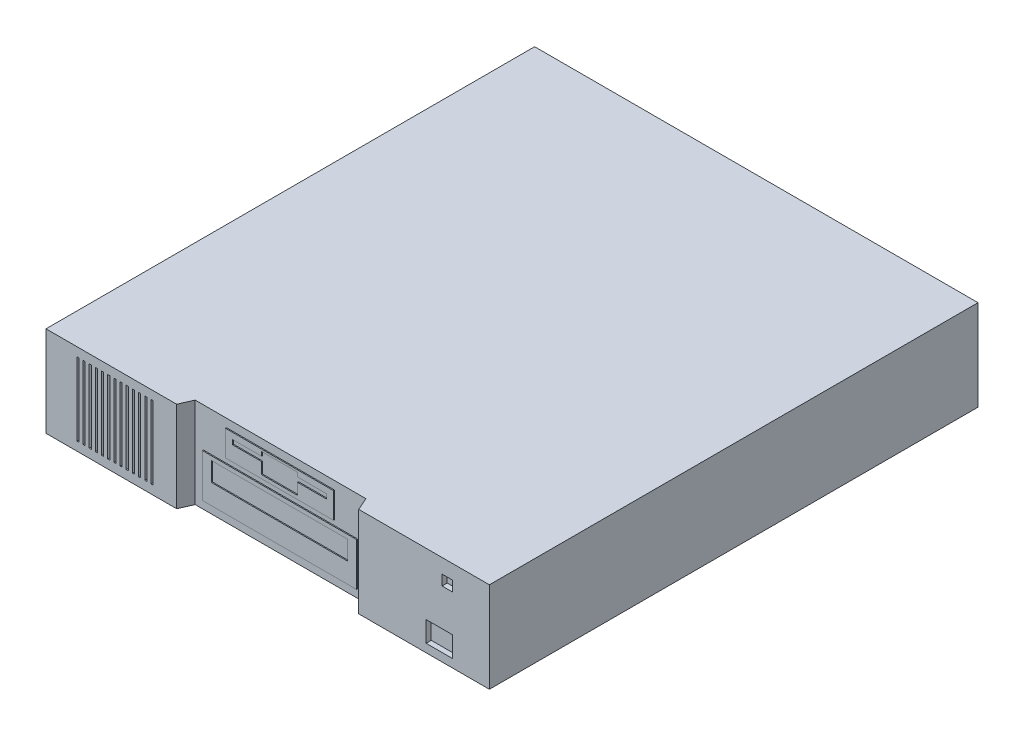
ISO-10303-21;
HEADER;
FILE_DESCRIPTION(('STEP AP214'),'2;1');
FILE_NAME('part.step','',(''),(''),'','','');
FILE_SCHEMA(('AUTOMOTIVE_DESIGN { 1 0 10303 214 1 1 1 1 }'));
ENDSEC;
DATA;
#1=APPLICATION_CONTEXT('core data for automotive mechanical design processes');
#2=APPLICATION_PROTOCOL_DEFINITION('international standard','automotive_design',2000,#1);
#3=PRODUCT_CONTEXT('',#1,'mechanical');
#4=PRODUCT('Part','Part','',(#3));
#5=PRODUCT_RELATED_PRODUCT_CATEGORY('part','',(#4));
#6=PRODUCT_DEFINITION_FORMATION('','',#4);
#7=PRODUCT_DEFINITION_CONTEXT('part definition',#1,'design');
#8=PRODUCT_DEFINITION('design','',#6,#7);
#9=PRODUCT_DEFINITION_SHAPE('','',#8);
#10=(LENGTH_UNIT() NAMED_UNIT(*) SI_UNIT(.MILLI.,.METRE.));
#11=(NAMED_UNIT(*) PLANE_ANGLE_UNIT() SI_UNIT($,.RADIAN.));
#12=(NAMED_UNIT(*) SI_UNIT($,.STERADIAN.) SOLID_ANGLE_UNIT());
#13=UNCERTAINTY_MEASURE_WITH_UNIT(LENGTH_MEASURE(1.E-05),#10,'distance_accuracy_value','');
#14=(GEOMETRIC_REPRESENTATION_CONTEXT(3) GLOBAL_UNCERTAINTY_ASSIGNED_CONTEXT((#13)) GLOBAL_UNIT_ASSIGNED_CONTEXT((#10,
#11,#12)) REPRESENTATION_CONTEXT('',''));
#15=CARTESIAN_POINT('',(0.,0.,0.));
#16=DIRECTION('',(0.,0.,1.));
#17=DIRECTION('',(1.,0.,0.));
#18=AXIS2_PLACEMENT_3D('',#15,#16,#17);
#19=CARTESIAN_POINT('',(-83.,44.,225.));
#20=DIRECTION('',(0.,0.,-1.));
#21=DIRECTION('',(-1.,0.,0.));
#22=AXIS2_PLACEMENT_3D('',#19,#20,#21);
#23=PLANE('',#22);
#24=DIRECTION('',(0.,-1.,0.));
#25=VECTOR('',#24,1.);
#26=CARTESIAN_POINT('',(-52.5,36.,225.));
#27=LINE('',#26,#25);
#28=CARTESIAN_POINT('',(-52.5,36.,225.));
#29=VERTEX_POINT('',#28);
#30=CARTESIAN_POINT('',(-52.5,11.,225.));
#31=VERTEX_POINT('',#30);
#32=EDGE_CURVE('E1244',#29,#31,#27,.T.);
#33=ORIENTED_EDGE('',*,*,#32,.F.);
#34=DIRECTION('',(-1.,0.,0.));
#35=VECTOR('',#34,1.);
#36=CARTESIAN_POINT('',(-52.5,36.,225.));
#37=LINE('',#36,#35);
#38=CARTESIAN_POINT('',(52.5,36.,225.));
#39=VERTEX_POINT('',#38);
#40=EDGE_CURVE('E1253',#39,#29,#37,.T.);
#41=ORIENTED_EDGE('',*,*,#40,.F.);
#42=DIRECTION('',(0.,1.,0.));
#43=VECTOR('',#42,1.);
#44=CARTESIAN_POINT('',(52.5,36.,225.));
#45=LINE('',#44,#43);
#46=CARTESIAN_POINT('',(52.5,11.,225.));
#47=VERTEX_POINT('',#46);
#48=EDGE_CURVE('E1250',#47,#39,#45,.T.);
#49=ORIENTED_EDGE('',*,*,#48,.F.);
#50=DIRECTION('',(1.,0.,0.));
#51=VECTOR('',#50,1.);
#52=CARTESIAN_POINT('',(-52.5,11.,225.));
#53=LINE('',#52,#51);
#54=EDGE_CURVE('E1247',#31,#47,#53,.T.);
#55=ORIENTED_EDGE('',*,*,#54,.F.);
#56=EDGE_LOOP('',(#33,#41,#49,#55));
#57=FACE_BOUND('',#56,.T.);
#58=DIRECTION('',(1.,0.,0.));
#59=VECTOR('',#58,1.);
#60=CARTESIAN_POINT('',(-83.,-44.,225.));
#61=LINE('',#60,#59);
#62=CARTESIAN_POINT('',(-83.,-44.,225.));
#63=VERTEX_POINT('',#62);
#64=CARTESIAN_POINT('',(83.,-44.,225.));
#65=VERTEX_POINT('',#64);
#66=EDGE_CURVE('E1284',#63,#65,#61,.T.);
#67=ORIENTED_EDGE('',*,*,#66,.T.);
#68=DIRECTION('',(0.,-1.,0.));
#69=VECTOR('',#68,1.);
#70=CARTESIAN_POINT('',(83.,44.,225.));
#71=LINE('',#70,#69);
#72=CARTESIAN_POINT('',(83.,44.,225.));
#73=VERTEX_POINT('',#72);
#74=EDGE_CURVE('E1323',#73,#65,#71,.T.);
#75=ORIENTED_EDGE('',*,*,#74,.F.);
#76=DIRECTION('',(1.,0.,0.));
#77=VECTOR('',#76,1.);
#78=CARTESIAN_POINT('',(-83.,44.,225.));
#79=LINE('',#78,#77);
#80=CARTESIAN_POINT('',(-83.,44.,225.));
#81=VERTEX_POINT('',#80);
#82=EDGE_CURVE('E1301',#81,#73,#79,.T.);
#83=ORIENTED_EDGE('',*,*,#82,.F.);
#84=DIRECTION('',(0.,-1.,0.));
#85=VECTOR('',#84,1.);
#86=CARTESIAN_POINT('',(-83.,44.,225.));
#87=LINE('',#86,#85);
#88=EDGE_CURVE('E1326',#81,#63,#87,.T.);
#89=ORIENTED_EDGE('',*,*,#88,.T.);
#90=EDGE_LOOP('',(#67,#75,#83,#89));
#91=FACE_BOUND('',#90,.T.);
#92=DIRECTION('',(0.,-1.,0.));
#93=VECTOR('',#92,1.);
#94=CARTESIAN_POINT('',(-74.9999999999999,5.99999999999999,225.));
#95=LINE('',#94,#93);
#96=CARTESIAN_POINT('',(-74.9999999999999,5.99999999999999,225.));
#97=VERTEX_POINT('',#96);
#98=CARTESIAN_POINT('',(-74.9999999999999,-36.,225.));
#99=VERTEX_POINT('',#98);
#100=EDGE_CURVE('E1211',#97,#99,#95,.T.);
#101=ORIENTED_EDGE('',*,*,#100,.F.);
#102=DIRECTION('',(-1.,0.,0.));
#103=VECTOR('',#102,1.);
#104=CARTESIAN_POINT('',(-74.9999999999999,5.99999999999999,225.));
#105=LINE('',#104,#103);
#106=CARTESIAN_POINT('',(75.,6.,225.));
#107=VERTEX_POINT('',#106);
#108=EDGE_CURVE('E1220',#107,#97,#105,.T.);
#109=ORIENTED_EDGE('',*,*,#108,.F.);
#110=DIRECTION('',(0.,1.,0.));
#111=VECTOR('',#110,1.);
#112=CARTESIAN_POINT('',(75.,6.00000000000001,225.));
#113=LINE('',#112,#111);
#114=CARTESIAN_POINT('',(75.0000000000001,-36.,225.));
#115=VERTEX_POINT('',#114);
#116=EDGE_CURVE('E1217',#115,#107,#113,.T.);
#117=ORIENTED_EDGE('',*,*,#116,.F.);
#118=DIRECTION('',(1.,0.,0.));
#119=VECTOR('',#118,1.);
#120=CARTESIAN_POINT('',(-74.9999999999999,-36.,225.));
#121=LINE('',#120,#119);
#122=EDGE_CURVE('E1214',#99,#115,#121,.T.);
#123=ORIENTED_EDGE('',*,*,#122,.F.);
#124=EDGE_LOOP('',(#101,#109,#117,#123));
#125=FACE_BOUND('',#124,.T.);
#126=ADVANCED_FACE('F28',(#57,#91,#125),#23,.F.);
#127=CARTESIAN_POINT('',(-215.5,44.,-237.5));
#128=DIRECTION('',(1.,0.,0.));
#129=DIRECTION('',(0.,0.,-1.));
#130=AXIS2_PLACEMENT_3D('',#127,#128,#129);
#131=PLANE('',#130);
#132=DIRECTION('',(0.,0.,1.));
#133=VECTOR('',#132,1.);
#134=CARTESIAN_POINT('',(-215.5,-44.,-237.5));
#135=LINE('',#134,#133);
#136=CARTESIAN_POINT('',(-215.5,-44.,-237.5));
#137=VERTEX_POINT('',#136);
#138=CARTESIAN_POINT('',(-215.5,-44.,237.5));
#139=VERTEX_POINT('',#138);
#140=EDGE_CURVE('E1277',#137,#139,#135,.T.);
#141=ORIENTED_EDGE('',*,*,#140,.T.);
#142=DIRECTION('',(0.,-1.,0.));
#143=VECTOR('',#142,1.);
#144=CARTESIAN_POINT('',(-215.5,44.,237.5));
#145=LINE('',#144,#143);
#146=CARTESIAN_POINT('',(-215.5,44.,237.5));
#147=VERTEX_POINT('',#146);
#148=EDGE_CURVE('E11',#147,#139,#145,.T.);
#149=ORIENTED_EDGE('',*,*,#148,.F.);
#150=DIRECTION('',(0.,0.,1.));
#151=VECTOR('',#150,1.);
#152=CARTESIAN_POINT('',(-215.5,44.,-237.5));
#153=LINE('',#152,#151);
#154=CARTESIAN_POINT('',(-215.5,44.,-237.5));
#155=VERTEX_POINT('',#154);
#156=EDGE_CURVE('E1294',#155,#147,#153,.T.);
#157=ORIENTED_EDGE('',*,*,#156,.F.);
#158=DIRECTION('',(0.,-1.,0.));
#159=VECTOR('',#158,1.);
#160=CARTESIAN_POINT('',(-215.5,44.,-237.5));
#161=LINE('',#160,#159);
#162=EDGE_CURVE('E1311',#155,#137,#161,.T.);
#163=ORIENTED_EDGE('',*,*,#162,.T.);
#164=EDGE_LOOP('',(#141,#149,#157,#163));
#165=FACE_BOUND('',#164,.T.);
#166=ADVANCED_FACE('F30',(#165),#131,.F.);
#167=CARTESIAN_POINT('',(-215.5,44.,237.5));
#168=DIRECTION('',(0.,0.,-1.));
#169=DIRECTION('',(-1.,0.,0.));
#170=AXIS2_PLACEMENT_3D('',#167,#168,#169);
#171=PLANE('',#170);
#172=DIRECTION('',(1.,0.,0.));
#173=VECTOR('',#172,1.);
#174=CARTESIAN_POINT('',(-185.5,-35.5,237.5));
#175=LINE('',#174,#173);
#176=CARTESIAN_POINT('',(-185.5,-35.5,237.5));
#177=VERTEX_POINT('',#176);
#178=CARTESIAN_POINT('',(-183.5,-35.5,237.5));
#179=VERTEX_POINT('',#178);
#180=EDGE_CURVE('E669',#177,#179,#175,.T.);
#181=ORIENTED_EDGE('',*,*,#180,.F.);
#182=DIRECTION('',(0.,-1.,0.));
#183=VECTOR('',#182,1.);
#184=CARTESIAN_POINT('',(-185.5,35.5,237.5));
#185=LINE('',#184,#183);
#186=CARTESIAN_POINT('',(-185.5,35.5,237.5));
#187=VERTEX_POINT('',#186);
#188=EDGE_CURVE('E662',#187,#177,#185,.T.);
#189=ORIENTED_EDGE('',*,*,#188,.F.);
#190=DIRECTION('',(-1.,0.,0.));
#191=VECTOR('',#190,1.);
#192=CARTESIAN_POINT('',(-185.5,35.5,237.5));
#193=LINE('',#192,#191);
#194=CARTESIAN_POINT('',(-183.5,35.5,237.5));
#195=VERTEX_POINT('',#194);
#196=EDGE_CURVE('E675',#195,#187,#193,.T.);
#197=ORIENTED_EDGE('',*,*,#196,.F.);
#198=DIRECTION('',(0.,1.,0.));
#199=VECTOR('',#198,1.);
#200=CARTESIAN_POINT('',(-183.5,35.5,237.5));
#201=LINE('',#200,#199);
#202=EDGE_CURVE('E672',#179,#195,#201,.T.);
#203=ORIENTED_EDGE('',*,*,#202,.F.);
#204=EDGE_LOOP('',(#181,#189,#197,#203));
#205=FACE_BOUND('',#204,.T.);
#206=DIRECTION('',(1.,0.,0.));
#207=VECTOR('',#206,1.);
#208=CARTESIAN_POINT('',(-179.5,-35.5,237.5));
#209=LINE('',#208,#207);
#210=CARTESIAN_POINT('',(-179.5,-35.5,237.5));
#211=VERTEX_POINT('',#210);
#212=CARTESIAN_POINT('',(-177.5,-35.5,237.5));
#213=VERTEX_POINT('',#212);
#214=EDGE_CURVE('E701',#211,#213,#209,.T.);
#215=ORIENTED_EDGE('',*,*,#214,.F.);
#216=DIRECTION('',(0.,-1.,0.));
#217=VECTOR('',#216,1.);
#218=CARTESIAN_POINT('',(-179.5,35.5,237.5));
#219=LINE('',#218,#217);
#220=CARTESIAN_POINT('',(-179.5,35.5,237.5));
#221=VERTEX_POINT('',#220);
#222=EDGE_CURVE('E693',#221,#211,#219,.T.);
#223=ORIENTED_EDGE('',*,*,#222,.F.);
#224=DIRECTION('',(-1.,0.,0.));
#225=VECTOR('',#224,1.);
#226=CARTESIAN_POINT('',(-179.5,35.5,237.5));
#227=LINE('',#226,#225);
#228=CARTESIAN_POINT('',(-177.5,35.5,237.5));
#229=VERTEX_POINT('',#228);
#230=EDGE_CURVE('E707',#229,#221,#227,.T.);
#231=ORIENTED_EDGE('',*,*,#230,.F.);
#232=DIRECTION('',(0.,1.,0.));
#233=VECTOR('',#232,1.);
#234=CARTESIAN_POINT('',(-177.5,35.5,237.5));
#235=LINE('',#234,#233);
#236=EDGE_CURVE('E704',#213,#229,#235,.T.);
#237=ORIENTED_EDGE('',*,*,#236,.F.);
#238=EDGE_LOOP('',(#215,#223,#231,#237));
#239=FACE_BOUND('',#238,.T.);
#240=DIRECTION('',(1.,0.,0.));
#241=VECTOR('',#240,1.);
#242=CARTESIAN_POINT('',(-173.5,-35.5,237.5));
#243=LINE('',#242,#241);
#244=CARTESIAN_POINT('',(-173.5,-35.5,237.5));
#245=VERTEX_POINT('',#244);
#246=CARTESIAN_POINT('',(-171.5,-35.5,237.5));
#247=VERTEX_POINT('',#246);
#248=EDGE_CURVE('E733',#245,#247,#243,.T.);
#249=ORIENTED_EDGE('',*,*,#248,.F.);
#250=DIRECTION('',(0.,-1.,0.));
#251=VECTOR('',#250,1.);
#252=CARTESIAN_POINT('',(-173.5,35.5,237.5));
#253=LINE('',#252,#251);
#254=CARTESIAN_POINT('',(-173.5,35.5,237.5));
#255=VERTEX_POINT('',#254);
#256=EDGE_CURVE('E725',#255,#245,#253,.T.);
#257=ORIENTED_EDGE('',*,*,#256,.F.);
#258=DIRECTION('',(-1.,0.,0.));
#259=VECTOR('',#258,1.);
#260=CARTESIAN_POINT('',(-173.5,35.5,237.5));
#261=LINE('',#260,#259);
#262=CARTESIAN_POINT('',(-171.5,35.5,237.5));
#263=VERTEX_POINT('',#262);
#264=EDGE_CURVE('E739',#263,#255,#261,.T.);
#265=ORIENTED_EDGE('',*,*,#264,.F.);
#266=DIRECTION('',(0.,1.,0.));
#267=VECTOR('',#266,1.);
#268=CARTESIAN_POINT('',(-171.5,35.5,237.5));
#269=LINE('',#268,#267);
#270=EDGE_CURVE('E736',#247,#263,#269,.T.);
#271=ORIENTED_EDGE('',*,*,#270,.F.);
#272=EDGE_LOOP('',(#249,#257,#265,#271));
#273=FACE_BOUND('',#272,.T.);
#274=DIRECTION('',(1.,0.,0.));
#275=VECTOR('',#274,1.);
#276=CARTESIAN_POINT('',(-167.5,-35.5,237.5));
#277=LINE('',#276,#275);
#278=CARTESIAN_POINT('',(-167.5,-35.5,237.5));
#279=VERTEX_POINT('',#278);
#280=CARTESIAN_POINT('',(-165.5,-35.5,237.5));
#281=VERTEX_POINT('',#280);
#282=EDGE_CURVE('E765',#279,#281,#277,.T.);
#283=ORIENTED_EDGE('',*,*,#282,.F.);
#284=DIRECTION('',(0.,-1.,0.));
#285=VECTOR('',#284,1.);
#286=CARTESIAN_POINT('',(-167.5,35.5,237.5));
#287=LINE('',#286,#285);
#288=CARTESIAN_POINT('',(-167.5,35.5,237.5));
#289=VERTEX_POINT('',#288);
#290=EDGE_CURVE('E757',#289,#279,#287,.T.);
#291=ORIENTED_EDGE('',*,*,#290,.F.);
#292=DIRECTION('',(-1.,0.,0.));
#293=VECTOR('',#292,1.);
#294=CARTESIAN_POINT('',(-167.5,35.5,237.5));
#295=LINE('',#294,#293);
#296=CARTESIAN_POINT('',(-165.5,35.5,237.5));
#297=VERTEX_POINT('',#296);
#298=EDGE_CURVE('E771',#297,#289,#295,.T.);
#299=ORIENTED_EDGE('',*,*,#298,.F.);
#300=DIRECTION('',(0.,1.,0.));
#301=VECTOR('',#300,1.);
#302=CARTESIAN_POINT('',(-165.5,35.5,237.5));
#303=LINE('',#302,#301);
#304=EDGE_CURVE('E768',#281,#297,#303,.T.);
#305=ORIENTED_EDGE('',*,*,#304,.F.);
#306=EDGE_LOOP('',(#283,#291,#299,#305));
#307=FACE_BOUND('',#306,.T.);
#308=DIRECTION('',(1.,0.,0.));
#309=VECTOR('',#308,1.);
#310=CARTESIAN_POINT('',(-161.5,-35.5,237.5));
#311=LINE('',#310,#309);
#312=CARTESIAN_POINT('',(-161.5,-35.5,237.5));
#313=VERTEX_POINT('',#312);
#314=CARTESIAN_POINT('',(-159.5,-35.5,237.5));
#315=VERTEX_POINT('',#314);
#316=EDGE_CURVE('E797',#313,#315,#311,.T.);
#317=ORIENTED_EDGE('',*,*,#316,.F.);
#318=DIRECTION('',(0.,-1.,0.));
#319=VECTOR('',#318,1.);
#320=CARTESIAN_POINT('',(-161.5,35.5,237.5));
#321=LINE('',#320,#319);
#322=CARTESIAN_POINT('',(-161.5,35.5,237.5));
#323=VERTEX_POINT('',#322);
#324=EDGE_CURVE('E789',#323,#313,#321,.T.);
#325=ORIENTED_EDGE('',*,*,#324,.F.);
#326=DIRECTION('',(-1.,0.,0.));
#327=VECTOR('',#326,1.);
#328=CARTESIAN_POINT('',(-161.5,35.5,237.5));
#329=LINE('',#328,#327);
#330=CARTESIAN_POINT('',(-159.5,35.5,237.5));
#331=VERTEX_POINT('',#330);
#332=EDGE_CURVE('E803',#331,#323,#329,.T.);
#333=ORIENTED_EDGE('',*,*,#332,.F.);
#334=DIRECTION('',(0.,1.,0.));
#335=VECTOR('',#334,1.);
#336=CARTESIAN_POINT('',(-159.5,35.5,237.5));
#337=LINE('',#336,#335);
#338=EDGE_CURVE('E800',#315,#331,#337,.T.);
#339=ORIENTED_EDGE('',*,*,#338,.F.);
#340=EDGE_LOOP('',(#317,#325,#333,#339));
#341=FACE_BOUND('',#340,.T.);
#342=DIRECTION('',(1.,0.,0.));
#343=VECTOR('',#342,1.);
#344=CARTESIAN_POINT('',(-155.5,-35.5,237.5));
#345=LINE('',#344,#343);
#346=CARTESIAN_POINT('',(-155.5,-35.5,237.5));
#347=VERTEX_POINT('',#346);
#348=CARTESIAN_POINT('',(-153.5,-35.5,237.5));
#349=VERTEX_POINT('',#348);
#350=EDGE_CURVE('E829',#347,#349,#345,.T.);
#351=ORIENTED_EDGE('',*,*,#350,.F.);
#352=DIRECTION('',(0.,-1.,0.));
#353=VECTOR('',#352,1.);
#354=CARTESIAN_POINT('',(-155.5,35.5,237.5));
#355=LINE('',#354,#353);
#356=CARTESIAN_POINT('',(-155.5,35.5,237.5));
#357=VERTEX_POINT('',#356);
#358=EDGE_CURVE('E821',#357,#347,#355,.T.);
#359=ORIENTED_EDGE('',*,*,#358,.F.);
#360=DIRECTION('',(-1.,0.,0.));
#361=VECTOR('',#360,1.);
#362=CARTESIAN_POINT('',(-155.5,35.5,237.5));
#363=LINE('',#362,#361);
#364=CARTESIAN_POINT('',(-153.5,35.5,237.5));
#365=VERTEX_POINT('',#364);
#366=EDGE_CURVE('E835',#365,#357,#363,.T.);
#367=ORIENTED_EDGE('',*,*,#366,.F.);
#368=DIRECTION('',(0.,1.,0.));
#369=VECTOR('',#368,1.);
#370=CARTESIAN_POINT('',(-153.5,35.5,237.5));
#371=LINE('',#370,#369);
#372=EDGE_CURVE('E832',#349,#365,#371,.T.);
#373=ORIENTED_EDGE('',*,*,#372,.F.);
#374=EDGE_LOOP('',(#351,#359,#367,#373));
#375=FACE_BOUND('',#374,.T.);
#376=DIRECTION('',(1.,0.,0.));
#377=VECTOR('',#376,1.);
#378=CARTESIAN_POINT('',(-149.5,-35.5,237.5));
#379=LINE('',#378,#377);
#380=CARTESIAN_POINT('',(-149.5,-35.5,237.5));
#381=VERTEX_POINT('',#380);
#382=CARTESIAN_POINT('',(-147.5,-35.5,237.5));
#383=VERTEX_POINT('',#382);
#384=EDGE_CURVE('E861',#381,#383,#379,.T.);
#385=ORIENTED_EDGE('',*,*,#384,.F.);
#386=DIRECTION('',(0.,-1.,0.));
#387=VECTOR('',#386,1.);
#388=CARTESIAN_POINT('',(-149.5,35.5,237.5));
#389=LINE('',#388,#387);
#390=CARTESIAN_POINT('',(-149.5,35.5,237.5));
#391=VERTEX_POINT('',#390);
#392=EDGE_CURVE('E853',#391,#381,#389,.T.);
#393=ORIENTED_EDGE('',*,*,#392,.F.);
#394=DIRECTION('',(-1.,0.,0.));
#395=VECTOR('',#394,1.);
#396=CARTESIAN_POINT('',(-149.5,35.5,237.5));
#397=LINE('',#396,#395);
#398=CARTESIAN_POINT('',(-147.5,35.5,237.5));
#399=VERTEX_POINT('',#398);
#400=EDGE_CURVE('E867',#399,#391,#397,.T.);
#401=ORIENTED_EDGE('',*,*,#400,.F.);
#402=DIRECTION('',(0.,1.,0.));
#403=VECTOR('',#402,1.);
#404=CARTESIAN_POINT('',(-147.5,35.5,237.5));
#405=LINE('',#404,#403);
#406=EDGE_CURVE('E864',#383,#399,#405,.T.);
#407=ORIENTED_EDGE('',*,*,#406,.F.);
#408=EDGE_LOOP('',(#385,#393,#401,#407));
#409=FACE_BOUND('',#408,.T.);
#410=DIRECTION('',(1.,0.,0.));
#411=VECTOR('',#410,1.);
#412=CARTESIAN_POINT('',(-143.5,-35.5,237.5));
#413=LINE('',#412,#411);
#414=CARTESIAN_POINT('',(-143.5,-35.5,237.5));
#415=VERTEX_POINT('',#414);
#416=CARTESIAN_POINT('',(-141.5,-35.5,237.5));
#417=VERTEX_POINT('',#416);
#418=EDGE_CURVE('E893',#415,#417,#413,.T.);
#419=ORIENTED_EDGE('',*,*,#418,.F.);
#420=DIRECTION('',(0.,-1.,0.));
#421=VECTOR('',#420,1.);
#422=CARTESIAN_POINT('',(-143.5,35.5,237.5));
#423=LINE('',#422,#421);
#424=CARTESIAN_POINT('',(-143.5,35.5,237.5));
#425=VERTEX_POINT('',#424);
#426=EDGE_CURVE('E885',#425,#415,#423,.T.);
#427=ORIENTED_EDGE('',*,*,#426,.F.);
#428=DIRECTION('',(-1.,0.,0.));
#429=VECTOR('',#428,1.);
#430=CARTESIAN_POINT('',(-143.5,35.5,237.5));
#431=LINE('',#430,#429);
#432=CARTESIAN_POINT('',(-141.5,35.5,237.5));
#433=VERTEX_POINT('',#432);
#434=EDGE_CURVE('E899',#433,#425,#431,.T.);
#435=ORIENTED_EDGE('',*,*,#434,.F.);
#436=DIRECTION('',(0.,1.,0.));
#437=VECTOR('',#436,1.);
#438=CARTESIAN_POINT('',(-141.5,35.5,237.5));
#439=LINE('',#438,#437);
#440=EDGE_CURVE('E896',#417,#433,#439,.T.);
#441=ORIENTED_EDGE('',*,*,#440,.F.);
#442=EDGE_LOOP('',(#419,#427,#435,#441));
#443=FACE_BOUND('',#442,.T.);
#444=DIRECTION('',(1.,0.,0.));
#445=VECTOR('',#444,1.);
#446=CARTESIAN_POINT('',(-137.5,-35.5,237.5));
#447=LINE('',#446,#445);
#448=CARTESIAN_POINT('',(-137.5,-35.5,237.5));
#449=VERTEX_POINT('',#448);
#450=CARTESIAN_POINT('',(-135.5,-35.5,237.5));
#451=VERTEX_POINT('',#450);
#452=EDGE_CURVE('E925',#449,#451,#447,.T.);
#453=ORIENTED_EDGE('',*,*,#452,.F.);
#454=DIRECTION('',(0.,-1.,0.));
#455=VECTOR('',#454,1.);
#456=CARTESIAN_POINT('',(-137.5,35.5,237.5));
#457=LINE('',#456,#455);
#458=CARTESIAN_POINT('',(-137.5,35.5,237.5));
#459=VERTEX_POINT('',#458);
#460=EDGE_CURVE('E917',#459,#449,#457,.T.);
#461=ORIENTED_EDGE('',*,*,#460,.F.);
#462=DIRECTION('',(-1.,0.,0.));
#463=VECTOR('',#462,1.);
#464=CARTESIAN_POINT('',(-137.5,35.5,237.5));
#465=LINE('',#464,#463);
#466=CARTESIAN_POINT('',(-135.5,35.5,237.5));
#467=VERTEX_POINT('',#466);
#468=EDGE_CURVE('E931',#467,#459,#465,.T.);
#469=ORIENTED_EDGE('',*,*,#468,.F.);
#470=DIRECTION('',(0.,1.,0.));
#471=VECTOR('',#470,1.);
#472=CARTESIAN_POINT('',(-135.5,35.5,237.5));
#473=LINE('',#472,#471);
#474=EDGE_CURVE('E928',#451,#467,#473,.T.);
#475=ORIENTED_EDGE('',*,*,#474,.F.);
#476=EDGE_LOOP('',(#453,#461,#469,#475));
#477=FACE_BOUND('',#476,.T.);
#478=DIRECTION('',(1.,0.,0.));
#479=VECTOR('',#478,1.);
#480=CARTESIAN_POINT('',(-131.5,-35.5,237.5));
#481=LINE('',#480,#479);
#482=CARTESIAN_POINT('',(-131.5,-35.5,237.5));
#483=VERTEX_POINT('',#482);
#484=CARTESIAN_POINT('',(-129.5,-35.5,237.5));
#485=VERTEX_POINT('',#484);
#486=EDGE_CURVE('E957',#483,#485,#481,.T.);
#487=ORIENTED_EDGE('',*,*,#486,.F.);
#488=DIRECTION('',(0.,-1.,0.));
#489=VECTOR('',#488,1.);
#490=CARTESIAN_POINT('',(-131.5,35.5,237.5));
#491=LINE('',#490,#489);
#492=CARTESIAN_POINT('',(-131.5,35.5,237.5));
#493=VERTEX_POINT('',#492);
#494=EDGE_CURVE('E949',#493,#483,#491,.T.);
#495=ORIENTED_EDGE('',*,*,#494,.F.);
#496=DIRECTION('',(-1.,0.,0.));
#497=VECTOR('',#496,1.);
#498=CARTESIAN_POINT('',(-131.5,35.5,237.5));
#499=LINE('',#498,#497);
#500=CARTESIAN_POINT('',(-129.5,35.5,237.5));
#501=VERTEX_POINT('',#500);
#502=EDGE_CURVE('E963',#501,#493,#499,.T.);
#503=ORIENTED_EDGE('',*,*,#502,.F.);
#504=DIRECTION('',(0.,1.,0.));
#505=VECTOR('',#504,1.);
#506=CARTESIAN_POINT('',(-129.5,35.5,237.5));
#507=LINE('',#506,#505);
#508=EDGE_CURVE('E960',#485,#501,#507,.T.);
#509=ORIENTED_EDGE('',*,*,#508,.F.);
#510=EDGE_LOOP('',(#487,#495,#503,#509));
#511=FACE_BOUND('',#510,.T.);
#512=DIRECTION('',(1.,0.,0.));
#513=VECTOR('',#512,1.);
#514=CARTESIAN_POINT('',(-125.5,-35.5,237.5));
#515=LINE('',#514,#513);
#516=CARTESIAN_POINT('',(-125.5,-35.5,237.5));
#517=VERTEX_POINT('',#516);
#518=CARTESIAN_POINT('',(-123.5,-35.5,237.5));
#519=VERTEX_POINT('',#518);
#520=EDGE_CURVE('E989',#517,#519,#515,.T.);
#521=ORIENTED_EDGE('',*,*,#520,.F.);
#522=DIRECTION('',(0.,-1.,0.));
#523=VECTOR('',#522,1.);
#524=CARTESIAN_POINT('',(-125.5,35.5,237.5));
#525=LINE('',#524,#523);
#526=CARTESIAN_POINT('',(-125.5,35.5,237.5));
#527=VERTEX_POINT('',#526);
#528=EDGE_CURVE('E981',#527,#517,#525,.T.);
#529=ORIENTED_EDGE('',*,*,#528,.F.);
#530=DIRECTION('',(-1.,0.,0.));
#531=VECTOR('',#530,1.);
#532=CARTESIAN_POINT('',(-125.5,35.5,237.5));
#533=LINE('',#532,#531);
#534=CARTESIAN_POINT('',(-123.5,35.5,237.5));
#535=VERTEX_POINT('',#534);
#536=EDGE_CURVE('E995',#535,#527,#533,.T.);
#537=ORIENTED_EDGE('',*,*,#536,.F.);
#538=DIRECTION('',(0.,1.,0.));
#539=VECTOR('',#538,1.);
#540=CARTESIAN_POINT('',(-123.5,35.5,237.5));
#541=LINE('',#540,#539);
#542=EDGE_CURVE('E992',#519,#535,#541,.T.);
#543=ORIENTED_EDGE('',*,*,#542,.F.);
#544=EDGE_LOOP('',(#521,#529,#537,#543));
#545=FACE_BOUND('',#544,.T.);
#546=DIRECTION('',(1.,0.,0.));
#547=VECTOR('',#546,1.);
#548=CARTESIAN_POINT('',(-119.5,-35.5,237.5));
#549=LINE('',#548,#547);
#550=CARTESIAN_POINT('',(-119.5,-35.5,237.5));
#551=VERTEX_POINT('',#550);
#552=CARTESIAN_POINT('',(-117.5,-35.5,237.5));
#553=VERTEX_POINT('',#552);
#554=EDGE_CURVE('E1021',#551,#553,#549,.T.);
#555=ORIENTED_EDGE('',*,*,#554,.F.);
#556=DIRECTION('',(0.,-1.,0.));
#557=VECTOR('',#556,1.);
#558=CARTESIAN_POINT('',(-119.5,35.5,237.5));
#559=LINE('',#558,#557);
#560=CARTESIAN_POINT('',(-119.5,35.5,237.5));
#561=VERTEX_POINT('',#560);
#562=EDGE_CURVE('E1013',#561,#551,#559,.T.);
#563=ORIENTED_EDGE('',*,*,#562,.F.);
#564=DIRECTION('',(-1.,0.,0.));
#565=VECTOR('',#564,1.);
#566=CARTESIAN_POINT('',(-119.5,35.5,237.5));
#567=LINE('',#566,#565);
#568=CARTESIAN_POINT('',(-117.5,35.5,237.5));
#569=VERTEX_POINT('',#568);
#570=EDGE_CURVE('E1027',#569,#561,#567,.T.);
#571=ORIENTED_EDGE('',*,*,#570,.F.);
#572=DIRECTION('',(0.,1.,0.));
#573=VECTOR('',#572,1.);
#574=CARTESIAN_POINT('',(-117.5,35.5,237.5));
#575=LINE('',#574,#573);
#576=EDGE_CURVE('E1024',#553,#569,#575,.T.);
#577=ORIENTED_EDGE('',*,*,#576,.F.);
#578=EDGE_LOOP('',(#555,#563,#571,#577));
#579=FACE_BOUND('',#578,.T.);
#580=DIRECTION('',(1.,0.,0.));
#581=VECTOR('',#580,1.);
#582=CARTESIAN_POINT('',(-113.5,-35.5,237.5));
#583=LINE('',#582,#581);
#584=CARTESIAN_POINT('',(-113.5,-35.5,237.5));
#585=VERTEX_POINT('',#584);
#586=CARTESIAN_POINT('',(-111.5,-35.5,237.5));
#587=VERTEX_POINT('',#586);
#588=EDGE_CURVE('E1053',#585,#587,#583,.T.);
#589=ORIENTED_EDGE('',*,*,#588,.F.);
#590=DIRECTION('',(0.,-1.,0.));
#591=VECTOR('',#590,1.);
#592=CARTESIAN_POINT('',(-113.5,35.5,237.5));
#593=LINE('',#592,#591);
#594=CARTESIAN_POINT('',(-113.5,35.5,237.5));
#595=VERTEX_POINT('',#594);
#596=EDGE_CURVE('E1045',#595,#585,#593,.T.);
#597=ORIENTED_EDGE('',*,*,#596,.F.);
#598=DIRECTION('',(-1.,0.,0.));
#599=VECTOR('',#598,1.);
#600=CARTESIAN_POINT('',(-113.5,35.5,237.5));
#601=LINE('',#600,#599);
#602=CARTESIAN_POINT('',(-111.5,35.5,237.5));
#603=VERTEX_POINT('',#602);
#604=EDGE_CURVE('E1059',#603,#595,#601,.T.);
#605=ORIENTED_EDGE('',*,*,#604,.F.);
#606=DIRECTION('',(0.,1.,0.));
#607=VECTOR('',#606,1.);
#608=CARTESIAN_POINT('',(-111.5,35.5,237.5));
#609=LINE('',#608,#607);
#610=EDGE_CURVE('E1056',#587,#603,#609,.T.);
#611=ORIENTED_EDGE('',*,*,#610,.F.);
#612=EDGE_LOOP('',(#589,#597,#605,#611));
#613=FACE_BOUND('',#612,.T.);
#614=DIRECTION('',(1.,0.,0.));
#615=VECTOR('',#614,1.);
#616=CARTESIAN_POINT('',(-215.5,-44.,237.5));
#617=LINE('',#616,#615);
#618=CARTESIAN_POINT('',(-88.5,-44.,237.5));
#619=VERTEX_POINT('',#618);
#620=EDGE_CURVE('E1280',#139,#619,#617,.T.);
#621=ORIENTED_EDGE('',*,*,#620,.T.);
#622=DIRECTION('',(0.,-1.,0.));
#623=VECTOR('',#622,1.);
#624=CARTESIAN_POINT('',(-88.5,44.,237.5));
#625=LINE('',#624,#623);
#626=CARTESIAN_POINT('',(-88.5,44.,237.5));
#627=VERTEX_POINT('',#626);
#628=EDGE_CURVE('E36',#627,#619,#625,.T.);
#629=ORIENTED_EDGE('',*,*,#628,.F.);
#630=DIRECTION('',(1.,0.,0.));
#631=VECTOR('',#630,1.);
#632=CARTESIAN_POINT('',(-215.5,44.,237.5));
#633=LINE('',#632,#631);
#634=EDGE_CURVE('E1297',#147,#627,#633,.T.);
#635=ORIENTED_EDGE('',*,*,#634,.F.);
#636=ORIENTED_EDGE('',*,*,#148,.T.);
#637=EDGE_LOOP('',(#621,#629,#635,#636));
#638=FACE_BOUND('',#637,.T.);
#639=ADVANCED_FACE('F1356',(#205,#239,#273,#307,#341,#375,#409,#443,#477,#511,#545,#579,#613,
#638),#171,.F.);
#640=CARTESIAN_POINT('',(-88.5,44.,237.5));
#641=DIRECTION('',(-0.915315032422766,0.,-0.402738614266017));
#642=DIRECTION('',(-0.402738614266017,0.,0.915315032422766));
#643=AXIS2_PLACEMENT_3D('',#640,#641,#642);
#644=PLANE('',#643);
#645=DIRECTION('',(0.402738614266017,0.,-0.915315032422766));
#646=VECTOR('',#645,1.);
#647=CARTESIAN_POINT('',(-88.5,-44.,237.5));
#648=LINE('',#647,#646);
#649=EDGE_CURVE('E1282',#619,#63,#648,.T.);
#650=ORIENTED_EDGE('',*,*,#649,.T.);
#651=ORIENTED_EDGE('',*,*,#88,.F.);
#652=DIRECTION('',(0.402738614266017,0.,-0.915315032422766));
#653=VECTOR('',#652,1.);
#654=CARTESIAN_POINT('',(-88.5,44.,237.5));
#655=LINE('',#654,#653);
#656=EDGE_CURVE('E1299',#627,#81,#655,.T.);
#657=ORIENTED_EDGE('',*,*,#656,.F.);
#658=ORIENTED_EDGE('',*,*,#628,.T.);
#659=EDGE_LOOP('',(#650,#651,#657,#658));
#660=FACE_BOUND('',#659,.T.);
#661=ADVANCED_FACE('F1333',(#660),#644,.F.);
#662=CARTESIAN_POINT('',(88.5,44.,237.5));
#663=DIRECTION('',(0.915315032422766,0.,-0.402738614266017));
#664=DIRECTION('',(-0.402738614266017,0.,-0.915315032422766));
#665=AXIS2_PLACEMENT_3D('',#662,#663,#664);
#666=PLANE('',#665);
#667=DIRECTION('',(0.402738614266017,0.,0.915315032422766));
#668=VECTOR('',#667,1.);
#669=CARTESIAN_POINT('',(88.5,-44.,237.5));
#670=LINE('',#669,#668);
#671=CARTESIAN_POINT('',(88.5,-44.,237.5));
#672=VERTEX_POINT('',#671);
#673=EDGE_CURVE('E1286',#65,#672,#670,.T.);
#674=ORIENTED_EDGE('',*,*,#673,.T.);
#675=DIRECTION('',(0.,-1.,0.));
#676=VECTOR('',#675,1.);
#677=CARTESIAN_POINT('',(88.5,44.,237.5));
#678=LINE('',#677,#676);
#679=CARTESIAN_POINT('',(88.5,44.,237.5));
#680=VERTEX_POINT('',#679);
#681=EDGE_CURVE('E1320',#680,#672,#678,.T.);
#682=ORIENTED_EDGE('',*,*,#681,.F.);
#683=DIRECTION('',(0.402738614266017,0.,0.915315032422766));
#684=VECTOR('',#683,1.);
#685=CARTESIAN_POINT('',(88.5,44.,237.5));
#686=LINE('',#685,#684);
#687=EDGE_CURVE('E1303',#73,#680,#686,.T.);
#688=ORIENTED_EDGE('',*,*,#687,.F.);
#689=ORIENTED_EDGE('',*,*,#74,.T.);
#690=EDGE_LOOP('',(#674,#682,#688,#689));
#691=FACE_BOUND('',#690,.T.);
#692=ADVANCED_FACE('F1348',(#691),#666,.F.);
#693=CARTESIAN_POINT('',(88.5,44.,237.5));
#694=DIRECTION('',(0.,0.,-1.));
#695=DIRECTION('',(-1.,0.,0.));
#696=AXIS2_PLACEMENT_3D('',#693,#694,#695);
#697=PLANE('',#696);
#698=DIRECTION('',(1.,0.,0.));
#699=VECTOR('',#698,1.);
#700=CARTESIAN_POINT('',(154.,-36.,237.5));
#701=LINE('',#700,#699);
#702=CARTESIAN_POINT('',(154.,-36.,237.5));
#703=VERTEX_POINT('',#702);
#704=CARTESIAN_POINT('',(179.5,-36.,237.5));
#705=VERTEX_POINT('',#704);
#706=EDGE_CURVE('E612',#703,#705,#701,.T.);
#707=ORIENTED_EDGE('',*,*,#706,.F.);
#708=DIRECTION('',(0.,-1.,0.));
#709=VECTOR('',#708,1.);
#710=CARTESIAN_POINT('',(154.,-16.,237.5));
#711=LINE('',#710,#709);
#712=CARTESIAN_POINT('',(154.,-16.,237.5));
#713=VERTEX_POINT('',#712);
#714=EDGE_CURVE('E43',#713,#703,#711,.T.);
#715=ORIENTED_EDGE('',*,*,#714,.F.);
#716=DIRECTION('',(-1.,0.,0.));
#717=VECTOR('',#716,1.);
#718=CARTESIAN_POINT('',(154.,-16.,237.5));
#719=LINE('',#718,#717);
#720=CARTESIAN_POINT('',(179.5,-16.,237.5));
#721=VERTEX_POINT('',#720);
#722=EDGE_CURVE('E619',#721,#713,#719,.T.);
#723=ORIENTED_EDGE('',*,*,#722,.F.);
#724=DIRECTION('',(0.,1.,0.));
#725=VECTOR('',#724,1.);
#726=CARTESIAN_POINT('',(179.5,-16.,237.5));
#727=LINE('',#726,#725);
#728=EDGE_CURVE('E601',#705,#721,#727,.T.);
#729=ORIENTED_EDGE('',*,*,#728,.F.);
#730=EDGE_LOOP('',(#707,#715,#723,#729));
#731=FACE_BOUND('',#730,.T.);
#732=DIRECTION('',(1.,0.,0.));
#733=VECTOR('',#732,1.);
#734=CARTESIAN_POINT('',(169.5,20.,237.5));
#735=LINE('',#734,#733);
#736=CARTESIAN_POINT('',(169.5,20.,237.5));
#737=VERTEX_POINT('',#736);
#738=CARTESIAN_POINT('',(179.5,20.,237.5));
#739=VERTEX_POINT('',#738);
#740=EDGE_CURVE('E638',#737,#739,#735,.T.);
#741=ORIENTED_EDGE('',*,*,#740,.F.);
#742=DIRECTION('',(0.,-1.,0.));
#743=VECTOR('',#742,1.);
#744=CARTESIAN_POINT('',(169.5,30.,237.5));
#745=LINE('',#744,#743);
#746=CARTESIAN_POINT('',(169.5,30.,237.5));
#747=VERTEX_POINT('',#746);
#748=EDGE_CURVE('E51',#747,#737,#745,.T.);
#749=ORIENTED_EDGE('',*,*,#748,.F.);
#750=DIRECTION('',(-1.,0.,0.));
#751=VECTOR('',#750,1.);
#752=CARTESIAN_POINT('',(169.5,30.,237.5));
#753=LINE('',#752,#751);
#754=CARTESIAN_POINT('',(179.5,30.,237.5));
#755=VERTEX_POINT('',#754);
#756=EDGE_CURVE('E644',#755,#747,#753,.T.);
#757=ORIENTED_EDGE('',*,*,#756,.F.);
#758=DIRECTION('',(0.,1.,0.));
#759=VECTOR('',#758,1.);
#760=CARTESIAN_POINT('',(179.5,30.,237.5));
#761=LINE('',#760,#759);
#762=EDGE_CURVE('E641',#739,#755,#761,.T.);
#763=ORIENTED_EDGE('',*,*,#762,.F.);
#764=EDGE_LOOP('',(#741,#749,#757,#763));
#765=FACE_BOUND('',#764,.T.);
#766=DIRECTION('',(1.,0.,0.));
#767=VECTOR('',#766,1.);
#768=CARTESIAN_POINT('',(88.5,-44.,237.5));
#769=LINE('',#768,#767);
#770=CARTESIAN_POINT('',(215.5,-44.,237.5));
#771=VERTEX_POINT('',#770);
#772=EDGE_CURVE('E1288',#672,#771,#769,.T.);
#773=ORIENTED_EDGE('',*,*,#772,.T.);
#774=DIRECTION('',(0.,-1.,0.));
#775=VECTOR('',#774,1.);
#776=CARTESIAN_POINT('',(215.5,44.,237.5));
#777=LINE('',#776,#775);
#778=CARTESIAN_POINT('',(215.5,44.,237.5));
#779=VERTEX_POINT('',#778);
#780=EDGE_CURVE('E1317',#779,#771,#777,.T.);
#781=ORIENTED_EDGE('',*,*,#780,.F.);
#782=DIRECTION('',(1.,0.,0.));
#783=VECTOR('',#782,1.);
#784=CARTESIAN_POINT('',(88.5,44.,237.5));
#785=LINE('',#784,#783);
#786=EDGE_CURVE('E1305',#680,#779,#785,.T.);
#787=ORIENTED_EDGE('',*,*,#786,.F.);
#788=ORIENTED_EDGE('',*,*,#681,.T.);
#789=EDGE_LOOP('',(#773,#781,#787,#788));
#790=FACE_BOUND('',#789,.T.);
#791=ADVANCED_FACE('F616',(#731,#765,#790),#697,.F.);
#792=CARTESIAN_POINT('',(215.5,44.,-237.5));
#793=DIRECTION('',(-1.,0.,0.));
#794=DIRECTION('',(0.,0.,1.));
#795=AXIS2_PLACEMENT_3D('',#792,#793,#794);
#796=PLANE('',#795);
#797=DIRECTION('',(0.,0.,-1.));
#798=VECTOR('',#797,1.);
#799=CARTESIAN_POINT('',(215.5,-44.,-237.5));
#800=LINE('',#799,#798);
#801=CARTESIAN_POINT('',(215.5,-44.,-237.5));
#802=VERTEX_POINT('',#801);
#803=EDGE_CURVE('E1290',#771,#802,#800,.T.);
#804=ORIENTED_EDGE('',*,*,#803,.T.);
#805=DIRECTION('',(0.,-1.,0.));
#806=VECTOR('',#805,1.);
#807=CARTESIAN_POINT('',(215.5,44.,-237.5));
#808=LINE('',#807,#806);
#809=CARTESIAN_POINT('',(215.5,44.,-237.5));
#810=VERTEX_POINT('',#809);
#811=EDGE_CURVE('E1314',#810,#802,#808,.T.);
#812=ORIENTED_EDGE('',*,*,#811,.F.);
#813=DIRECTION('',(0.,0.,-1.));
#814=VECTOR('',#813,1.);
#815=CARTESIAN_POINT('',(215.5,44.,-237.5));
#816=LINE('',#815,#814);
#817=EDGE_CURVE('E1307',#779,#810,#816,.T.);
#818=ORIENTED_EDGE('',*,*,#817,.F.);
#819=ORIENTED_EDGE('',*,*,#780,.T.);
#820=EDGE_LOOP('',(#804,#812,#818,#819));
#821=FACE_BOUND('',#820,.T.);
#822=ADVANCED_FACE('F1367',(#821),#796,.F.);
#823=CARTESIAN_POINT('',(-215.5,44.,-237.5));
#824=DIRECTION('',(0.,0.,1.));
#825=DIRECTION('',(1.,0.,0.));
#826=AXIS2_PLACEMENT_3D('',#823,#824,#825);
#827=PLANE('',#826);
#828=DIRECTION('',(-1.,0.,0.));
#829=VECTOR('',#828,1.);
#830=CARTESIAN_POINT('',(-215.5,-44.,-237.5));
#831=LINE('',#830,#829);
#832=EDGE_CURVE('E1292',#802,#137,#831,.T.);
#833=ORIENTED_EDGE('',*,*,#832,.T.);
#834=ORIENTED_EDGE('',*,*,#162,.F.);
#835=DIRECTION('',(-1.,0.,0.));
#836=VECTOR('',#835,1.);
#837=CARTESIAN_POINT('',(-215.5,44.,-237.5));
#838=LINE('',#837,#836);
#839=EDGE_CURVE('E1309',#810,#155,#838,.T.);
#840=ORIENTED_EDGE('',*,*,#839,.F.);
#841=ORIENTED_EDGE('',*,*,#811,.T.);
#842=EDGE_LOOP('',(#833,#834,#840,#841));
#843=FACE_BOUND('',#842,.T.);
#844=ADVANCED_FACE('F1362',(#843),#827,.F.);
#845=CARTESIAN_POINT('',(-215.5,44.,237.5));
#846=DIRECTION('',(0.,1.,0.));
#847=DIRECTION('',(0.,0.,1.));
#848=AXIS2_PLACEMENT_3D('',#845,#846,#847);
#849=PLANE('',#848);
#850=ORIENTED_EDGE('',*,*,#156,.T.);
#851=ORIENTED_EDGE('',*,*,#634,.T.);
#852=ORIENTED_EDGE('',*,*,#656,.T.);
#853=ORIENTED_EDGE('',*,*,#82,.T.);
#854=ORIENTED_EDGE('',*,*,#687,.T.);
#855=ORIENTED_EDGE('',*,*,#786,.T.);
#856=ORIENTED_EDGE('',*,*,#817,.T.);
#857=ORIENTED_EDGE('',*,*,#839,.T.);
#858=EDGE_LOOP('',(#850,#851,#852,#853,#854,#855,#856,#857));
#859=FACE_BOUND('',#858,.T.);
#860=ADVANCED_FACE('F1352',(#859),#849,.T.);
#861=CARTESIAN_POINT('',(-215.5,-44.,237.5));
#862=DIRECTION('',(0.,1.,0.));
#863=DIRECTION('',(0.,0.,1.));
#864=AXIS2_PLACEMENT_3D('',#861,#862,#863);
#865=PLANE('',#864);
#866=ORIENTED_EDGE('',*,*,#140,.F.);
#867=ORIENTED_EDGE('',*,*,#832,.F.);
#868=ORIENTED_EDGE('',*,*,#803,.F.);
#869=ORIENTED_EDGE('',*,*,#772,.F.);
#870=ORIENTED_EDGE('',*,*,#673,.F.);
#871=ORIENTED_EDGE('',*,*,#66,.F.);
#872=ORIENTED_EDGE('',*,*,#649,.F.);
#873=ORIENTED_EDGE('',*,*,#620,.F.);
#874=EDGE_LOOP('',(#866,#867,#868,#869,#870,#871,#872,#873));
#875=FACE_BOUND('',#874,.T.);
#876=ADVANCED_FACE('F1339',(#875),#865,.F.);
#877=CARTESIAN_POINT('',(-52.5,36.,226.));
#878=DIRECTION('',(1.,0.,0.));
#879=DIRECTION('',(0.,1.,0.));
#880=AXIS2_PLACEMENT_3D('',#877,#878,#879);
#881=PLANE('',#880);
#882=ORIENTED_EDGE('',*,*,#32,.T.);
#883=DIRECTION('',(0.,0.,-1.));
#884=VECTOR('',#883,1.);
#885=CARTESIAN_POINT('',(-52.5,11.,226.));
#886=LINE('',#885,#884);
#887=CARTESIAN_POINT('',(-52.5,11.,226.));
#888=VERTEX_POINT('',#887);
#889=EDGE_CURVE('E1274',#888,#31,#886,.T.);
#890=ORIENTED_EDGE('',*,*,#889,.F.);
#891=DIRECTION('',(0.,-1.,0.));
#892=VECTOR('',#891,1.);
#893=CARTESIAN_POINT('',(-52.5,36.,226.));
#894=LINE('',#893,#892);
#895=CARTESIAN_POINT('',(-52.5,36.,226.));
#896=VERTEX_POINT('',#895);
#897=EDGE_CURVE('E1256',#896,#888,#894,.T.);
#898=ORIENTED_EDGE('',*,*,#897,.F.);
#899=DIRECTION('',(0.,0.,-1.));
#900=VECTOR('',#899,1.);
#901=CARTESIAN_POINT('',(-52.5,36.,226.));
#902=LINE('',#901,#900);
#903=EDGE_CURVE('E1265',#896,#29,#902,.T.);
#904=ORIENTED_EDGE('',*,*,#903,.T.);
#905=EDGE_LOOP('',(#882,#890,#898,#904));
#906=FACE_BOUND('',#905,.T.);
#907=ADVANCED_FACE('F1581',(#906),#881,.F.);
#908=CARTESIAN_POINT('',(-52.5,11.,226.));
#909=DIRECTION('',(0.,1.,0.));
#910=DIRECTION('',(-1.,0.,0.));
#911=AXIS2_PLACEMENT_3D('',#908,#909,#910);
#912=PLANE('',#911);
#913=ORIENTED_EDGE('',*,*,#54,.T.);
#914=DIRECTION('',(0.,0.,-1.));
#915=VECTOR('',#914,1.);
#916=CARTESIAN_POINT('',(52.5,11.,226.));
#917=LINE('',#916,#915);
#918=CARTESIAN_POINT('',(52.5,11.,226.));
#919=VERTEX_POINT('',#918);
#920=EDGE_CURVE('E1271',#919,#47,#917,.T.);
#921=ORIENTED_EDGE('',*,*,#920,.F.);
#922=DIRECTION('',(1.,0.,0.));
#923=VECTOR('',#922,1.);
#924=CARTESIAN_POINT('',(-52.5,11.,226.));
#925=LINE('',#924,#923);
#926=EDGE_CURVE('E1259',#888,#919,#925,.T.);
#927=ORIENTED_EDGE('',*,*,#926,.F.);
#928=ORIENTED_EDGE('',*,*,#889,.T.);
#929=EDGE_LOOP('',(#913,#921,#927,#928));
#930=FACE_BOUND('',#929,.T.);
#931=ADVANCED_FACE('F1577',(#930),#912,.F.);
#932=CARTESIAN_POINT('',(52.5,36.,226.));
#933=DIRECTION('',(-1.,0.,0.));
#934=DIRECTION('',(0.,0.,1.));
#935=AXIS2_PLACEMENT_3D('',#932,#933,#934);
#936=PLANE('',#935);
#937=ORIENTED_EDGE('',*,*,#48,.T.);
#938=DIRECTION('',(0.,0.,-1.));
#939=VECTOR('',#938,1.);
#940=CARTESIAN_POINT('',(52.5,36.,226.));
#941=LINE('',#940,#939);
#942=CARTESIAN_POINT('',(52.5,36.,226.));
#943=VERTEX_POINT('',#942);
#944=EDGE_CURVE('E1268',#943,#39,#941,.T.);
#945=ORIENTED_EDGE('',*,*,#944,.F.);
#946=DIRECTION('',(0.,1.,0.));
#947=VECTOR('',#946,1.);
#948=CARTESIAN_POINT('',(52.5,36.,226.));
#949=LINE('',#948,#947);
#950=EDGE_CURVE('E1261',#919,#943,#949,.T.);
#951=ORIENTED_EDGE('',*,*,#950,.F.);
#952=ORIENTED_EDGE('',*,*,#920,.T.);
#953=EDGE_LOOP('',(#937,#945,#951,#952));
#954=FACE_BOUND('',#953,.T.);
#955=ADVANCED_FACE('F1573',(#954),#936,.F.);
#956=CARTESIAN_POINT('',(-52.5,36.,226.));
#957=DIRECTION('',(0.,-1.,0.));
#958=DIRECTION('',(1.,0.,0.));
#959=AXIS2_PLACEMENT_3D('',#956,#957,#958);
#960=PLANE('',#959);
#961=ORIENTED_EDGE('',*,*,#40,.T.);
#962=ORIENTED_EDGE('',*,*,#903,.F.);
#963=DIRECTION('',(-1.,0.,0.));
#964=VECTOR('',#963,1.);
#965=CARTESIAN_POINT('',(-52.5,36.,226.));
#966=LINE('',#965,#964);
#967=EDGE_CURVE('E1263',#943,#896,#966,.T.);
#968=ORIENTED_EDGE('',*,*,#967,.F.);
#969=ORIENTED_EDGE('',*,*,#944,.T.);
#970=EDGE_LOOP('',(#961,#962,#968,#969));
#971=FACE_BOUND('',#970,.T.);
#972=ADVANCED_FACE('F1569',(#971),#960,.F.);
#973=CARTESIAN_POINT('',(-52.5,36.,226.));
#974=DIRECTION('',(0.,0.,1.));
#975=DIRECTION('',(1.,0.,0.));
#976=AXIS2_PLACEMENT_3D('',#973,#974,#975);
#977=PLANE('',#976);
#978=DIRECTION('',(1.,0.,0.));
#979=VECTOR('',#978,1.);
#980=CARTESIAN_POINT('',(-45.5,25.5,226.));
#981=LINE('',#980,#979);
#982=CARTESIAN_POINT('',(-45.5,25.5,226.));
#983=VERTEX_POINT('',#982);
#984=CARTESIAN_POINT('',(-17.5,25.5,226.));
#985=VERTEX_POINT('',#984);
#986=EDGE_CURVE('E1114',#983,#985,#981,.T.);
#987=ORIENTED_EDGE('',*,*,#986,.F.);
#988=DIRECTION('',(0.,-1.,0.));
#989=VECTOR('',#988,1.);
#990=CARTESIAN_POINT('',(-45.5,30.,226.));
#991=LINE('',#990,#989);
#992=CARTESIAN_POINT('',(-45.5,30.,226.));
#993=VERTEX_POINT('',#992);
#994=EDGE_CURVE('E1077',#993,#983,#991,.T.);
#995=ORIENTED_EDGE('',*,*,#994,.F.);
#996=DIRECTION('',(-1.,0.,0.));
#997=VECTOR('',#996,1.);
#998=CARTESIAN_POINT('',(-45.5,30.,226.));
#999=LINE('',#998,#997);
#1000=CARTESIAN_POINT('',(-17.5,30.,226.));
#1001=VERTEX_POINT('',#1000);
#1002=EDGE_CURVE('E1084',#1001,#993,#999,.T.);
#1003=ORIENTED_EDGE('',*,*,#1002,.F.);
#1004=DIRECTION('',(0.,-1.,0.));
#1005=VECTOR('',#1004,1.);
#1006=CARTESIAN_POINT('',(-17.5,34.,226.));
#1007=LINE('',#1006,#1005);
#1008=CARTESIAN_POINT('',(-17.5,34.,226.));
#1009=VERTEX_POINT('',#1008);
#1010=EDGE_CURVE('E1087',#1009,#1001,#1007,.T.);
#1011=ORIENTED_EDGE('',*,*,#1010,.F.);
#1012=DIRECTION('',(-1.,0.,0.));
#1013=VECTOR('',#1012,1.);
#1014=CARTESIAN_POINT('',(-17.5,34.,226.));
#1015=LINE('',#1014,#1013);
#1016=CARTESIAN_POINT('',(17.5,34.,226.));
#1017=VERTEX_POINT('',#1016);
#1018=EDGE_CURVE('E1090',#1017,#1009,#1015,.T.);
#1019=ORIENTED_EDGE('',*,*,#1018,.F.);
#1020=DIRECTION('',(0.,1.,0.));
#1021=VECTOR('',#1020,1.);
#1022=CARTESIAN_POINT('',(17.5,34.,226.));
#1023=LINE('',#1022,#1021);
#1024=CARTESIAN_POINT('',(17.5,30.,226.));
#1025=VERTEX_POINT('',#1024);
#1026=EDGE_CURVE('E1093',#1025,#1017,#1023,.T.);
#1027=ORIENTED_EDGE('',*,*,#1026,.F.);
#1028=DIRECTION('',(-1.,0.,0.));
#1029=VECTOR('',#1028,1.);
#1030=CARTESIAN_POINT('',(17.5,30.,226.));
#1031=LINE('',#1030,#1029);
#1032=CARTESIAN_POINT('',(45.5,30.,226.));
#1033=VERTEX_POINT('',#1032);
#1034=EDGE_CURVE('E1096',#1033,#1025,#1031,.T.);
#1035=ORIENTED_EDGE('',*,*,#1034,.F.);
#1036=DIRECTION('',(0.,1.,0.));
#1037=VECTOR('',#1036,1.);
#1038=CARTESIAN_POINT('',(45.5,30.,226.));
#1039=LINE('',#1038,#1037);
#1040=CARTESIAN_POINT('',(45.5,25.5,226.));
#1041=VERTEX_POINT('',#1040);
#1042=EDGE_CURVE('E1099',#1041,#1033,#1039,.T.);
#1043=ORIENTED_EDGE('',*,*,#1042,.F.);
#1044=DIRECTION('',(1.,0.,0.));
#1045=VECTOR('',#1044,1.);
#1046=CARTESIAN_POINT('',(17.5,25.5,226.));
#1047=LINE('',#1046,#1045);
#1048=CARTESIAN_POINT('',(17.5,25.5,226.));
#1049=VERTEX_POINT('',#1048);
#1050=EDGE_CURVE('E1102',#1049,#1041,#1047,.T.);
#1051=ORIENTED_EDGE('',*,*,#1050,.F.);
#1052=DIRECTION('',(0.,1.,0.));
#1053=VECTOR('',#1052,1.);
#1054=CARTESIAN_POINT('',(17.5,25.5,226.));
#1055=LINE('',#1054,#1053);
#1056=CARTESIAN_POINT('',(17.5,14.5,226.));
#1057=VERTEX_POINT('',#1056);
#1058=EDGE_CURVE('E1105',#1057,#1049,#1055,.T.);
#1059=ORIENTED_EDGE('',*,*,#1058,.F.);
#1060=DIRECTION('',(1.,0.,0.));
#1061=VECTOR('',#1060,1.);
#1062=CARTESIAN_POINT('',(-17.5,14.5,226.));
#1063=LINE('',#1062,#1061);
#1064=CARTESIAN_POINT('',(-17.5,14.5,226.));
#1065=VERTEX_POINT('',#1064);
#1066=EDGE_CURVE('E1108',#1065,#1057,#1063,.T.);
#1067=ORIENTED_EDGE('',*,*,#1066,.F.);
#1068=DIRECTION('',(0.,-1.,0.));
#1069=VECTOR('',#1068,1.);
#1070=CARTESIAN_POINT('',(-17.5,25.5,226.));
#1071=LINE('',#1070,#1069);
#1072=EDGE_CURVE('E1111',#985,#1065,#1071,.T.);
#1073=ORIENTED_EDGE('',*,*,#1072,.F.);
#1074=EDGE_LOOP('',(#987,#995,#1003,#1011,#1019,#1027,#1035,#1043,#1051,#1059,#1067,#1073));
#1075=FACE_BOUND('',#1074,.T.);
#1076=ORIENTED_EDGE('',*,*,#897,.T.);
#1077=ORIENTED_EDGE('',*,*,#926,.T.);
#1078=ORIENTED_EDGE('',*,*,#950,.T.);
#1079=ORIENTED_EDGE('',*,*,#967,.T.);
#1080=EDGE_LOOP('',(#1076,#1077,#1078,#1079));
#1081=FACE_BOUND('',#1080,.T.);
#1082=ADVANCED_FACE('F1565',(#1075,#1081),#977,.T.);
#1083=CARTESIAN_POINT('',(-74.9999999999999,5.99999999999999,226.));
#1084=DIRECTION('',(1.,0.,0.));
#1085=DIRECTION('',(0.,1.,0.));
#1086=AXIS2_PLACEMENT_3D('',#1083,#1084,#1085);
#1087=PLANE('',#1086);
#1088=ORIENTED_EDGE('',*,*,#100,.T.);
#1089=DIRECTION('',(0.,0.,-1.));
#1090=VECTOR('',#1089,1.);
#1091=CARTESIAN_POINT('',(-74.9999999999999,-36.,226.));
#1092=LINE('',#1091,#1090);
#1093=CARTESIAN_POINT('',(-74.9999999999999,-36.,226.));
#1094=VERTEX_POINT('',#1093);
#1095=EDGE_CURVE('E1241',#1094,#99,#1092,.T.);
#1096=ORIENTED_EDGE('',*,*,#1095,.F.);
#1097=DIRECTION('',(0.,-1.,0.));
#1098=VECTOR('',#1097,1.);
#1099=CARTESIAN_POINT('',(-74.9999999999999,5.99999999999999,226.));
#1100=LINE('',#1099,#1098);
#1101=CARTESIAN_POINT('',(-74.9999999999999,5.99999999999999,226.));
#1102=VERTEX_POINT('',#1101);
#1103=EDGE_CURVE('E1223',#1102,#1094,#1100,.T.);
#1104=ORIENTED_EDGE('',*,*,#1103,.F.);
#1105=DIRECTION('',(0.,0.,-1.));
#1106=VECTOR('',#1105,1.);
#1107=CARTESIAN_POINT('',(-74.9999999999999,5.99999999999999,226.));
#1108=LINE('',#1107,#1106);
#1109=EDGE_CURVE('E1232',#1102,#97,#1108,.T.);
#1110=ORIENTED_EDGE('',*,*,#1109,.T.);
#1111=EDGE_LOOP('',(#1088,#1096,#1104,#1110));
#1112=FACE_BOUND('',#1111,.T.);
#1113=ADVANCED_FACE('F1561',(#1112),#1087,.F.);
#1114=CARTESIAN_POINT('',(-74.9999999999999,-36.,226.));
#1115=DIRECTION('',(0.,1.,0.));
#1116=DIRECTION('',(-1.,0.,0.));
#1117=AXIS2_PLACEMENT_3D('',#1114,#1115,#1116);
#1118=PLANE('',#1117);
#1119=ORIENTED_EDGE('',*,*,#122,.T.);
#1120=DIRECTION('',(0.,0.,-1.));
#1121=VECTOR('',#1120,1.);
#1122=CARTESIAN_POINT('',(75.,-36.,226.));
#1123=LINE('',#1122,#1121);
#1124=CARTESIAN_POINT('',(75.,-36.,226.));
#1125=VERTEX_POINT('',#1124);
#1126=EDGE_CURVE('E1238',#1125,#115,#1123,.T.);
#1127=ORIENTED_EDGE('',*,*,#1126,.F.);
#1128=DIRECTION('',(1.,0.,0.));
#1129=VECTOR('',#1128,1.);
#1130=CARTESIAN_POINT('',(-74.9999999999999,-36.,226.));
#1131=LINE('',#1130,#1129);
#1132=EDGE_CURVE('E1226',#1094,#1125,#1131,.T.);
#1133=ORIENTED_EDGE('',*,*,#1132,.F.);
#1134=ORIENTED_EDGE('',*,*,#1095,.T.);
#1135=EDGE_LOOP('',(#1119,#1127,#1133,#1134));
#1136=FACE_BOUND('',#1135,.T.);
#1137=ADVANCED_FACE('F1557',(#1136),#1118,.F.);
#1138=CARTESIAN_POINT('',(75.,6.00000000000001,226.));
#1139=DIRECTION('',(-1.,0.,0.));
#1140=DIRECTION('',(0.,-1.,0.));
#1141=AXIS2_PLACEMENT_3D('',#1138,#1139,#1140);
#1142=PLANE('',#1141);
#1143=ORIENTED_EDGE('',*,*,#116,.T.);
#1144=DIRECTION('',(0.,0.,-1.));
#1145=VECTOR('',#1144,1.);
#1146=CARTESIAN_POINT('',(75.,6.00000000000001,226.));
#1147=LINE('',#1146,#1145);
#1148=CARTESIAN_POINT('',(75.,6.00000000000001,226.));
#1149=VERTEX_POINT('',#1148);
#1150=EDGE_CURVE('E1235',#1149,#107,#1147,.T.);
#1151=ORIENTED_EDGE('',*,*,#1150,.F.);
#1152=DIRECTION('',(0.,1.,0.));
#1153=VECTOR('',#1152,1.);
#1154=CARTESIAN_POINT('',(75.,6.00000000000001,226.));
#1155=LINE('',#1154,#1153);
#1156=EDGE_CURVE('E1228',#1125,#1149,#1155,.T.);
#1157=ORIENTED_EDGE('',*,*,#1156,.F.);
#1158=ORIENTED_EDGE('',*,*,#1126,.T.);
#1159=EDGE_LOOP('',(#1143,#1151,#1157,#1158));
#1160=FACE_BOUND('',#1159,.T.);
#1161=ADVANCED_FACE('F1553',(#1160),#1142,.F.);
#1162=CARTESIAN_POINT('',(-74.9999999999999,5.99999999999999,226.));
#1163=DIRECTION('',(0.,-1.,0.));
#1164=DIRECTION('',(1.,0.,0.));
#1165=AXIS2_PLACEMENT_3D('',#1162,#1163,#1164);
#1166=PLANE('',#1165);
#1167=ORIENTED_EDGE('',*,*,#108,.T.);
#1168=ORIENTED_EDGE('',*,*,#1109,.F.);
#1169=DIRECTION('',(-1.,0.,0.));
#1170=VECTOR('',#1169,1.);
#1171=CARTESIAN_POINT('',(-74.9999999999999,5.99999999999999,226.));
#1172=LINE('',#1171,#1170);
#1173=EDGE_CURVE('E1230',#1149,#1102,#1172,.T.);
#1174=ORIENTED_EDGE('',*,*,#1173,.F.);
#1175=ORIENTED_EDGE('',*,*,#1150,.T.);
#1176=EDGE_LOOP('',(#1167,#1168,#1174,#1175));
#1177=FACE_BOUND('',#1176,.T.);
#1178=ADVANCED_FACE('F1549',(#1177),#1166,.F.);
#1179=CARTESIAN_POINT('',(-74.9999999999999,-36.,226.));
#1180=DIRECTION('',(0.,0.,1.));
#1181=DIRECTION('',(1.,0.,0.));
#1182=AXIS2_PLACEMENT_3D('',#1179,#1180,#1181);
#1183=PLANE('',#1182);
#1184=DIRECTION('',(1.,0.,0.));
#1185=VECTOR('',#1184,1.);
#1186=CARTESIAN_POINT('',(-66.,-16.5,226.));
#1187=LINE('',#1186,#1185);
#1188=CARTESIAN_POINT('',(-66.,-16.5,226.));
#1189=VERTEX_POINT('',#1188);
#1190=CARTESIAN_POINT('',(66.,-16.5,226.));
#1191=VERTEX_POINT('',#1190);
#1192=EDGE_CURVE('E1186',#1189,#1191,#1187,.T.);
#1193=ORIENTED_EDGE('',*,*,#1192,.F.);
#1194=DIRECTION('',(0.,-1.,0.));
#1195=VECTOR('',#1194,1.);
#1196=CARTESIAN_POINT('',(-66.,1.99999999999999,226.));
#1197=LINE('',#1196,#1195);
#1198=CARTESIAN_POINT('',(-66.,1.99999999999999,226.));
#1199=VERTEX_POINT('',#1198);
#1200=EDGE_CURVE('E1179',#1199,#1189,#1197,.T.);
#1201=ORIENTED_EDGE('',*,*,#1200,.F.);
#1202=DIRECTION('',(-1.,0.,0.));
#1203=VECTOR('',#1202,1.);
#1204=CARTESIAN_POINT('',(-66.,1.99999999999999,226.));
#1205=LINE('',#1204,#1203);
#1206=CARTESIAN_POINT('',(66.,2.,226.));
#1207=VERTEX_POINT('',#1206);
#1208=EDGE_CURVE('E1180',#1207,#1199,#1205,.T.);
#1209=ORIENTED_EDGE('',*,*,#1208,.F.);
#1210=DIRECTION('',(0.,1.,0.));
#1211=VECTOR('',#1210,1.);
#1212=CARTESIAN_POINT('',(66.,2.,226.));
#1213=LINE('',#1212,#1211);
#1214=EDGE_CURVE('E1183',#1191,#1207,#1213,.T.);
#1215=ORIENTED_EDGE('',*,*,#1214,.F.);
#1216=EDGE_LOOP('',(#1193,#1201,#1209,#1215));
#1217=FACE_BOUND('',#1216,.T.);
#1218=ORIENTED_EDGE('',*,*,#1103,.T.);
#1219=ORIENTED_EDGE('',*,*,#1132,.T.);
#1220=ORIENTED_EDGE('',*,*,#1156,.T.);
#1221=ORIENTED_EDGE('',*,*,#1173,.T.);
#1222=EDGE_LOOP('',(#1218,#1219,#1220,#1221));
#1223=FACE_BOUND('',#1222,.T.);
#1224=ADVANCED_FACE('F1545',(#1217,#1223),#1183,.T.);
#1225=CARTESIAN_POINT('',(-83.,44.,225.));
#1226=DIRECTION('',(0.,0.,-1.));
#1227=DIRECTION('',(-1.,0.,0.));
#1228=AXIS2_PLACEMENT_3D('',#1225,#1226,#1227);
#1229=PLANE('',#1228);
#1230=DIRECTION('',(0.,-1.,0.));
#1231=VECTOR('',#1230,1.);
#1232=CARTESIAN_POINT('',(-66.,1.99999999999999,225.));
#1233=LINE('',#1232,#1231);
#1234=CARTESIAN_POINT('',(-66.,1.99999999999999,225.));
#1235=VERTEX_POINT('',#1234);
#1236=CARTESIAN_POINT('',(-66.,-16.5,225.));
#1237=VERTEX_POINT('',#1236);
#1238=EDGE_CURVE('E1194',#1235,#1237,#1233,.T.);
#1239=ORIENTED_EDGE('',*,*,#1238,.T.);
#1240=DIRECTION('',(1.,0.,0.));
#1241=VECTOR('',#1240,1.);
#1242=CARTESIAN_POINT('',(-66.,-16.5,225.));
#1243=LINE('',#1242,#1241);
#1244=CARTESIAN_POINT('',(66.,-16.5,225.));
#1245=VERTEX_POINT('',#1244);
#1246=EDGE_CURVE('E1182',#1237,#1245,#1243,.T.);
#1247=ORIENTED_EDGE('',*,*,#1246,.T.);
#1248=DIRECTION('',(0.,1.,0.));
#1249=VECTOR('',#1248,1.);
#1250=CARTESIAN_POINT('',(66.,2.,225.));
#1251=LINE('',#1250,#1249);
#1252=CARTESIAN_POINT('',(66.,2.,225.));
#1253=VERTEX_POINT('',#1252);
#1254=EDGE_CURVE('E1203',#1245,#1253,#1251,.T.);
#1255=ORIENTED_EDGE('',*,*,#1254,.T.);
#1256=DIRECTION('',(-1.,0.,0.));
#1257=VECTOR('',#1256,1.);
#1258=CARTESIAN_POINT('',(-66.,1.99999999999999,225.));
#1259=LINE('',#1258,#1257);
#1260=EDGE_CURVE('E1199',#1253,#1235,#1259,.T.);
#1261=ORIENTED_EDGE('',*,*,#1260,.T.);
#1262=EDGE_LOOP('',(#1239,#1247,#1255,#1261));
#1263=FACE_BOUND('',#1262,.T.);
#1264=ADVANCED_FACE('F1541',(#1263),#1229,.F.);
#1265=CARTESIAN_POINT('',(-66.,-16.5,91.7099028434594));
#1266=DIRECTION('',(0.,-1.,0.));
#1267=DIRECTION('',(1.,0.,0.));
#1268=AXIS2_PLACEMENT_3D('',#1265,#1266,#1267);
#1269=PLANE('',#1268);
#1270=DIRECTION('',(0.,0.,1.));
#1271=VECTOR('',#1270,1.);
#1272=CARTESIAN_POINT('',(-66.,-16.5,91.7099028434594));
#1273=LINE('',#1272,#1271);
#1274=EDGE_CURVE('E1197',#1237,#1189,#1273,.T.);
#1275=ORIENTED_EDGE('',*,*,#1274,.T.);
#1276=ORIENTED_EDGE('',*,*,#1192,.T.);
#1277=DIRECTION('',(0.,0.,1.));
#1278=VECTOR('',#1277,1.);
#1279=CARTESIAN_POINT('',(66.,-16.5,91.7099028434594));
#1280=LINE('',#1279,#1278);
#1281=EDGE_CURVE('E1193',#1245,#1191,#1280,.T.);
#1282=ORIENTED_EDGE('',*,*,#1281,.F.);
#1283=ORIENTED_EDGE('',*,*,#1246,.F.);
#1284=EDGE_LOOP('',(#1275,#1276,#1282,#1283));
#1285=FACE_BOUND('',#1284,.T.);
#1286=ADVANCED_FACE('F1537',(#1285),#1269,.F.);
#1287=CARTESIAN_POINT('',(66.,2.,91.7099028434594));
#1288=DIRECTION('',(1.,0.,0.));
#1289=DIRECTION('',(0.,1.,0.));
#1290=AXIS2_PLACEMENT_3D('',#1287,#1288,#1289);
#1291=PLANE('',#1290);
#1292=ORIENTED_EDGE('',*,*,#1281,.T.);
#1293=ORIENTED_EDGE('',*,*,#1214,.T.);
#1294=DIRECTION('',(0.,0.,1.));
#1295=VECTOR('',#1294,1.);
#1296=CARTESIAN_POINT('',(66.,2.,91.7099028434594));
#1297=LINE('',#1296,#1295);
#1298=EDGE_CURVE('E1202',#1253,#1207,#1297,.T.);
#1299=ORIENTED_EDGE('',*,*,#1298,.F.);
#1300=ORIENTED_EDGE('',*,*,#1254,.F.);
#1301=EDGE_LOOP('',(#1292,#1293,#1299,#1300));
#1302=FACE_BOUND('',#1301,.T.);
#1303=ADVANCED_FACE('F1533',(#1302),#1291,.F.);
#1304=CARTESIAN_POINT('',(-66.,1.99999999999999,91.7099028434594));
#1305=DIRECTION('',(0.,1.,0.));
#1306=DIRECTION('',(-1.,0.,0.));
#1307=AXIS2_PLACEMENT_3D('',#1304,#1305,#1306);
#1308=PLANE('',#1307);
#1309=ORIENTED_EDGE('',*,*,#1298,.T.);
#1310=ORIENTED_EDGE('',*,*,#1208,.T.);
#1311=DIRECTION('',(0.,0.,1.));
#1312=VECTOR('',#1311,1.);
#1313=CARTESIAN_POINT('',(-66.,1.99999999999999,91.7099028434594));
#1314=LINE('',#1313,#1312);
#1315=EDGE_CURVE('E1198',#1235,#1199,#1314,.T.);
#1316=ORIENTED_EDGE('',*,*,#1315,.F.);
#1317=ORIENTED_EDGE('',*,*,#1260,.F.);
#1318=EDGE_LOOP('',(#1309,#1310,#1316,#1317));
#1319=FACE_BOUND('',#1318,.T.);
#1320=ADVANCED_FACE('F1529',(#1319),#1308,.F.);
#1321=CARTESIAN_POINT('',(-66.,1.99999999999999,91.7099028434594));
#1322=DIRECTION('',(-1.,0.,0.));
#1323=DIRECTION('',(0.,0.,1.));
#1324=AXIS2_PLACEMENT_3D('',#1321,#1322,#1323);
#1325=PLANE('',#1324);
#1326=ORIENTED_EDGE('',*,*,#1315,.T.);
#1327=ORIENTED_EDGE('',*,*,#1200,.T.);
#1328=ORIENTED_EDGE('',*,*,#1274,.F.);
#1329=ORIENTED_EDGE('',*,*,#1238,.F.);
#1330=EDGE_LOOP('',(#1326,#1327,#1328,#1329));
#1331=FACE_BOUND('',#1330,.T.);
#1332=ADVANCED_FACE('F1525',(#1331),#1325,.F.);
#1333=CARTESIAN_POINT('',(-83.,44.,225.));
#1334=DIRECTION('',(0.,0.,-1.));
#1335=DIRECTION('',(-1.,0.,0.));
#1336=AXIS2_PLACEMENT_3D('',#1333,#1334,#1335);
#1337=PLANE('',#1336);
#1338=DIRECTION('',(0.,-1.,0.));
#1339=VECTOR('',#1338,1.);
#1340=CARTESIAN_POINT('',(-45.5,30.,225.));
#1341=LINE('',#1340,#1339);
#1342=CARTESIAN_POINT('',(-45.5,30.,225.));
#1343=VERTEX_POINT('',#1342);
#1344=CARTESIAN_POINT('',(-45.5,25.5,225.));
#1345=VERTEX_POINT('',#1344);
#1346=EDGE_CURVE('E1122',#1343,#1345,#1341,.T.);
#1347=ORIENTED_EDGE('',*,*,#1346,.T.);
#1348=DIRECTION('',(1.,0.,0.));
#1349=VECTOR('',#1348,1.);
#1350=CARTESIAN_POINT('',(-45.5,25.5,225.));
#1351=LINE('',#1350,#1349);
#1352=CARTESIAN_POINT('',(-17.5,25.5,225.));
#1353=VERTEX_POINT('',#1352);
#1354=EDGE_CURVE('E1086',#1345,#1353,#1351,.T.);
#1355=ORIENTED_EDGE('',*,*,#1354,.T.);
#1356=DIRECTION('',(0.,-1.,0.));
#1357=VECTOR('',#1356,1.);
#1358=CARTESIAN_POINT('',(-17.5,25.5,225.));
#1359=LINE('',#1358,#1357);
#1360=CARTESIAN_POINT('',(-17.5,14.5,225.));
#1361=VERTEX_POINT('',#1360);
#1362=EDGE_CURVE('E1163',#1353,#1361,#1359,.T.);
#1363=ORIENTED_EDGE('',*,*,#1362,.T.);
#1364=DIRECTION('',(1.,0.,0.));
#1365=VECTOR('',#1364,1.);
#1366=CARTESIAN_POINT('',(-17.5,14.5,225.));
#1367=LINE('',#1366,#1365);
#1368=CARTESIAN_POINT('',(17.5,14.5,225.));
#1369=VERTEX_POINT('',#1368);
#1370=EDGE_CURVE('E1159',#1361,#1369,#1367,.T.);
#1371=ORIENTED_EDGE('',*,*,#1370,.T.);
#1372=DIRECTION('',(0.,1.,0.));
#1373=VECTOR('',#1372,1.);
#1374=CARTESIAN_POINT('',(17.5,25.5,225.));
#1375=LINE('',#1374,#1373);
#1376=CARTESIAN_POINT('',(17.5,25.5,225.));
#1377=VERTEX_POINT('',#1376);
#1378=EDGE_CURVE('E1155',#1369,#1377,#1375,.T.);
#1379=ORIENTED_EDGE('',*,*,#1378,.T.);
#1380=DIRECTION('',(1.,0.,0.));
#1381=VECTOR('',#1380,1.);
#1382=CARTESIAN_POINT('',(17.5,25.5,225.));
#1383=LINE('',#1382,#1381);
#1384=CARTESIAN_POINT('',(45.5,25.5,225.));
#1385=VERTEX_POINT('',#1384);
#1386=EDGE_CURVE('E1151',#1377,#1385,#1383,.T.);
#1387=ORIENTED_EDGE('',*,*,#1386,.T.);
#1388=DIRECTION('',(0.,1.,0.));
#1389=VECTOR('',#1388,1.);
#1390=CARTESIAN_POINT('',(45.5,30.,225.));
#1391=LINE('',#1390,#1389);
#1392=CARTESIAN_POINT('',(45.5,30.,225.));
#1393=VERTEX_POINT('',#1392);
#1394=EDGE_CURVE('E1147',#1385,#1393,#1391,.T.);
#1395=ORIENTED_EDGE('',*,*,#1394,.T.);
#1396=DIRECTION('',(-1.,0.,0.));
#1397=VECTOR('',#1396,1.);
#1398=CARTESIAN_POINT('',(17.5,30.,225.));
#1399=LINE('',#1398,#1397);
#1400=CARTESIAN_POINT('',(17.5,30.,225.));
#1401=VERTEX_POINT('',#1400);
#1402=EDGE_CURVE('E1143',#1393,#1401,#1399,.T.);
#1403=ORIENTED_EDGE('',*,*,#1402,.T.);
#1404=DIRECTION('',(0.,1.,0.));
#1405=VECTOR('',#1404,1.);
#1406=CARTESIAN_POINT('',(17.5,34.,225.));
#1407=LINE('',#1406,#1405);
#1408=CARTESIAN_POINT('',(17.5,34.,225.));
#1409=VERTEX_POINT('',#1408);
#1410=EDGE_CURVE('E1139',#1401,#1409,#1407,.T.);
#1411=ORIENTED_EDGE('',*,*,#1410,.T.);
#1412=DIRECTION('',(-1.,0.,0.));
#1413=VECTOR('',#1412,1.);
#1414=CARTESIAN_POINT('',(-17.5,34.,225.));
#1415=LINE('',#1414,#1413);
#1416=CARTESIAN_POINT('',(-17.5,34.,225.));
#1417=VERTEX_POINT('',#1416);
#1418=EDGE_CURVE('E1135',#1409,#1417,#1415,.T.);
#1419=ORIENTED_EDGE('',*,*,#1418,.T.);
#1420=DIRECTION('',(0.,-1.,0.));
#1421=VECTOR('',#1420,1.);
#1422=CARTESIAN_POINT('',(-17.5,34.,225.));
#1423=LINE('',#1422,#1421);
#1424=CARTESIAN_POINT('',(-17.5,30.,225.));
#1425=VERTEX_POINT('',#1424);
#1426=EDGE_CURVE('E1131',#1417,#1425,#1423,.T.);
#1427=ORIENTED_EDGE('',*,*,#1426,.T.);
#1428=DIRECTION('',(-1.,0.,0.));
#1429=VECTOR('',#1428,1.);
#1430=CARTESIAN_POINT('',(-45.5,30.,225.));
#1431=LINE('',#1430,#1429);
#1432=EDGE_CURVE('E1127',#1425,#1343,#1431,.T.);
#1433=ORIENTED_EDGE('',*,*,#1432,.T.);
#1434=EDGE_LOOP('',(#1347,#1355,#1363,#1371,#1379,#1387,#1395,#1403,#1411,#1419,#1427,#1433));
#1435=FACE_BOUND('',#1434,.T.);
#1436=ADVANCED_FACE('F1521',(#1435),#1337,.F.);
#1437=CARTESIAN_POINT('',(-45.5,25.5,91.7099028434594));
#1438=DIRECTION('',(0.,-1.,0.));
#1439=DIRECTION('',(1.,0.,0.));
#1440=AXIS2_PLACEMENT_3D('',#1437,#1438,#1439);
#1441=PLANE('',#1440);
#1442=DIRECTION('',(0.,0.,1.));
#1443=VECTOR('',#1442,1.);
#1444=CARTESIAN_POINT('',(-45.5,25.5,91.7099028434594));
#1445=LINE('',#1444,#1443);
#1446=EDGE_CURVE('E1125',#1345,#983,#1445,.T.);
#1447=ORIENTED_EDGE('',*,*,#1446,.T.);
#1448=ORIENTED_EDGE('',*,*,#986,.T.);
#1449=DIRECTION('',(0.,0.,1.));
#1450=VECTOR('',#1449,1.);
#1451=CARTESIAN_POINT('',(-17.5,25.5,91.7099028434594));
#1452=LINE('',#1451,#1450);
#1453=EDGE_CURVE('E1121',#1353,#985,#1452,.T.);
#1454=ORIENTED_EDGE('',*,*,#1453,.F.);
#1455=ORIENTED_EDGE('',*,*,#1354,.F.);
#1456=EDGE_LOOP('',(#1447,#1448,#1454,#1455));
#1457=FACE_BOUND('',#1456,.T.);
#1458=ADVANCED_FACE('F1517',(#1457),#1441,.F.);
#1459=CARTESIAN_POINT('',(-17.5,25.5,91.7099028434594));
#1460=DIRECTION('',(-1.,0.,0.));
#1461=DIRECTION('',(0.,0.,1.));
#1462=AXIS2_PLACEMENT_3D('',#1459,#1460,#1461);
#1463=PLANE('',#1462);
#1464=ORIENTED_EDGE('',*,*,#1453,.T.);
#1465=ORIENTED_EDGE('',*,*,#1072,.T.);
#1466=DIRECTION('',(0.,0.,1.));
#1467=VECTOR('',#1466,1.);
#1468=CARTESIAN_POINT('',(-17.5,14.5,91.7099028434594));
#1469=LINE('',#1468,#1467);
#1470=EDGE_CURVE('E1162',#1361,#1065,#1469,.T.);
#1471=ORIENTED_EDGE('',*,*,#1470,.F.);
#1472=ORIENTED_EDGE('',*,*,#1362,.F.);
#1473=EDGE_LOOP('',(#1464,#1465,#1471,#1472));
#1474=FACE_BOUND('',#1473,.T.);
#1475=ADVANCED_FACE('F1513',(#1474),#1463,.F.);
#1476=CARTESIAN_POINT('',(-17.5,14.5,91.7099028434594));
#1477=DIRECTION('',(0.,-1.,0.));
#1478=DIRECTION('',(1.,0.,0.));
#1479=AXIS2_PLACEMENT_3D('',#1476,#1477,#1478);
#1480=PLANE('',#1479);
#1481=ORIENTED_EDGE('',*,*,#1470,.T.);
#1482=ORIENTED_EDGE('',*,*,#1066,.T.);
#1483=DIRECTION('',(0.,0.,1.));
#1484=VECTOR('',#1483,1.);
#1485=CARTESIAN_POINT('',(17.5,14.5,91.7099028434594));
#1486=LINE('',#1485,#1484);
#1487=EDGE_CURVE('E1158',#1369,#1057,#1486,.T.);
#1488=ORIENTED_EDGE('',*,*,#1487,.F.);
#1489=ORIENTED_EDGE('',*,*,#1370,.F.);
#1490=EDGE_LOOP('',(#1481,#1482,#1488,#1489));
#1491=FACE_BOUND('',#1490,.T.);
#1492=ADVANCED_FACE('F1509',(#1491),#1480,.F.);
#1493=CARTESIAN_POINT('',(17.5,25.5,91.7099028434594));
#1494=DIRECTION('',(1.,0.,0.));
#1495=DIRECTION('',(0.,0.,-1.));
#1496=AXIS2_PLACEMENT_3D('',#1493,#1494,#1495);
#1497=PLANE('',#1496);
#1498=ORIENTED_EDGE('',*,*,#1487,.T.);
#1499=ORIENTED_EDGE('',*,*,#1058,.T.);
#1500=DIRECTION('',(0.,0.,1.));
#1501=VECTOR('',#1500,1.);
#1502=CARTESIAN_POINT('',(17.5,25.5,91.7099028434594));
#1503=LINE('',#1502,#1501);
#1504=EDGE_CURVE('E1154',#1377,#1049,#1503,.T.);
#1505=ORIENTED_EDGE('',*,*,#1504,.F.);
#1506=ORIENTED_EDGE('',*,*,#1378,.F.);
#1507=EDGE_LOOP('',(#1498,#1499,#1505,#1506));
#1508=FACE_BOUND('',#1507,.T.);
#1509=ADVANCED_FACE('F1505',(#1508),#1497,.F.);
#1510=CARTESIAN_POINT('',(17.5,25.5,91.7099028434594));
#1511=DIRECTION('',(0.,-1.,0.));
#1512=DIRECTION('',(0.,0.,-1.));
#1513=AXIS2_PLACEMENT_3D('',#1510,#1511,#1512);
#1514=PLANE('',#1513);
#1515=ORIENTED_EDGE('',*,*,#1504,.T.);
#1516=ORIENTED_EDGE('',*,*,#1050,.T.);
#1517=DIRECTION('',(0.,0.,1.));
#1518=VECTOR('',#1517,1.);
#1519=CARTESIAN_POINT('',(45.5,25.5,91.7099028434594));
#1520=LINE('',#1519,#1518);
#1521=EDGE_CURVE('E1150',#1385,#1041,#1520,.T.);
#1522=ORIENTED_EDGE('',*,*,#1521,.F.);
#1523=ORIENTED_EDGE('',*,*,#1386,.F.);
#1524=EDGE_LOOP('',(#1515,#1516,#1522,#1523));
#1525=FACE_BOUND('',#1524,.T.);
#1526=ADVANCED_FACE('F1501',(#1525),#1514,.F.);
#1527=CARTESIAN_POINT('',(45.5,30.,91.7099028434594));
#1528=DIRECTION('',(1.,0.,0.));
#1529=DIRECTION('',(0.,0.,-1.));
#1530=AXIS2_PLACEMENT_3D('',#1527,#1528,#1529);
#1531=PLANE('',#1530);
#1532=ORIENTED_EDGE('',*,*,#1521,.T.);
#1533=ORIENTED_EDGE('',*,*,#1042,.T.);
#1534=DIRECTION('',(0.,0.,1.));
#1535=VECTOR('',#1534,1.);
#1536=CARTESIAN_POINT('',(45.5,30.,91.7099028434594));
#1537=LINE('',#1536,#1535);
#1538=EDGE_CURVE('E1146',#1393,#1033,#1537,.T.);
#1539=ORIENTED_EDGE('',*,*,#1538,.F.);
#1540=ORIENTED_EDGE('',*,*,#1394,.F.);
#1541=EDGE_LOOP('',(#1532,#1533,#1539,#1540));
#1542=FACE_BOUND('',#1541,.T.);
#1543=ADVANCED_FACE('F1497',(#1542),#1531,.F.);
#1544=CARTESIAN_POINT('',(17.5,30.,91.7099028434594));
#1545=DIRECTION('',(0.,1.,0.));
#1546=DIRECTION('',(0.,0.,1.));
#1547=AXIS2_PLACEMENT_3D('',#1544,#1545,#1546);
#1548=PLANE('',#1547);
#1549=ORIENTED_EDGE('',*,*,#1538,.T.);
#1550=ORIENTED_EDGE('',*,*,#1034,.T.);
#1551=DIRECTION('',(0.,0.,1.));
#1552=VECTOR('',#1551,1.);
#1553=CARTESIAN_POINT('',(17.5,30.,91.7099028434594));
#1554=LINE('',#1553,#1552);
#1555=EDGE_CURVE('E1142',#1401,#1025,#1554,.T.);
#1556=ORIENTED_EDGE('',*,*,#1555,.F.);
#1557=ORIENTED_EDGE('',*,*,#1402,.F.);
#1558=EDGE_LOOP('',(#1549,#1550,#1556,#1557));
#1559=FACE_BOUND('',#1558,.T.);
#1560=ADVANCED_FACE('F1493',(#1559),#1548,.F.);
#1561=CARTESIAN_POINT('',(17.5,34.,91.7099028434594));
#1562=DIRECTION('',(1.,0.,0.));
#1563=DIRECTION('',(0.,1.,0.));
#1564=AXIS2_PLACEMENT_3D('',#1561,#1562,#1563);
#1565=PLANE('',#1564);
#1566=ORIENTED_EDGE('',*,*,#1555,.T.);
#1567=ORIENTED_EDGE('',*,*,#1026,.T.);
#1568=DIRECTION('',(0.,0.,1.));
#1569=VECTOR('',#1568,1.);
#1570=CARTESIAN_POINT('',(17.5,34.,91.7099028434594));
#1571=LINE('',#1570,#1569);
#1572=EDGE_CURVE('E1138',#1409,#1017,#1571,.T.);
#1573=ORIENTED_EDGE('',*,*,#1572,.F.);
#1574=ORIENTED_EDGE('',*,*,#1410,.F.);
#1575=EDGE_LOOP('',(#1566,#1567,#1573,#1574));
#1576=FACE_BOUND('',#1575,.T.);
#1577=ADVANCED_FACE('F1489',(#1576),#1565,.F.);
#1578=CARTESIAN_POINT('',(-17.5,34.,91.7099028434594));
#1579=DIRECTION('',(0.,1.,0.));
#1580=DIRECTION('',(-1.,0.,0.));
#1581=AXIS2_PLACEMENT_3D('',#1578,#1579,#1580);
#1582=PLANE('',#1581);
#1583=ORIENTED_EDGE('',*,*,#1572,.T.);
#1584=ORIENTED_EDGE('',*,*,#1018,.T.);
#1585=DIRECTION('',(0.,0.,1.));
#1586=VECTOR('',#1585,1.);
#1587=CARTESIAN_POINT('',(-17.5,34.,91.7099028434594));
#1588=LINE('',#1587,#1586);
#1589=EDGE_CURVE('E1134',#1417,#1009,#1588,.T.);
#1590=ORIENTED_EDGE('',*,*,#1589,.F.);
#1591=ORIENTED_EDGE('',*,*,#1418,.F.);
#1592=EDGE_LOOP('',(#1583,#1584,#1590,#1591));
#1593=FACE_BOUND('',#1592,.T.);
#1594=ADVANCED_FACE('F1485',(#1593),#1582,.F.);
#1595=CARTESIAN_POINT('',(-17.5,34.,91.7099028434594));
#1596=DIRECTION('',(-1.,0.,0.));
#1597=DIRECTION('',(0.,-1.,0.));
#1598=AXIS2_PLACEMENT_3D('',#1595,#1596,#1597);
#1599=PLANE('',#1598);
#1600=ORIENTED_EDGE('',*,*,#1589,.T.);
#1601=ORIENTED_EDGE('',*,*,#1010,.T.);
#1602=DIRECTION('',(0.,0.,1.));
#1603=VECTOR('',#1602,1.);
#1604=CARTESIAN_POINT('',(-17.5,30.,91.7099028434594));
#1605=LINE('',#1604,#1603);
#1606=EDGE_CURVE('E1130',#1425,#1001,#1605,.T.);
#1607=ORIENTED_EDGE('',*,*,#1606,.F.);
#1608=ORIENTED_EDGE('',*,*,#1426,.F.);
#1609=EDGE_LOOP('',(#1600,#1601,#1607,#1608));
#1610=FACE_BOUND('',#1609,.T.);
#1611=ADVANCED_FACE('F1481',(#1610),#1599,.F.);
#1612=CARTESIAN_POINT('',(-45.5,30.,91.7099028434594));
#1613=DIRECTION('',(0.,1.,0.));
#1614=DIRECTION('',(-1.,0.,0.));
#1615=AXIS2_PLACEMENT_3D('',#1612,#1613,#1614);
#1616=PLANE('',#1615);
#1617=ORIENTED_EDGE('',*,*,#1606,.T.);
#1618=ORIENTED_EDGE('',*,*,#1002,.T.);
#1619=DIRECTION('',(0.,0.,1.));
#1620=VECTOR('',#1619,1.);
#1621=CARTESIAN_POINT('',(-45.5,30.,91.7099028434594));
#1622=LINE('',#1621,#1620);
#1623=EDGE_CURVE('E1126',#1343,#993,#1622,.T.);
#1624=ORIENTED_EDGE('',*,*,#1623,.F.);
#1625=ORIENTED_EDGE('',*,*,#1432,.F.);
#1626=EDGE_LOOP('',(#1617,#1618,#1624,#1625));
#1627=FACE_BOUND('',#1626,.T.);
#1628=ADVANCED_FACE('F1477',(#1627),#1616,.F.);
#1629=CARTESIAN_POINT('',(-45.5,30.,91.7099028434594));
#1630=DIRECTION('',(-1.,0.,0.));
#1631=DIRECTION('',(0.,0.,1.));
#1632=AXIS2_PLACEMENT_3D('',#1629,#1630,#1631);
#1633=PLANE('',#1632);
#1634=ORIENTED_EDGE('',*,*,#1623,.T.);
#1635=ORIENTED_EDGE('',*,*,#994,.T.);
#1636=ORIENTED_EDGE('',*,*,#1446,.F.);
#1637=ORIENTED_EDGE('',*,*,#1346,.F.);
#1638=EDGE_LOOP('',(#1634,#1635,#1636,#1637));
#1639=FACE_BOUND('',#1638,.T.);
#1640=ADVANCED_FACE('F1474',(#1639),#1633,.F.);
#1641=CARTESIAN_POINT('',(-113.5,35.5,234.5));
#1642=DIRECTION('',(-1.,0.,0.));
#1643=DIRECTION('',(0.,0.,1.));
#1644=AXIS2_PLACEMENT_3D('',#1641,#1642,#1643);
#1645=PLANE('',#1644);
#1646=ORIENTED_EDGE('',*,*,#596,.T.);
#1647=DIRECTION('',(0.,0.,1.));
#1648=VECTOR('',#1647,1.);
#1649=CARTESIAN_POINT('',(-113.5,-35.5,234.5));
#1650=LINE('',#1649,#1648);
#1651=CARTESIAN_POINT('',(-113.5,-35.5,234.5));
#1652=VERTEX_POINT('',#1651);
#1653=EDGE_CURVE('E1074',#1652,#585,#1650,.T.);
#1654=ORIENTED_EDGE('',*,*,#1653,.F.);
#1655=DIRECTION('',(0.,-1.,0.));
#1656=VECTOR('',#1655,1.);
#1657=CARTESIAN_POINT('',(-113.5,35.5,234.5));
#1658=LINE('',#1657,#1656);
#1659=CARTESIAN_POINT('',(-113.5,35.5,234.5));
#1660=VERTEX_POINT('',#1659);
#1661=EDGE_CURVE('E1062',#1660,#1652,#1658,.T.);
#1662=ORIENTED_EDGE('',*,*,#1661,.F.);
#1663=DIRECTION('',(0.,0.,1.));
#1664=VECTOR('',#1663,1.);
#1665=CARTESIAN_POINT('',(-113.5,35.5,234.5));
#1666=LINE('',#1665,#1664);
#1667=EDGE_CURVE('E1075',#1660,#595,#1666,.T.);
#1668=ORIENTED_EDGE('',*,*,#1667,.T.);
#1669=EDGE_LOOP('',(#1646,#1654,#1662,#1668));
#1670=FACE_BOUND('',#1669,.T.);
#1671=ADVANCED_FACE('F1447',(#1670),#1645,.F.);
#1672=CARTESIAN_POINT('',(-113.5,35.5,234.5));
#1673=DIRECTION('',(0.,1.,0.));
#1674=DIRECTION('',(0.,0.,1.));
#1675=AXIS2_PLACEMENT_3D('',#1672,#1673,#1674);
#1676=PLANE('',#1675);
#1677=ORIENTED_EDGE('',*,*,#604,.T.);
#1678=ORIENTED_EDGE('',*,*,#1667,.F.);
#1679=DIRECTION('',(-1.,0.,0.));
#1680=VECTOR('',#1679,1.);
#1681=CARTESIAN_POINT('',(-113.5,35.5,234.5));
#1682=LINE('',#1681,#1680);
#1683=CARTESIAN_POINT('',(-111.5,35.5,234.5));
#1684=VERTEX_POINT('',#1683);
#1685=EDGE_CURVE('E1071',#1684,#1660,#1682,.T.);
#1686=ORIENTED_EDGE('',*,*,#1685,.F.);
#1687=DIRECTION('',(0.,0.,1.));
#1688=VECTOR('',#1687,1.);
#1689=CARTESIAN_POINT('',(-111.5,35.5,234.5));
#1690=LINE('',#1689,#1688);
#1691=EDGE_CURVE('E1078',#1684,#603,#1690,.T.);
#1692=ORIENTED_EDGE('',*,*,#1691,.T.);
#1693=EDGE_LOOP('',(#1677,#1678,#1686,#1692));
#1694=FACE_BOUND('',#1693,.T.);
#1695=ADVANCED_FACE('F1450',(#1694),#1676,.F.);
#1696=CARTESIAN_POINT('',(-111.5,35.5,234.5));
#1697=DIRECTION('',(1.,0.,0.));
#1698=DIRECTION('',(0.,1.,0.));
#1699=AXIS2_PLACEMENT_3D('',#1696,#1697,#1698);
#1700=PLANE('',#1699);
#1701=ORIENTED_EDGE('',*,*,#610,.T.);
#1702=ORIENTED_EDGE('',*,*,#1691,.F.);
#1703=DIRECTION('',(0.,1.,0.));
#1704=VECTOR('',#1703,1.);
#1705=CARTESIAN_POINT('',(-111.5,35.5,234.5));
#1706=LINE('',#1705,#1704);
#1707=CARTESIAN_POINT('',(-111.5,-35.5,234.5));
#1708=VERTEX_POINT('',#1707);
#1709=EDGE_CURVE('E1068',#1708,#1684,#1706,.T.);
#1710=ORIENTED_EDGE('',*,*,#1709,.F.);
#1711=DIRECTION('',(0.,0.,1.));
#1712=VECTOR('',#1711,1.);
#1713=CARTESIAN_POINT('',(-111.5,-35.5,234.5));
#1714=LINE('',#1713,#1712);
#1715=EDGE_CURVE('E1080',#1708,#587,#1714,.T.);
#1716=ORIENTED_EDGE('',*,*,#1715,.T.);
#1717=EDGE_LOOP('',(#1701,#1702,#1710,#1716));
#1718=FACE_BOUND('',#1717,.T.);
#1719=ADVANCED_FACE('F1452',(#1718),#1700,.F.);
#1720=CARTESIAN_POINT('',(-113.5,-35.5,234.5));
#1721=DIRECTION('',(0.,-1.,0.));
#1722=DIRECTION('',(1.,0.,0.));
#1723=AXIS2_PLACEMENT_3D('',#1720,#1721,#1722);
#1724=PLANE('',#1723);
#1725=ORIENTED_EDGE('',*,*,#588,.T.);
#1726=ORIENTED_EDGE('',*,*,#1715,.F.);
#1727=DIRECTION('',(1.,0.,0.));
#1728=VECTOR('',#1727,1.);
#1729=CARTESIAN_POINT('',(-113.5,-35.5,234.5));
#1730=LINE('',#1729,#1728);
#1731=EDGE_CURVE('E1065',#1652,#1708,#1730,.T.);
#1732=ORIENTED_EDGE('',*,*,#1731,.F.);
#1733=ORIENTED_EDGE('',*,*,#1653,.T.);
#1734=EDGE_LOOP('',(#1725,#1726,#1732,#1733));
#1735=FACE_BOUND('',#1734,.T.);
#1736=ADVANCED_FACE('F1442',(#1735),#1724,.F.);
#1737=CARTESIAN_POINT('',(-113.5,35.5,234.5));
#1738=DIRECTION('',(0.,0.,1.));
#1739=DIRECTION('',(1.,0.,0.));
#1740=AXIS2_PLACEMENT_3D('',#1737,#1738,#1739);
#1741=PLANE('',#1740);
#1742=ORIENTED_EDGE('',*,*,#1661,.T.);
#1743=ORIENTED_EDGE('',*,*,#1731,.T.);
#1744=ORIENTED_EDGE('',*,*,#1709,.T.);
#1745=ORIENTED_EDGE('',*,*,#1685,.T.);
#1746=EDGE_LOOP('',(#1742,#1743,#1744,#1745));
#1747=FACE_BOUND('',#1746,.T.);
#1748=ADVANCED_FACE('F1454',(#1747),#1741,.T.);
#1749=CARTESIAN_POINT('',(-119.5,35.5,234.5));
#1750=DIRECTION('',(-1.,0.,0.));
#1751=DIRECTION('',(0.,0.,1.));
#1752=AXIS2_PLACEMENT_3D('',#1749,#1750,#1751);
#1753=PLANE('',#1752);
#1754=ORIENTED_EDGE('',*,*,#562,.T.);
#1755=DIRECTION('',(0.,0.,1.));
#1756=VECTOR('',#1755,1.);
#1757=CARTESIAN_POINT('',(-119.5,-35.5,234.5));
#1758=LINE('',#1757,#1756);
#1759=CARTESIAN_POINT('',(-119.5,-35.5,234.5));
#1760=VERTEX_POINT('',#1759);
#1761=EDGE_CURVE('E1042',#1760,#551,#1758,.T.);
#1762=ORIENTED_EDGE('',*,*,#1761,.F.);
#1763=DIRECTION('',(0.,-1.,0.));
#1764=VECTOR('',#1763,1.);
#1765=CARTESIAN_POINT('',(-119.5,35.5,234.5));
#1766=LINE('',#1765,#1764);
#1767=CARTESIAN_POINT('',(-119.5,35.5,234.5));
#1768=VERTEX_POINT('',#1767);
#1769=EDGE_CURVE('E1030',#1768,#1760,#1766,.T.);
#1770=ORIENTED_EDGE('',*,*,#1769,.F.);
#1771=DIRECTION('',(0.,0.,1.));
#1772=VECTOR('',#1771,1.);
#1773=CARTESIAN_POINT('',(-119.5,35.5,234.5));
#1774=LINE('',#1773,#1772);
#1775=EDGE_CURVE('E1043',#1768,#561,#1774,.T.);
#1776=ORIENTED_EDGE('',*,*,#1775,.T.);
#1777=EDGE_LOOP('',(#1754,#1762,#1770,#1776));
#1778=FACE_BOUND('',#1777,.T.);
#1779=ADVANCED_FACE('F1456',(#1778),#1753,.F.);
#1780=CARTESIAN_POINT('',(-119.5,35.5,234.5));
#1781=DIRECTION('',(0.,1.,0.));
#1782=DIRECTION('',(0.,0.,1.));
#1783=AXIS2_PLACEMENT_3D('',#1780,#1781,#1782);
#1784=PLANE('',#1783);
#1785=ORIENTED_EDGE('',*,*,#570,.T.);
#1786=ORIENTED_EDGE('',*,*,#1775,.F.);
#1787=DIRECTION('',(-1.,0.,0.));
#1788=VECTOR('',#1787,1.);
#1789=CARTESIAN_POINT('',(-119.5,35.5,234.5));
#1790=LINE('',#1789,#1788);
#1791=CARTESIAN_POINT('',(-117.5,35.5,234.5));
#1792=VERTEX_POINT('',#1791);
#1793=EDGE_CURVE('E1039',#1792,#1768,#1790,.T.);
#1794=ORIENTED_EDGE('',*,*,#1793,.F.);
#1795=DIRECTION('',(0.,0.,1.));
#1796=VECTOR('',#1795,1.);
#1797=CARTESIAN_POINT('',(-117.5,35.5,234.5));
#1798=LINE('',#1797,#1796);
#1799=EDGE_CURVE('E1046',#1792,#569,#1798,.T.);
#1800=ORIENTED_EDGE('',*,*,#1799,.T.);
#1801=EDGE_LOOP('',(#1785,#1786,#1794,#1800));
#1802=FACE_BOUND('',#1801,.T.);
#1803=ADVANCED_FACE('F1462',(#1802),#1784,.F.);
#1804=CARTESIAN_POINT('',(-117.5,35.5,234.5));
#1805=DIRECTION('',(1.,0.,0.));
#1806=DIRECTION('',(0.,1.,0.));
#1807=AXIS2_PLACEMENT_3D('',#1804,#1805,#1806);
#1808=PLANE('',#1807);
#1809=ORIENTED_EDGE('',*,*,#576,.T.);
#1810=ORIENTED_EDGE('',*,*,#1799,.F.);
#1811=DIRECTION('',(0.,1.,0.));
#1812=VECTOR('',#1811,1.);
#1813=CARTESIAN_POINT('',(-117.5,35.5,234.5));
#1814=LINE('',#1813,#1812);
#1815=CARTESIAN_POINT('',(-117.5,-35.5,234.5));
#1816=VERTEX_POINT('',#1815);
#1817=EDGE_CURVE('E1036',#1816,#1792,#1814,.T.);
#1818=ORIENTED_EDGE('',*,*,#1817,.F.);
#1819=DIRECTION('',(0.,0.,1.));
#1820=VECTOR('',#1819,1.);
#1821=CARTESIAN_POINT('',(-117.5,-35.5,234.5));
#1822=LINE('',#1821,#1820);
#1823=EDGE_CURVE('E1048',#1816,#553,#1822,.T.);
#1824=ORIENTED_EDGE('',*,*,#1823,.T.);
#1825=EDGE_LOOP('',(#1809,#1810,#1818,#1824));
#1826=FACE_BOUND('',#1825,.T.);
#1827=ADVANCED_FACE('F1744',(#1826),#1808,.F.);
#1828=CARTESIAN_POINT('',(-119.5,-35.5,234.5));
#1829=DIRECTION('',(0.,-1.,0.));
#1830=DIRECTION('',(1.,0.,0.));
#1831=AXIS2_PLACEMENT_3D('',#1828,#1829,#1830);
#1832=PLANE('',#1831);
#1833=ORIENTED_EDGE('',*,*,#554,.T.);
#1834=ORIENTED_EDGE('',*,*,#1823,.F.);
#1835=DIRECTION('',(1.,0.,0.));
#1836=VECTOR('',#1835,1.);
#1837=CARTESIAN_POINT('',(-119.5,-35.5,234.5));
#1838=LINE('',#1837,#1836);
#1839=EDGE_CURVE('E1033',#1760,#1816,#1838,.T.);
#1840=ORIENTED_EDGE('',*,*,#1839,.F.);
#1841=ORIENTED_EDGE('',*,*,#1761,.T.);
#1842=EDGE_LOOP('',(#1833,#1834,#1840,#1841));
#1843=FACE_BOUND('',#1842,.T.);
#1844=ADVANCED_FACE('F1752',(#1843),#1832,.F.);
#1845=CARTESIAN_POINT('',(-119.5,35.5,234.5));
#1846=DIRECTION('',(0.,0.,1.));
#1847=DIRECTION('',(1.,0.,0.));
#1848=AXIS2_PLACEMENT_3D('',#1845,#1846,#1847);
#1849=PLANE('',#1848);
#1850=ORIENTED_EDGE('',*,*,#1769,.T.);
#1851=ORIENTED_EDGE('',*,*,#1839,.T.);
#1852=ORIENTED_EDGE('',*,*,#1817,.T.);
#1853=ORIENTED_EDGE('',*,*,#1793,.T.);
#1854=EDGE_LOOP('',(#1850,#1851,#1852,#1853));
#1855=FACE_BOUND('',#1854,.T.);
#1856=ADVANCED_FACE('F1760',(#1855),#1849,.T.);
#1857=CARTESIAN_POINT('',(-125.5,35.5,234.5));
#1858=DIRECTION('',(-1.,0.,0.));
#1859=DIRECTION('',(0.,0.,1.));
#1860=AXIS2_PLACEMENT_3D('',#1857,#1858,#1859);
#1861=PLANE('',#1860);
#1862=ORIENTED_EDGE('',*,*,#528,.T.);
#1863=DIRECTION('',(0.,0.,1.));
#1864=VECTOR('',#1863,1.);
#1865=CARTESIAN_POINT('',(-125.5,-35.5,234.5));
#1866=LINE('',#1865,#1864);
#1867=CARTESIAN_POINT('',(-125.5,-35.5,234.5));
#1868=VERTEX_POINT('',#1867);
#1869=EDGE_CURVE('E1010',#1868,#517,#1866,.T.);
#1870=ORIENTED_EDGE('',*,*,#1869,.F.);
#1871=DIRECTION('',(0.,-1.,0.));
#1872=VECTOR('',#1871,1.);
#1873=CARTESIAN_POINT('',(-125.5,35.5,234.5));
#1874=LINE('',#1873,#1872);
#1875=CARTESIAN_POINT('',(-125.5,35.5,234.5));
#1876=VERTEX_POINT('',#1875);
#1877=EDGE_CURVE('E998',#1876,#1868,#1874,.T.);
#1878=ORIENTED_EDGE('',*,*,#1877,.F.);
#1879=DIRECTION('',(0.,0.,1.));
#1880=VECTOR('',#1879,1.);
#1881=CARTESIAN_POINT('',(-125.5,35.5,234.5));
#1882=LINE('',#1881,#1880);
#1883=EDGE_CURVE('E1011',#1876,#527,#1882,.T.);
#1884=ORIENTED_EDGE('',*,*,#1883,.T.);
#1885=EDGE_LOOP('',(#1862,#1870,#1878,#1884));
#1886=FACE_BOUND('',#1885,.T.);
#1887=ADVANCED_FACE('F1767',(#1886),#1861,.F.);
#1888=CARTESIAN_POINT('',(-125.5,35.5,234.5));
#1889=DIRECTION('',(0.,1.,0.));
#1890=DIRECTION('',(0.,0.,1.));
#1891=AXIS2_PLACEMENT_3D('',#1888,#1889,#1890);
#1892=PLANE('',#1891);
#1893=ORIENTED_EDGE('',*,*,#536,.T.);
#1894=ORIENTED_EDGE('',*,*,#1883,.F.);
#1895=DIRECTION('',(-1.,0.,0.));
#1896=VECTOR('',#1895,1.);
#1897=CARTESIAN_POINT('',(-125.5,35.5,234.5));
#1898=LINE('',#1897,#1896);
#1899=CARTESIAN_POINT('',(-123.5,35.5,234.5));
#1900=VERTEX_POINT('',#1899);
#1901=EDGE_CURVE('E1007',#1900,#1876,#1898,.T.);
#1902=ORIENTED_EDGE('',*,*,#1901,.F.);
#1903=DIRECTION('',(0.,0.,1.));
#1904=VECTOR('',#1903,1.);
#1905=CARTESIAN_POINT('',(-123.5,35.5,234.5));
#1906=LINE('',#1905,#1904);
#1907=EDGE_CURVE('E1014',#1900,#535,#1906,.T.);
#1908=ORIENTED_EDGE('',*,*,#1907,.T.);
#1909=EDGE_LOOP('',(#1893,#1894,#1902,#1908));
#1910=FACE_BOUND('',#1909,.T.);
#1911=ADVANCED_FACE('F1775',(#1910),#1892,.F.);
#1912=CARTESIAN_POINT('',(-123.5,35.5,234.5));
#1913=DIRECTION('',(1.,0.,0.));
#1914=DIRECTION('',(0.,1.,0.));
#1915=AXIS2_PLACEMENT_3D('',#1912,#1913,#1914);
#1916=PLANE('',#1915);
#1917=ORIENTED_EDGE('',*,*,#542,.T.);
#1918=ORIENTED_EDGE('',*,*,#1907,.F.);
#1919=DIRECTION('',(0.,1.,0.));
#1920=VECTOR('',#1919,1.);
#1921=CARTESIAN_POINT('',(-123.5,35.5,234.5));
#1922=LINE('',#1921,#1920);
#1923=CARTESIAN_POINT('',(-123.5,-35.5,234.5));
#1924=VERTEX_POINT('',#1923);
#1925=EDGE_CURVE('E1004',#1924,#1900,#1922,.T.);
#1926=ORIENTED_EDGE('',*,*,#1925,.F.);
#1927=DIRECTION('',(0.,0.,1.));
#1928=VECTOR('',#1927,1.);
#1929=CARTESIAN_POINT('',(-123.5,-35.5,234.5));
#1930=LINE('',#1929,#1928);
#1931=EDGE_CURVE('E1016',#1924,#519,#1930,.T.);
#1932=ORIENTED_EDGE('',*,*,#1931,.T.);
#1933=EDGE_LOOP('',(#1917,#1918,#1926,#1932));
#1934=FACE_BOUND('',#1933,.T.);
#1935=ADVANCED_FACE('F1783',(#1934),#1916,.F.);
#1936=CARTESIAN_POINT('',(-125.5,-35.5,234.5));
#1937=DIRECTION('',(0.,-1.,0.));
#1938=DIRECTION('',(1.,0.,0.));
#1939=AXIS2_PLACEMENT_3D('',#1936,#1937,#1938);
#1940=PLANE('',#1939);
#1941=ORIENTED_EDGE('',*,*,#520,.T.);
#1942=ORIENTED_EDGE('',*,*,#1931,.F.);
#1943=DIRECTION('',(1.,0.,0.));
#1944=VECTOR('',#1943,1.);
#1945=CARTESIAN_POINT('',(-125.5,-35.5,234.5));
#1946=LINE('',#1945,#1944);
#1947=EDGE_CURVE('E1001',#1868,#1924,#1946,.T.);
#1948=ORIENTED_EDGE('',*,*,#1947,.F.);
#1949=ORIENTED_EDGE('',*,*,#1869,.T.);
#1950=EDGE_LOOP('',(#1941,#1942,#1948,#1949));
#1951=FACE_BOUND('',#1950,.T.);
#1952=ADVANCED_FACE('F1791',(#1951),#1940,.F.);
#1953=CARTESIAN_POINT('',(-125.5,35.5,234.5));
#1954=DIRECTION('',(0.,0.,1.));
#1955=DIRECTION('',(1.,0.,0.));
#1956=AXIS2_PLACEMENT_3D('',#1953,#1954,#1955);
#1957=PLANE('',#1956);
#1958=ORIENTED_EDGE('',*,*,#1877,.T.);
#1959=ORIENTED_EDGE('',*,*,#1947,.T.);
#1960=ORIENTED_EDGE('',*,*,#1925,.T.);
#1961=ORIENTED_EDGE('',*,*,#1901,.T.);
#1962=EDGE_LOOP('',(#1958,#1959,#1960,#1961));
#1963=FACE_BOUND('',#1962,.T.);
#1964=ADVANCED_FACE('F1799',(#1963),#1957,.T.);
#1965=CARTESIAN_POINT('',(-131.5,35.5,234.5));
#1966=DIRECTION('',(-1.,0.,0.));
#1967=DIRECTION('',(0.,0.,1.));
#1968=AXIS2_PLACEMENT_3D('',#1965,#1966,#1967);
#1969=PLANE('',#1968);
#1970=ORIENTED_EDGE('',*,*,#494,.T.);
#1971=DIRECTION('',(0.,0.,1.));
#1972=VECTOR('',#1971,1.);
#1973=CARTESIAN_POINT('',(-131.5,-35.5,234.5));
#1974=LINE('',#1973,#1972);
#1975=CARTESIAN_POINT('',(-131.5,-35.5,234.5));
#1976=VERTEX_POINT('',#1975);
#1977=EDGE_CURVE('E978',#1976,#483,#1974,.T.);
#1978=ORIENTED_EDGE('',*,*,#1977,.F.);
#1979=DIRECTION('',(0.,-1.,0.));
#1980=VECTOR('',#1979,1.);
#1981=CARTESIAN_POINT('',(-131.5,35.5,234.5));
#1982=LINE('',#1981,#1980);
#1983=CARTESIAN_POINT('',(-131.5,35.5,234.5));
#1984=VERTEX_POINT('',#1983);
#1985=EDGE_CURVE('E966',#1984,#1976,#1982,.T.);
#1986=ORIENTED_EDGE('',*,*,#1985,.F.);
#1987=DIRECTION('',(0.,0.,1.));
#1988=VECTOR('',#1987,1.);
#1989=CARTESIAN_POINT('',(-131.5,35.5,234.5));
#1990=LINE('',#1989,#1988);
#1991=EDGE_CURVE('E979',#1984,#493,#1990,.T.);
#1992=ORIENTED_EDGE('',*,*,#1991,.T.);
#1993=EDGE_LOOP('',(#1970,#1978,#1986,#1992));
#1994=FACE_BOUND('',#1993,.T.);
#1995=ADVANCED_FACE('F1807',(#1994),#1969,.F.);
#1996=CARTESIAN_POINT('',(-131.5,35.5,234.5));
#1997=DIRECTION('',(0.,1.,0.));
#1998=DIRECTION('',(0.,0.,1.));
#1999=AXIS2_PLACEMENT_3D('',#1996,#1997,#1998);
#2000=PLANE('',#1999);
#2001=ORIENTED_EDGE('',*,*,#502,.T.);
#2002=ORIENTED_EDGE('',*,*,#1991,.F.);
#2003=DIRECTION('',(-1.,0.,0.));
#2004=VECTOR('',#2003,1.);
#2005=CARTESIAN_POINT('',(-131.5,35.5,234.5));
#2006=LINE('',#2005,#2004);
#2007=CARTESIAN_POINT('',(-129.5,35.5,234.5));
#2008=VERTEX_POINT('',#2007);
#2009=EDGE_CURVE('E975',#2008,#1984,#2006,.T.);
#2010=ORIENTED_EDGE('',*,*,#2009,.F.);
#2011=DIRECTION('',(0.,0.,1.));
#2012=VECTOR('',#2011,1.);
#2013=CARTESIAN_POINT('',(-129.5,35.5,234.5));
#2014=LINE('',#2013,#2012);
#2015=EDGE_CURVE('E982',#2008,#501,#2014,.T.);
#2016=ORIENTED_EDGE('',*,*,#2015,.T.);
#2017=EDGE_LOOP('',(#2001,#2002,#2010,#2016));
#2018=FACE_BOUND('',#2017,.T.);
#2019=ADVANCED_FACE('F1815',(#2018),#2000,.F.);
#2020=CARTESIAN_POINT('',(-129.5,35.5,234.5));
#2021=DIRECTION('',(1.,0.,0.));
#2022=DIRECTION('',(0.,1.,0.));
#2023=AXIS2_PLACEMENT_3D('',#2020,#2021,#2022);
#2024=PLANE('',#2023);
#2025=ORIENTED_EDGE('',*,*,#508,.T.);
#2026=ORIENTED_EDGE('',*,*,#2015,.F.);
#2027=DIRECTION('',(0.,1.,0.));
#2028=VECTOR('',#2027,1.);
#2029=CARTESIAN_POINT('',(-129.5,35.5,234.5));
#2030=LINE('',#2029,#2028);
#2031=CARTESIAN_POINT('',(-129.5,-35.5,234.5));
#2032=VERTEX_POINT('',#2031);
#2033=EDGE_CURVE('E972',#2032,#2008,#2030,.T.);
#2034=ORIENTED_EDGE('',*,*,#2033,.F.);
#2035=DIRECTION('',(0.,0.,1.));
#2036=VECTOR('',#2035,1.);
#2037=CARTESIAN_POINT('',(-129.5,-35.5,234.5));
#2038=LINE('',#2037,#2036);
#2039=EDGE_CURVE('E984',#2032,#485,#2038,.T.);
#2040=ORIENTED_EDGE('',*,*,#2039,.T.);
#2041=EDGE_LOOP('',(#2025,#2026,#2034,#2040));
#2042=FACE_BOUND('',#2041,.T.);
#2043=ADVANCED_FACE('F1823',(#2042),#2024,.F.);
#2044=CARTESIAN_POINT('',(-131.5,-35.5,234.5));
#2045=DIRECTION('',(0.,-1.,0.));
#2046=DIRECTION('',(1.,0.,0.));
#2047=AXIS2_PLACEMENT_3D('',#2044,#2045,#2046);
#2048=PLANE('',#2047);
#2049=ORIENTED_EDGE('',*,*,#486,.T.);
#2050=ORIENTED_EDGE('',*,*,#2039,.F.);
#2051=DIRECTION('',(1.,0.,0.));
#2052=VECTOR('',#2051,1.);
#2053=CARTESIAN_POINT('',(-131.5,-35.5,234.5));
#2054=LINE('',#2053,#2052);
#2055=EDGE_CURVE('E969',#1976,#2032,#2054,.T.);
#2056=ORIENTED_EDGE('',*,*,#2055,.F.);
#2057=ORIENTED_EDGE('',*,*,#1977,.T.);
#2058=EDGE_LOOP('',(#2049,#2050,#2056,#2057));
#2059=FACE_BOUND('',#2058,.T.);
#2060=ADVANCED_FACE('F1831',(#2059),#2048,.F.);
#2061=CARTESIAN_POINT('',(-131.5,35.5,234.5));
#2062=DIRECTION('',(0.,0.,1.));
#2063=DIRECTION('',(1.,0.,0.));
#2064=AXIS2_PLACEMENT_3D('',#2061,#2062,#2063);
#2065=PLANE('',#2064);
#2066=ORIENTED_EDGE('',*,*,#1985,.T.);
#2067=ORIENTED_EDGE('',*,*,#2055,.T.);
#2068=ORIENTED_EDGE('',*,*,#2033,.T.);
#2069=ORIENTED_EDGE('',*,*,#2009,.T.);
#2070=EDGE_LOOP('',(#2066,#2067,#2068,#2069));
#2071=FACE_BOUND('',#2070,.T.);
#2072=ADVANCED_FACE('F1839',(#2071),#2065,.T.);
#2073=CARTESIAN_POINT('',(-137.5,35.5,234.5));
#2074=DIRECTION('',(-1.,0.,0.));
#2075=DIRECTION('',(0.,0.,1.));
#2076=AXIS2_PLACEMENT_3D('',#2073,#2074,#2075);
#2077=PLANE('',#2076);
#2078=ORIENTED_EDGE('',*,*,#460,.T.);
#2079=DIRECTION('',(0.,0.,1.));
#2080=VECTOR('',#2079,1.);
#2081=CARTESIAN_POINT('',(-137.5,-35.5,234.5));
#2082=LINE('',#2081,#2080);
#2083=CARTESIAN_POINT('',(-137.5,-35.5,234.5));
#2084=VERTEX_POINT('',#2083);
#2085=EDGE_CURVE('E946',#2084,#449,#2082,.T.);
#2086=ORIENTED_EDGE('',*,*,#2085,.F.);
#2087=DIRECTION('',(0.,-1.,0.));
#2088=VECTOR('',#2087,1.);
#2089=CARTESIAN_POINT('',(-137.5,35.5,234.5));
#2090=LINE('',#2089,#2088);
#2091=CARTESIAN_POINT('',(-137.5,35.5,234.5));
#2092=VERTEX_POINT('',#2091);
#2093=EDGE_CURVE('E934',#2092,#2084,#2090,.T.);
#2094=ORIENTED_EDGE('',*,*,#2093,.F.);
#2095=DIRECTION('',(0.,0.,1.));
#2096=VECTOR('',#2095,1.);
#2097=CARTESIAN_POINT('',(-137.5,35.5,234.5));
#2098=LINE('',#2097,#2096);
#2099=EDGE_CURVE('E947',#2092,#459,#2098,.T.);
#2100=ORIENTED_EDGE('',*,*,#2099,.T.);
#2101=EDGE_LOOP('',(#2078,#2086,#2094,#2100));
#2102=FACE_BOUND('',#2101,.T.);
#2103=ADVANCED_FACE('F1847',(#2102),#2077,.F.);
#2104=CARTESIAN_POINT('',(-137.5,35.5,234.5));
#2105=DIRECTION('',(0.,1.,0.));
#2106=DIRECTION('',(0.,0.,1.));
#2107=AXIS2_PLACEMENT_3D('',#2104,#2105,#2106);
#2108=PLANE('',#2107);
#2109=ORIENTED_EDGE('',*,*,#468,.T.);
#2110=ORIENTED_EDGE('',*,*,#2099,.F.);
#2111=DIRECTION('',(-1.,0.,0.));
#2112=VECTOR('',#2111,1.);
#2113=CARTESIAN_POINT('',(-137.5,35.5,234.5));
#2114=LINE('',#2113,#2112);
#2115=CARTESIAN_POINT('',(-135.5,35.5,234.5));
#2116=VERTEX_POINT('',#2115);
#2117=EDGE_CURVE('E943',#2116,#2092,#2114,.T.);
#2118=ORIENTED_EDGE('',*,*,#2117,.F.);
#2119=DIRECTION('',(0.,0.,1.));
#2120=VECTOR('',#2119,1.);
#2121=CARTESIAN_POINT('',(-135.5,35.5,234.5));
#2122=LINE('',#2121,#2120);
#2123=EDGE_CURVE('E950',#2116,#467,#2122,.T.);
#2124=ORIENTED_EDGE('',*,*,#2123,.T.);
#2125=EDGE_LOOP('',(#2109,#2110,#2118,#2124));
#2126=FACE_BOUND('',#2125,.T.);
#2127=ADVANCED_FACE('F1855',(#2126),#2108,.F.);
#2128=CARTESIAN_POINT('',(-135.5,35.5,234.5));
#2129=DIRECTION('',(1.,0.,0.));
#2130=DIRECTION('',(0.,1.,0.));
#2131=AXIS2_PLACEMENT_3D('',#2128,#2129,#2130);
#2132=PLANE('',#2131);
#2133=ORIENTED_EDGE('',*,*,#474,.T.);
#2134=ORIENTED_EDGE('',*,*,#2123,.F.);
#2135=DIRECTION('',(0.,1.,0.));
#2136=VECTOR('',#2135,1.);
#2137=CARTESIAN_POINT('',(-135.5,35.5,234.5));
#2138=LINE('',#2137,#2136);
#2139=CARTESIAN_POINT('',(-135.5,-35.5,234.5));
#2140=VERTEX_POINT('',#2139);
#2141=EDGE_CURVE('E940',#2140,#2116,#2138,.T.);
#2142=ORIENTED_EDGE('',*,*,#2141,.F.);
#2143=DIRECTION('',(0.,0.,1.));
#2144=VECTOR('',#2143,1.);
#2145=CARTESIAN_POINT('',(-135.5,-35.5,234.5));
#2146=LINE('',#2145,#2144);
#2147=EDGE_CURVE('E952',#2140,#451,#2146,.T.);
#2148=ORIENTED_EDGE('',*,*,#2147,.T.);
#2149=EDGE_LOOP('',(#2133,#2134,#2142,#2148));
#2150=FACE_BOUND('',#2149,.T.);
#2151=ADVANCED_FACE('F1863',(#2150),#2132,.F.);
#2152=CARTESIAN_POINT('',(-137.5,-35.5,234.5));
#2153=DIRECTION('',(0.,-1.,0.));
#2154=DIRECTION('',(1.,0.,0.));
#2155=AXIS2_PLACEMENT_3D('',#2152,#2153,#2154);
#2156=PLANE('',#2155);
#2157=ORIENTED_EDGE('',*,*,#452,.T.);
#2158=ORIENTED_EDGE('',*,*,#2147,.F.);
#2159=DIRECTION('',(1.,0.,0.));
#2160=VECTOR('',#2159,1.);
#2161=CARTESIAN_POINT('',(-137.5,-35.5,234.5));
#2162=LINE('',#2161,#2160);
#2163=EDGE_CURVE('E937',#2084,#2140,#2162,.T.);
#2164=ORIENTED_EDGE('',*,*,#2163,.F.);
#2165=ORIENTED_EDGE('',*,*,#2085,.T.);
#2166=EDGE_LOOP('',(#2157,#2158,#2164,#2165));
#2167=FACE_BOUND('',#2166,.T.);
#2168=ADVANCED_FACE('F1871',(#2167),#2156,.F.);
#2169=CARTESIAN_POINT('',(-137.5,35.5,234.5));
#2170=DIRECTION('',(0.,0.,1.));
#2171=DIRECTION('',(1.,0.,0.));
#2172=AXIS2_PLACEMENT_3D('',#2169,#2170,#2171);
#2173=PLANE('',#2172);
#2174=ORIENTED_EDGE('',*,*,#2093,.T.);
#2175=ORIENTED_EDGE('',*,*,#2163,.T.);
#2176=ORIENTED_EDGE('',*,*,#2141,.T.);
#2177=ORIENTED_EDGE('',*,*,#2117,.T.);
#2178=EDGE_LOOP('',(#2174,#2175,#2176,#2177));
#2179=FACE_BOUND('',#2178,.T.);
#2180=ADVANCED_FACE('F1879',(#2179),#2173,.T.);
#2181=CARTESIAN_POINT('',(-143.5,35.5,234.5));
#2182=DIRECTION('',(-1.,0.,0.));
#2183=DIRECTION('',(0.,0.,1.));
#2184=AXIS2_PLACEMENT_3D('',#2181,#2182,#2183);
#2185=PLANE('',#2184);
#2186=ORIENTED_EDGE('',*,*,#426,.T.);
#2187=DIRECTION('',(0.,0.,1.));
#2188=VECTOR('',#2187,1.);
#2189=CARTESIAN_POINT('',(-143.5,-35.5,234.5));
#2190=LINE('',#2189,#2188);
#2191=CARTESIAN_POINT('',(-143.5,-35.5,234.5));
#2192=VERTEX_POINT('',#2191);
#2193=EDGE_CURVE('E914',#2192,#415,#2190,.T.);
#2194=ORIENTED_EDGE('',*,*,#2193,.F.);
#2195=DIRECTION('',(0.,-1.,0.));
#2196=VECTOR('',#2195,1.);
#2197=CARTESIAN_POINT('',(-143.5,35.5,234.5));
#2198=LINE('',#2197,#2196);
#2199=CARTESIAN_POINT('',(-143.5,35.5,234.5));
#2200=VERTEX_POINT('',#2199);
#2201=EDGE_CURVE('E902',#2200,#2192,#2198,.T.);
#2202=ORIENTED_EDGE('',*,*,#2201,.F.);
#2203=DIRECTION('',(0.,0.,1.));
#2204=VECTOR('',#2203,1.);
#2205=CARTESIAN_POINT('',(-143.5,35.5,234.5));
#2206=LINE('',#2205,#2204);
#2207=EDGE_CURVE('E915',#2200,#425,#2206,.T.);
#2208=ORIENTED_EDGE('',*,*,#2207,.T.);
#2209=EDGE_LOOP('',(#2186,#2194,#2202,#2208));
#2210=FACE_BOUND('',#2209,.T.);
#2211=ADVANCED_FACE('F1887',(#2210),#2185,.F.);
#2212=CARTESIAN_POINT('',(-143.5,35.5,234.5));
#2213=DIRECTION('',(0.,1.,0.));
#2214=DIRECTION('',(0.,0.,1.));
#2215=AXIS2_PLACEMENT_3D('',#2212,#2213,#2214);
#2216=PLANE('',#2215);
#2217=ORIENTED_EDGE('',*,*,#434,.T.);
#2218=ORIENTED_EDGE('',*,*,#2207,.F.);
#2219=DIRECTION('',(-1.,0.,0.));
#2220=VECTOR('',#2219,1.);
#2221=CARTESIAN_POINT('',(-143.5,35.5,234.5));
#2222=LINE('',#2221,#2220);
#2223=CARTESIAN_POINT('',(-141.5,35.5,234.5));
#2224=VERTEX_POINT('',#2223);
#2225=EDGE_CURVE('E911',#2224,#2200,#2222,.T.);
#2226=ORIENTED_EDGE('',*,*,#2225,.F.);
#2227=DIRECTION('',(0.,0.,1.));
#2228=VECTOR('',#2227,1.);
#2229=CARTESIAN_POINT('',(-141.5,35.5,234.5));
#2230=LINE('',#2229,#2228);
#2231=EDGE_CURVE('E918',#2224,#433,#2230,.T.);
#2232=ORIENTED_EDGE('',*,*,#2231,.T.);
#2233=EDGE_LOOP('',(#2217,#2218,#2226,#2232));
#2234=FACE_BOUND('',#2233,.T.);
#2235=ADVANCED_FACE('F1895',(#2234),#2216,.F.);
#2236=CARTESIAN_POINT('',(-141.5,35.5,234.5));
#2237=DIRECTION('',(1.,0.,0.));
#2238=DIRECTION('',(0.,1.,0.));
#2239=AXIS2_PLACEMENT_3D('',#2236,#2237,#2238);
#2240=PLANE('',#2239);
#2241=ORIENTED_EDGE('',*,*,#440,.T.);
#2242=ORIENTED_EDGE('',*,*,#2231,.F.);
#2243=DIRECTION('',(0.,1.,0.));
#2244=VECTOR('',#2243,1.);
#2245=CARTESIAN_POINT('',(-141.5,35.5,234.5));
#2246=LINE('',#2245,#2244);
#2247=CARTESIAN_POINT('',(-141.5,-35.5,234.5));
#2248=VERTEX_POINT('',#2247);
#2249=EDGE_CURVE('E908',#2248,#2224,#2246,.T.);
#2250=ORIENTED_EDGE('',*,*,#2249,.F.);
#2251=DIRECTION('',(0.,0.,1.));
#2252=VECTOR('',#2251,1.);
#2253=CARTESIAN_POINT('',(-141.5,-35.5,234.5));
#2254=LINE('',#2253,#2252);
#2255=EDGE_CURVE('E920',#2248,#417,#2254,.T.);
#2256=ORIENTED_EDGE('',*,*,#2255,.T.);
#2257=EDGE_LOOP('',(#2241,#2242,#2250,#2256));
#2258=FACE_BOUND('',#2257,.T.);
#2259=ADVANCED_FACE('F1903',(#2258),#2240,.F.);
#2260=CARTESIAN_POINT('',(-143.5,-35.5,234.5));
#2261=DIRECTION('',(0.,-1.,0.));
#2262=DIRECTION('',(1.,0.,0.));
#2263=AXIS2_PLACEMENT_3D('',#2260,#2261,#2262);
#2264=PLANE('',#2263);
#2265=ORIENTED_EDGE('',*,*,#418,.T.);
#2266=ORIENTED_EDGE('',*,*,#2255,.F.);
#2267=DIRECTION('',(1.,0.,0.));
#2268=VECTOR('',#2267,1.);
#2269=CARTESIAN_POINT('',(-143.5,-35.5,234.5));
#2270=LINE('',#2269,#2268);
#2271=EDGE_CURVE('E905',#2192,#2248,#2270,.T.);
#2272=ORIENTED_EDGE('',*,*,#2271,.F.);
#2273=ORIENTED_EDGE('',*,*,#2193,.T.);
#2274=EDGE_LOOP('',(#2265,#2266,#2272,#2273));
#2275=FACE_BOUND('',#2274,.T.);
#2276=ADVANCED_FACE('F1911',(#2275),#2264,.F.);
#2277=CARTESIAN_POINT('',(-143.5,35.5,234.5));
#2278=DIRECTION('',(0.,0.,1.));
#2279=DIRECTION('',(1.,0.,0.));
#2280=AXIS2_PLACEMENT_3D('',#2277,#2278,#2279);
#2281=PLANE('',#2280);
#2282=ORIENTED_EDGE('',*,*,#2201,.T.);
#2283=ORIENTED_EDGE('',*,*,#2271,.T.);
#2284=ORIENTED_EDGE('',*,*,#2249,.T.);
#2285=ORIENTED_EDGE('',*,*,#2225,.T.);
#2286=EDGE_LOOP('',(#2282,#2283,#2284,#2285));
#2287=FACE_BOUND('',#2286,.T.);
#2288=ADVANCED_FACE('F1919',(#2287),#2281,.T.);
#2289=CARTESIAN_POINT('',(-149.5,35.5,234.5));
#2290=DIRECTION('',(-1.,0.,0.));
#2291=DIRECTION('',(0.,0.,1.));
#2292=AXIS2_PLACEMENT_3D('',#2289,#2290,#2291);
#2293=PLANE('',#2292);
#2294=ORIENTED_EDGE('',*,*,#392,.T.);
#2295=DIRECTION('',(0.,0.,1.));
#2296=VECTOR('',#2295,1.);
#2297=CARTESIAN_POINT('',(-149.5,-35.5,234.5));
#2298=LINE('',#2297,#2296);
#2299=CARTESIAN_POINT('',(-149.5,-35.5,234.5));
#2300=VERTEX_POINT('',#2299);
#2301=EDGE_CURVE('E882',#2300,#381,#2298,.T.);
#2302=ORIENTED_EDGE('',*,*,#2301,.F.);
#2303=DIRECTION('',(0.,-1.,0.));
#2304=VECTOR('',#2303,1.);
#2305=CARTESIAN_POINT('',(-149.5,35.5,234.5));
#2306=LINE('',#2305,#2304);
#2307=CARTESIAN_POINT('',(-149.5,35.5,234.5));
#2308=VERTEX_POINT('',#2307);
#2309=EDGE_CURVE('E870',#2308,#2300,#2306,.T.);
#2310=ORIENTED_EDGE('',*,*,#2309,.F.);
#2311=DIRECTION('',(0.,0.,1.));
#2312=VECTOR('',#2311,1.);
#2313=CARTESIAN_POINT('',(-149.5,35.5,234.5));
#2314=LINE('',#2313,#2312);
#2315=EDGE_CURVE('E883',#2308,#391,#2314,.T.);
#2316=ORIENTED_EDGE('',*,*,#2315,.T.);
#2317=EDGE_LOOP('',(#2294,#2302,#2310,#2316));
#2318=FACE_BOUND('',#2317,.T.);
#2319=ADVANCED_FACE('F1927',(#2318),#2293,.F.);
#2320=CARTESIAN_POINT('',(-149.5,35.5,234.5));
#2321=DIRECTION('',(0.,1.,0.));
#2322=DIRECTION('',(0.,0.,1.));
#2323=AXIS2_PLACEMENT_3D('',#2320,#2321,#2322);
#2324=PLANE('',#2323);
#2325=ORIENTED_EDGE('',*,*,#400,.T.);
#2326=ORIENTED_EDGE('',*,*,#2315,.F.);
#2327=DIRECTION('',(-1.,0.,0.));
#2328=VECTOR('',#2327,1.);
#2329=CARTESIAN_POINT('',(-149.5,35.5,234.5));
#2330=LINE('',#2329,#2328);
#2331=CARTESIAN_POINT('',(-147.5,35.5,234.5));
#2332=VERTEX_POINT('',#2331);
#2333=EDGE_CURVE('E879',#2332,#2308,#2330,.T.);
#2334=ORIENTED_EDGE('',*,*,#2333,.F.);
#2335=DIRECTION('',(0.,0.,1.));
#2336=VECTOR('',#2335,1.);
#2337=CARTESIAN_POINT('',(-147.5,35.5,234.5));
#2338=LINE('',#2337,#2336);
#2339=EDGE_CURVE('E886',#2332,#399,#2338,.T.);
#2340=ORIENTED_EDGE('',*,*,#2339,.T.);
#2341=EDGE_LOOP('',(#2325,#2326,#2334,#2340));
#2342=FACE_BOUND('',#2341,.T.);
#2343=ADVANCED_FACE('F1935',(#2342),#2324,.F.);
#2344=CARTESIAN_POINT('',(-147.5,35.5,234.5));
#2345=DIRECTION('',(1.,0.,0.));
#2346=DIRECTION('',(0.,1.,0.));
#2347=AXIS2_PLACEMENT_3D('',#2344,#2345,#2346);
#2348=PLANE('',#2347);
#2349=ORIENTED_EDGE('',*,*,#406,.T.);
#2350=ORIENTED_EDGE('',*,*,#2339,.F.);
#2351=DIRECTION('',(0.,1.,0.));
#2352=VECTOR('',#2351,1.);
#2353=CARTESIAN_POINT('',(-147.5,35.5,234.5));
#2354=LINE('',#2353,#2352);
#2355=CARTESIAN_POINT('',(-147.5,-35.5,234.5));
#2356=VERTEX_POINT('',#2355);
#2357=EDGE_CURVE('E876',#2356,#2332,#2354,.T.);
#2358=ORIENTED_EDGE('',*,*,#2357,.F.);
#2359=DIRECTION('',(0.,0.,1.));
#2360=VECTOR('',#2359,1.);
#2361=CARTESIAN_POINT('',(-147.5,-35.5,234.5));
#2362=LINE('',#2361,#2360);
#2363=EDGE_CURVE('E888',#2356,#383,#2362,.T.);
#2364=ORIENTED_EDGE('',*,*,#2363,.T.);
#2365=EDGE_LOOP('',(#2349,#2350,#2358,#2364));
#2366=FACE_BOUND('',#2365,.T.);
#2367=ADVANCED_FACE('F1943',(#2366),#2348,.F.);
#2368=CARTESIAN_POINT('',(-149.5,-35.5,234.5));
#2369=DIRECTION('',(0.,-1.,0.));
#2370=DIRECTION('',(1.,0.,0.));
#2371=AXIS2_PLACEMENT_3D('',#2368,#2369,#2370);
#2372=PLANE('',#2371);
#2373=ORIENTED_EDGE('',*,*,#384,.T.);
#2374=ORIENTED_EDGE('',*,*,#2363,.F.);
#2375=DIRECTION('',(1.,0.,0.));
#2376=VECTOR('',#2375,1.);
#2377=CARTESIAN_POINT('',(-149.5,-35.5,234.5));
#2378=LINE('',#2377,#2376);
#2379=EDGE_CURVE('E873',#2300,#2356,#2378,.T.);
#2380=ORIENTED_EDGE('',*,*,#2379,.F.);
#2381=ORIENTED_EDGE('',*,*,#2301,.T.);
#2382=EDGE_LOOP('',(#2373,#2374,#2380,#2381));
#2383=FACE_BOUND('',#2382,.T.);
#2384=ADVANCED_FACE('F1951',(#2383),#2372,.F.);
#2385=CARTESIAN_POINT('',(-149.5,35.5,234.5));
#2386=DIRECTION('',(0.,0.,1.));
#2387=DIRECTION('',(1.,0.,0.));
#2388=AXIS2_PLACEMENT_3D('',#2385,#2386,#2387);
#2389=PLANE('',#2388);
#2390=ORIENTED_EDGE('',*,*,#2309,.T.);
#2391=ORIENTED_EDGE('',*,*,#2379,.T.);
#2392=ORIENTED_EDGE('',*,*,#2357,.T.);
#2393=ORIENTED_EDGE('',*,*,#2333,.T.);
#2394=EDGE_LOOP('',(#2390,#2391,#2392,#2393));
#2395=FACE_BOUND('',#2394,.T.);
#2396=ADVANCED_FACE('F1959',(#2395),#2389,.T.);
#2397=CARTESIAN_POINT('',(-155.5,35.5,234.5));
#2398=DIRECTION('',(-1.,0.,0.));
#2399=DIRECTION('',(0.,0.,1.));
#2400=AXIS2_PLACEMENT_3D('',#2397,#2398,#2399);
#2401=PLANE('',#2400);
#2402=ORIENTED_EDGE('',*,*,#358,.T.);
#2403=DIRECTION('',(0.,0.,1.));
#2404=VECTOR('',#2403,1.);
#2405=CARTESIAN_POINT('',(-155.5,-35.5,234.5));
#2406=LINE('',#2405,#2404);
#2407=CARTESIAN_POINT('',(-155.5,-35.5,234.5));
#2408=VERTEX_POINT('',#2407);
#2409=EDGE_CURVE('E850',#2408,#347,#2406,.T.);
#2410=ORIENTED_EDGE('',*,*,#2409,.F.);
#2411=DIRECTION('',(0.,-1.,0.));
#2412=VECTOR('',#2411,1.);
#2413=CARTESIAN_POINT('',(-155.5,35.5,234.5));
#2414=LINE('',#2413,#2412);
#2415=CARTESIAN_POINT('',(-155.5,35.5,234.5));
#2416=VERTEX_POINT('',#2415);
#2417=EDGE_CURVE('E838',#2416,#2408,#2414,.T.);
#2418=ORIENTED_EDGE('',*,*,#2417,.F.);
#2419=DIRECTION('',(0.,0.,1.));
#2420=VECTOR('',#2419,1.);
#2421=CARTESIAN_POINT('',(-155.5,35.5,234.5));
#2422=LINE('',#2421,#2420);
#2423=EDGE_CURVE('E851',#2416,#357,#2422,.T.);
#2424=ORIENTED_EDGE('',*,*,#2423,.T.);
#2425=EDGE_LOOP('',(#2402,#2410,#2418,#2424));
#2426=FACE_BOUND('',#2425,.T.);
#2427=ADVANCED_FACE('F1967',(#2426),#2401,.F.);
#2428=CARTESIAN_POINT('',(-155.5,35.5,234.5));
#2429=DIRECTION('',(0.,1.,0.));
#2430=DIRECTION('',(0.,0.,1.));
#2431=AXIS2_PLACEMENT_3D('',#2428,#2429,#2430);
#2432=PLANE('',#2431);
#2433=ORIENTED_EDGE('',*,*,#366,.T.);
#2434=ORIENTED_EDGE('',*,*,#2423,.F.);
#2435=DIRECTION('',(-1.,0.,0.));
#2436=VECTOR('',#2435,1.);
#2437=CARTESIAN_POINT('',(-155.5,35.5,234.5));
#2438=LINE('',#2437,#2436);
#2439=CARTESIAN_POINT('',(-153.5,35.5,234.5));
#2440=VERTEX_POINT('',#2439);
#2441=EDGE_CURVE('E847',#2440,#2416,#2438,.T.);
#2442=ORIENTED_EDGE('',*,*,#2441,.F.);
#2443=DIRECTION('',(0.,0.,1.));
#2444=VECTOR('',#2443,1.);
#2445=CARTESIAN_POINT('',(-153.5,35.5,234.5));
#2446=LINE('',#2445,#2444);
#2447=EDGE_CURVE('E854',#2440,#365,#2446,.T.);
#2448=ORIENTED_EDGE('',*,*,#2447,.T.);
#2449=EDGE_LOOP('',(#2433,#2434,#2442,#2448));
#2450=FACE_BOUND('',#2449,.T.);
#2451=ADVANCED_FACE('F1975',(#2450),#2432,.F.);
#2452=CARTESIAN_POINT('',(-153.5,35.5,234.5));
#2453=DIRECTION('',(1.,0.,0.));
#2454=DIRECTION('',(0.,1.,0.));
#2455=AXIS2_PLACEMENT_3D('',#2452,#2453,#2454);
#2456=PLANE('',#2455);
#2457=ORIENTED_EDGE('',*,*,#372,.T.);
#2458=ORIENTED_EDGE('',*,*,#2447,.F.);
#2459=DIRECTION('',(0.,1.,0.));
#2460=VECTOR('',#2459,1.);
#2461=CARTESIAN_POINT('',(-153.5,35.5,234.5));
#2462=LINE('',#2461,#2460);
#2463=CARTESIAN_POINT('',(-153.5,-35.5,234.5));
#2464=VERTEX_POINT('',#2463);
#2465=EDGE_CURVE('E844',#2464,#2440,#2462,.T.);
#2466=ORIENTED_EDGE('',*,*,#2465,.F.);
#2467=DIRECTION('',(0.,0.,1.));
#2468=VECTOR('',#2467,1.);
#2469=CARTESIAN_POINT('',(-153.5,-35.5,234.5));
#2470=LINE('',#2469,#2468);
#2471=EDGE_CURVE('E856',#2464,#349,#2470,.T.);
#2472=ORIENTED_EDGE('',*,*,#2471,.T.);
#2473=EDGE_LOOP('',(#2457,#2458,#2466,#2472));
#2474=FACE_BOUND('',#2473,.T.);
#2475=ADVANCED_FACE('F1983',(#2474),#2456,.F.);
#2476=CARTESIAN_POINT('',(-155.5,-35.5,234.5));
#2477=DIRECTION('',(0.,-1.,0.));
#2478=DIRECTION('',(1.,0.,0.));
#2479=AXIS2_PLACEMENT_3D('',#2476,#2477,#2478);
#2480=PLANE('',#2479);
#2481=ORIENTED_EDGE('',*,*,#350,.T.);
#2482=ORIENTED_EDGE('',*,*,#2471,.F.);
#2483=DIRECTION('',(1.,0.,0.));
#2484=VECTOR('',#2483,1.);
#2485=CARTESIAN_POINT('',(-155.5,-35.5,234.5));
#2486=LINE('',#2485,#2484);
#2487=EDGE_CURVE('E841',#2408,#2464,#2486,.T.);
#2488=ORIENTED_EDGE('',*,*,#2487,.F.);
#2489=ORIENTED_EDGE('',*,*,#2409,.T.);
#2490=EDGE_LOOP('',(#2481,#2482,#2488,#2489));
#2491=FACE_BOUND('',#2490,.T.);
#2492=ADVANCED_FACE('F1991',(#2491),#2480,.F.);
#2493=CARTESIAN_POINT('',(-155.5,35.5,234.5));
#2494=DIRECTION('',(0.,0.,1.));
#2495=DIRECTION('',(1.,0.,0.));
#2496=AXIS2_PLACEMENT_3D('',#2493,#2494,#2495);
#2497=PLANE('',#2496);
#2498=ORIENTED_EDGE('',*,*,#2417,.T.);
#2499=ORIENTED_EDGE('',*,*,#2487,.T.);
#2500=ORIENTED_EDGE('',*,*,#2465,.T.);
#2501=ORIENTED_EDGE('',*,*,#2441,.T.);
#2502=EDGE_LOOP('',(#2498,#2499,#2500,#2501));
#2503=FACE_BOUND('',#2502,.T.);
#2504=ADVANCED_FACE('F1999',(#2503),#2497,.T.);
#2505=CARTESIAN_POINT('',(-161.5,35.5,234.5));
#2506=DIRECTION('',(-1.,0.,0.));
#2507=DIRECTION('',(0.,0.,1.));
#2508=AXIS2_PLACEMENT_3D('',#2505,#2506,#2507);
#2509=PLANE('',#2508);
#2510=ORIENTED_EDGE('',*,*,#324,.T.);
#2511=DIRECTION('',(0.,0.,1.));
#2512=VECTOR('',#2511,1.);
#2513=CARTESIAN_POINT('',(-161.5,-35.5,234.5));
#2514=LINE('',#2513,#2512);
#2515=CARTESIAN_POINT('',(-161.5,-35.5,234.5));
#2516=VERTEX_POINT('',#2515);
#2517=EDGE_CURVE('E818',#2516,#313,#2514,.T.);
#2518=ORIENTED_EDGE('',*,*,#2517,.F.);
#2519=DIRECTION('',(0.,-1.,0.));
#2520=VECTOR('',#2519,1.);
#2521=CARTESIAN_POINT('',(-161.5,35.5,234.5));
#2522=LINE('',#2521,#2520);
#2523=CARTESIAN_POINT('',(-161.5,35.5,234.5));
#2524=VERTEX_POINT('',#2523);
#2525=EDGE_CURVE('E806',#2524,#2516,#2522,.T.);
#2526=ORIENTED_EDGE('',*,*,#2525,.F.);
#2527=DIRECTION('',(0.,0.,1.));
#2528=VECTOR('',#2527,1.);
#2529=CARTESIAN_POINT('',(-161.5,35.5,234.5));
#2530=LINE('',#2529,#2528);
#2531=EDGE_CURVE('E819',#2524,#323,#2530,.T.);
#2532=ORIENTED_EDGE('',*,*,#2531,.T.);
#2533=EDGE_LOOP('',(#2510,#2518,#2526,#2532));
#2534=FACE_BOUND('',#2533,.T.);
#2535=ADVANCED_FACE('F2007',(#2534),#2509,.F.);
#2536=CARTESIAN_POINT('',(-161.5,35.5,234.5));
#2537=DIRECTION('',(0.,1.,0.));
#2538=DIRECTION('',(0.,0.,1.));
#2539=AXIS2_PLACEMENT_3D('',#2536,#2537,#2538);
#2540=PLANE('',#2539);
#2541=ORIENTED_EDGE('',*,*,#332,.T.);
#2542=ORIENTED_EDGE('',*,*,#2531,.F.);
#2543=DIRECTION('',(-1.,0.,0.));
#2544=VECTOR('',#2543,1.);
#2545=CARTESIAN_POINT('',(-161.5,35.5,234.5));
#2546=LINE('',#2545,#2544);
#2547=CARTESIAN_POINT('',(-159.5,35.5,234.5));
#2548=VERTEX_POINT('',#2547);
#2549=EDGE_CURVE('E815',#2548,#2524,#2546,.T.);
#2550=ORIENTED_EDGE('',*,*,#2549,.F.);
#2551=DIRECTION('',(0.,0.,1.));
#2552=VECTOR('',#2551,1.);
#2553=CARTESIAN_POINT('',(-159.5,35.5,234.5));
#2554=LINE('',#2553,#2552);
#2555=EDGE_CURVE('E822',#2548,#331,#2554,.T.);
#2556=ORIENTED_EDGE('',*,*,#2555,.T.);
#2557=EDGE_LOOP('',(#2541,#2542,#2550,#2556));
#2558=FACE_BOUND('',#2557,.T.);
#2559=ADVANCED_FACE('F2015',(#2558),#2540,.F.);
#2560=CARTESIAN_POINT('',(-159.5,35.5,234.5));
#2561=DIRECTION('',(1.,0.,0.));
#2562=DIRECTION('',(0.,1.,0.));
#2563=AXIS2_PLACEMENT_3D('',#2560,#2561,#2562);
#2564=PLANE('',#2563);
#2565=ORIENTED_EDGE('',*,*,#338,.T.);
#2566=ORIENTED_EDGE('',*,*,#2555,.F.);
#2567=DIRECTION('',(0.,1.,0.));
#2568=VECTOR('',#2567,1.);
#2569=CARTESIAN_POINT('',(-159.5,35.5,234.5));
#2570=LINE('',#2569,#2568);
#2571=CARTESIAN_POINT('',(-159.5,-35.5,234.5));
#2572=VERTEX_POINT('',#2571);
#2573=EDGE_CURVE('E812',#2572,#2548,#2570,.T.);
#2574=ORIENTED_EDGE('',*,*,#2573,.F.);
#2575=DIRECTION('',(0.,0.,1.));
#2576=VECTOR('',#2575,1.);
#2577=CARTESIAN_POINT('',(-159.5,-35.5,234.5));
#2578=LINE('',#2577,#2576);
#2579=EDGE_CURVE('E824',#2572,#315,#2578,.T.);
#2580=ORIENTED_EDGE('',*,*,#2579,.T.);
#2581=EDGE_LOOP('',(#2565,#2566,#2574,#2580));
#2582=FACE_BOUND('',#2581,.T.);
#2583=ADVANCED_FACE('F2023',(#2582),#2564,.F.);
#2584=CARTESIAN_POINT('',(-161.5,-35.5,234.5));
#2585=DIRECTION('',(0.,-1.,0.));
#2586=DIRECTION('',(1.,0.,0.));
#2587=AXIS2_PLACEMENT_3D('',#2584,#2585,#2586);
#2588=PLANE('',#2587);
#2589=ORIENTED_EDGE('',*,*,#316,.T.);
#2590=ORIENTED_EDGE('',*,*,#2579,.F.);
#2591=DIRECTION('',(1.,0.,0.));
#2592=VECTOR('',#2591,1.);
#2593=CARTESIAN_POINT('',(-161.5,-35.5,234.5));
#2594=LINE('',#2593,#2592);
#2595=EDGE_CURVE('E809',#2516,#2572,#2594,.T.);
#2596=ORIENTED_EDGE('',*,*,#2595,.F.);
#2597=ORIENTED_EDGE('',*,*,#2517,.T.);
#2598=EDGE_LOOP('',(#2589,#2590,#2596,#2597));
#2599=FACE_BOUND('',#2598,.T.);
#2600=ADVANCED_FACE('F2031',(#2599),#2588,.F.);
#2601=CARTESIAN_POINT('',(-161.5,35.5,234.5));
#2602=DIRECTION('',(0.,0.,1.));
#2603=DIRECTION('',(1.,0.,0.));
#2604=AXIS2_PLACEMENT_3D('',#2601,#2602,#2603);
#2605=PLANE('',#2604);
#2606=ORIENTED_EDGE('',*,*,#2525,.T.);
#2607=ORIENTED_EDGE('',*,*,#2595,.T.);
#2608=ORIENTED_EDGE('',*,*,#2573,.T.);
#2609=ORIENTED_EDGE('',*,*,#2549,.T.);
#2610=EDGE_LOOP('',(#2606,#2607,#2608,#2609));
#2611=FACE_BOUND('',#2610,.T.);
#2612=ADVANCED_FACE('F2039',(#2611),#2605,.T.);
#2613=CARTESIAN_POINT('',(-167.5,35.5,234.5));
#2614=DIRECTION('',(-1.,0.,0.));
#2615=DIRECTION('',(0.,0.,1.));
#2616=AXIS2_PLACEMENT_3D('',#2613,#2614,#2615);
#2617=PLANE('',#2616);
#2618=ORIENTED_EDGE('',*,*,#290,.T.);
#2619=DIRECTION('',(0.,0.,1.));
#2620=VECTOR('',#2619,1.);
#2621=CARTESIAN_POINT('',(-167.5,-35.5,234.5));
#2622=LINE('',#2621,#2620);
#2623=CARTESIAN_POINT('',(-167.5,-35.5,234.5));
#2624=VERTEX_POINT('',#2623);
#2625=EDGE_CURVE('E786',#2624,#279,#2622,.T.);
#2626=ORIENTED_EDGE('',*,*,#2625,.F.);
#2627=DIRECTION('',(0.,-1.,0.));
#2628=VECTOR('',#2627,1.);
#2629=CARTESIAN_POINT('',(-167.5,35.5,234.5));
#2630=LINE('',#2629,#2628);
#2631=CARTESIAN_POINT('',(-167.5,35.5,234.5));
#2632=VERTEX_POINT('',#2631);
#2633=EDGE_CURVE('E774',#2632,#2624,#2630,.T.);
#2634=ORIENTED_EDGE('',*,*,#2633,.F.);
#2635=DIRECTION('',(0.,0.,1.));
#2636=VECTOR('',#2635,1.);
#2637=CARTESIAN_POINT('',(-167.5,35.5,234.5));
#2638=LINE('',#2637,#2636);
#2639=EDGE_CURVE('E787',#2632,#289,#2638,.T.);
#2640=ORIENTED_EDGE('',*,*,#2639,.T.);
#2641=EDGE_LOOP('',(#2618,#2626,#2634,#2640));
#2642=FACE_BOUND('',#2641,.T.);
#2643=ADVANCED_FACE('F2047',(#2642),#2617,.F.);
#2644=CARTESIAN_POINT('',(-167.5,35.5,234.5));
#2645=DIRECTION('',(0.,1.,0.));
#2646=DIRECTION('',(0.,0.,1.));
#2647=AXIS2_PLACEMENT_3D('',#2644,#2645,#2646);
#2648=PLANE('',#2647);
#2649=ORIENTED_EDGE('',*,*,#298,.T.);
#2650=ORIENTED_EDGE('',*,*,#2639,.F.);
#2651=DIRECTION('',(-1.,0.,0.));
#2652=VECTOR('',#2651,1.);
#2653=CARTESIAN_POINT('',(-167.5,35.5,234.5));
#2654=LINE('',#2653,#2652);
#2655=CARTESIAN_POINT('',(-165.5,35.5,234.5));
#2656=VERTEX_POINT('',#2655);
#2657=EDGE_CURVE('E783',#2656,#2632,#2654,.T.);
#2658=ORIENTED_EDGE('',*,*,#2657,.F.);
#2659=DIRECTION('',(0.,0.,1.));
#2660=VECTOR('',#2659,1.);
#2661=CARTESIAN_POINT('',(-165.5,35.5,234.5));
#2662=LINE('',#2661,#2660);
#2663=EDGE_CURVE('E790',#2656,#297,#2662,.T.);
#2664=ORIENTED_EDGE('',*,*,#2663,.T.);
#2665=EDGE_LOOP('',(#2649,#2650,#2658,#2664));
#2666=FACE_BOUND('',#2665,.T.);
#2667=ADVANCED_FACE('F2055',(#2666),#2648,.F.);
#2668=CARTESIAN_POINT('',(-165.5,35.5,234.5));
#2669=DIRECTION('',(1.,0.,0.));
#2670=DIRECTION('',(0.,1.,0.));
#2671=AXIS2_PLACEMENT_3D('',#2668,#2669,#2670);
#2672=PLANE('',#2671);
#2673=ORIENTED_EDGE('',*,*,#304,.T.);
#2674=ORIENTED_EDGE('',*,*,#2663,.F.);
#2675=DIRECTION('',(0.,1.,0.));
#2676=VECTOR('',#2675,1.);
#2677=CARTESIAN_POINT('',(-165.5,35.5,234.5));
#2678=LINE('',#2677,#2676);
#2679=CARTESIAN_POINT('',(-165.5,-35.5,234.5));
#2680=VERTEX_POINT('',#2679);
#2681=EDGE_CURVE('E780',#2680,#2656,#2678,.T.);
#2682=ORIENTED_EDGE('',*,*,#2681,.F.);
#2683=DIRECTION('',(0.,0.,1.));
#2684=VECTOR('',#2683,1.);
#2685=CARTESIAN_POINT('',(-165.5,-35.5,234.5));
#2686=LINE('',#2685,#2684);
#2687=EDGE_CURVE('E792',#2680,#281,#2686,.T.);
#2688=ORIENTED_EDGE('',*,*,#2687,.T.);
#2689=EDGE_LOOP('',(#2673,#2674,#2682,#2688));
#2690=FACE_BOUND('',#2689,.T.);
#2691=ADVANCED_FACE('F2063',(#2690),#2672,.F.);
#2692=CARTESIAN_POINT('',(-167.5,-35.5,234.5));
#2693=DIRECTION('',(0.,-1.,0.));
#2694=DIRECTION('',(1.,0.,0.));
#2695=AXIS2_PLACEMENT_3D('',#2692,#2693,#2694);
#2696=PLANE('',#2695);
#2697=ORIENTED_EDGE('',*,*,#282,.T.);
#2698=ORIENTED_EDGE('',*,*,#2687,.F.);
#2699=DIRECTION('',(1.,0.,0.));
#2700=VECTOR('',#2699,1.);
#2701=CARTESIAN_POINT('',(-167.5,-35.5,234.5));
#2702=LINE('',#2701,#2700);
#2703=EDGE_CURVE('E777',#2624,#2680,#2702,.T.);
#2704=ORIENTED_EDGE('',*,*,#2703,.F.);
#2705=ORIENTED_EDGE('',*,*,#2625,.T.);
#2706=EDGE_LOOP('',(#2697,#2698,#2704,#2705));
#2707=FACE_BOUND('',#2706,.T.);
#2708=ADVANCED_FACE('F2071',(#2707),#2696,.F.);
#2709=CARTESIAN_POINT('',(-167.5,35.5,234.5));
#2710=DIRECTION('',(0.,0.,1.));
#2711=DIRECTION('',(1.,0.,0.));
#2712=AXIS2_PLACEMENT_3D('',#2709,#2710,#2711);
#2713=PLANE('',#2712);
#2714=ORIENTED_EDGE('',*,*,#2633,.T.);
#2715=ORIENTED_EDGE('',*,*,#2703,.T.);
#2716=ORIENTED_EDGE('',*,*,#2681,.T.);
#2717=ORIENTED_EDGE('',*,*,#2657,.T.);
#2718=EDGE_LOOP('',(#2714,#2715,#2716,#2717));
#2719=FACE_BOUND('',#2718,.T.);
#2720=ADVANCED_FACE('F2079',(#2719),#2713,.T.);
#2721=CARTESIAN_POINT('',(-173.5,35.5,234.5));
#2722=DIRECTION('',(-1.,0.,0.));
#2723=DIRECTION('',(0.,0.,1.));
#2724=AXIS2_PLACEMENT_3D('',#2721,#2722,#2723);
#2725=PLANE('',#2724);
#2726=ORIENTED_EDGE('',*,*,#256,.T.);
#2727=DIRECTION('',(0.,0.,1.));
#2728=VECTOR('',#2727,1.);
#2729=CARTESIAN_POINT('',(-173.5,-35.5,234.5));
#2730=LINE('',#2729,#2728);
#2731=CARTESIAN_POINT('',(-173.5,-35.5,234.5));
#2732=VERTEX_POINT('',#2731);
#2733=EDGE_CURVE('E754',#2732,#245,#2730,.T.);
#2734=ORIENTED_EDGE('',*,*,#2733,.F.);
#2735=DIRECTION('',(0.,-1.,0.));
#2736=VECTOR('',#2735,1.);
#2737=CARTESIAN_POINT('',(-173.5,35.5,234.5));
#2738=LINE('',#2737,#2736);
#2739=CARTESIAN_POINT('',(-173.5,35.5,234.5));
#2740=VERTEX_POINT('',#2739);
#2741=EDGE_CURVE('E742',#2740,#2732,#2738,.T.);
#2742=ORIENTED_EDGE('',*,*,#2741,.F.);
#2743=DIRECTION('',(0.,0.,1.));
#2744=VECTOR('',#2743,1.);
#2745=CARTESIAN_POINT('',(-173.5,35.5,234.5));
#2746=LINE('',#2745,#2744);
#2747=EDGE_CURVE('E755',#2740,#255,#2746,.T.);
#2748=ORIENTED_EDGE('',*,*,#2747,.T.);
#2749=EDGE_LOOP('',(#2726,#2734,#2742,#2748));
#2750=FACE_BOUND('',#2749,.T.);
#2751=ADVANCED_FACE('F2087',(#2750),#2725,.F.);
#2752=CARTESIAN_POINT('',(-173.5,35.5,234.5));
#2753=DIRECTION('',(0.,1.,0.));
#2754=DIRECTION('',(0.,0.,1.));
#2755=AXIS2_PLACEMENT_3D('',#2752,#2753,#2754);
#2756=PLANE('',#2755);
#2757=ORIENTED_EDGE('',*,*,#264,.T.);
#2758=ORIENTED_EDGE('',*,*,#2747,.F.);
#2759=DIRECTION('',(-1.,0.,0.));
#2760=VECTOR('',#2759,1.);
#2761=CARTESIAN_POINT('',(-173.5,35.5,234.5));
#2762=LINE('',#2761,#2760);
#2763=CARTESIAN_POINT('',(-171.5,35.5,234.5));
#2764=VERTEX_POINT('',#2763);
#2765=EDGE_CURVE('E751',#2764,#2740,#2762,.T.);
#2766=ORIENTED_EDGE('',*,*,#2765,.F.);
#2767=DIRECTION('',(0.,0.,1.));
#2768=VECTOR('',#2767,1.);
#2769=CARTESIAN_POINT('',(-171.5,35.5,234.5));
#2770=LINE('',#2769,#2768);
#2771=EDGE_CURVE('E758',#2764,#263,#2770,.T.);
#2772=ORIENTED_EDGE('',*,*,#2771,.T.);
#2773=EDGE_LOOP('',(#2757,#2758,#2766,#2772));
#2774=FACE_BOUND('',#2773,.T.);
#2775=ADVANCED_FACE('F2095',(#2774),#2756,.F.);
#2776=CARTESIAN_POINT('',(-171.5,35.5,234.5));
#2777=DIRECTION('',(1.,0.,0.));
#2778=DIRECTION('',(0.,1.,0.));
#2779=AXIS2_PLACEMENT_3D('',#2776,#2777,#2778);
#2780=PLANE('',#2779);
#2781=ORIENTED_EDGE('',*,*,#270,.T.);
#2782=ORIENTED_EDGE('',*,*,#2771,.F.);
#2783=DIRECTION('',(0.,1.,0.));
#2784=VECTOR('',#2783,1.);
#2785=CARTESIAN_POINT('',(-171.5,35.5,234.5));
#2786=LINE('',#2785,#2784);
#2787=CARTESIAN_POINT('',(-171.5,-35.5,234.5));
#2788=VERTEX_POINT('',#2787);
#2789=EDGE_CURVE('E748',#2788,#2764,#2786,.T.);
#2790=ORIENTED_EDGE('',*,*,#2789,.F.);
#2791=DIRECTION('',(0.,0.,1.));
#2792=VECTOR('',#2791,1.);
#2793=CARTESIAN_POINT('',(-171.5,-35.5,234.5));
#2794=LINE('',#2793,#2792);
#2795=EDGE_CURVE('E760',#2788,#247,#2794,.T.);
#2796=ORIENTED_EDGE('',*,*,#2795,.T.);
#2797=EDGE_LOOP('',(#2781,#2782,#2790,#2796));
#2798=FACE_BOUND('',#2797,.T.);
#2799=ADVANCED_FACE('F2103',(#2798),#2780,.F.);
#2800=CARTESIAN_POINT('',(-173.5,-35.5,234.5));
#2801=DIRECTION('',(0.,-1.,0.));
#2802=DIRECTION('',(1.,0.,0.));
#2803=AXIS2_PLACEMENT_3D('',#2800,#2801,#2802);
#2804=PLANE('',#2803);
#2805=ORIENTED_EDGE('',*,*,#248,.T.);
#2806=ORIENTED_EDGE('',*,*,#2795,.F.);
#2807=DIRECTION('',(1.,0.,0.));
#2808=VECTOR('',#2807,1.);
#2809=CARTESIAN_POINT('',(-173.5,-35.5,234.5));
#2810=LINE('',#2809,#2808);
#2811=EDGE_CURVE('E745',#2732,#2788,#2810,.T.);
#2812=ORIENTED_EDGE('',*,*,#2811,.F.);
#2813=ORIENTED_EDGE('',*,*,#2733,.T.);
#2814=EDGE_LOOP('',(#2805,#2806,#2812,#2813));
#2815=FACE_BOUND('',#2814,.T.);
#2816=ADVANCED_FACE('F2111',(#2815),#2804,.F.);
#2817=CARTESIAN_POINT('',(-173.5,35.5,234.5));
#2818=DIRECTION('',(0.,0.,1.));
#2819=DIRECTION('',(1.,0.,0.));
#2820=AXIS2_PLACEMENT_3D('',#2817,#2818,#2819);
#2821=PLANE('',#2820);
#2822=ORIENTED_EDGE('',*,*,#2741,.T.);
#2823=ORIENTED_EDGE('',*,*,#2811,.T.);
#2824=ORIENTED_EDGE('',*,*,#2789,.T.);
#2825=ORIENTED_EDGE('',*,*,#2765,.T.);
#2826=EDGE_LOOP('',(#2822,#2823,#2824,#2825));
#2827=FACE_BOUND('',#2826,.T.);
#2828=ADVANCED_FACE('F2119',(#2827),#2821,.T.);
#2829=CARTESIAN_POINT('',(-179.5,35.5,234.5));
#2830=DIRECTION('',(-1.,0.,0.));
#2831=DIRECTION('',(0.,0.,1.));
#2832=AXIS2_PLACEMENT_3D('',#2829,#2830,#2831);
#2833=PLANE('',#2832);
#2834=ORIENTED_EDGE('',*,*,#222,.T.);
#2835=DIRECTION('',(0.,0.,1.));
#2836=VECTOR('',#2835,1.);
#2837=CARTESIAN_POINT('',(-179.5,-35.5,234.5));
#2838=LINE('',#2837,#2836);
#2839=CARTESIAN_POINT('',(-179.5,-35.5,234.5));
#2840=VERTEX_POINT('',#2839);
#2841=EDGE_CURVE('E722',#2840,#211,#2838,.T.);
#2842=ORIENTED_EDGE('',*,*,#2841,.F.);
#2843=DIRECTION('',(0.,-1.,0.));
#2844=VECTOR('',#2843,1.);
#2845=CARTESIAN_POINT('',(-179.5,35.5,234.5));
#2846=LINE('',#2845,#2844);
#2847=CARTESIAN_POINT('',(-179.5,35.5,234.5));
#2848=VERTEX_POINT('',#2847);
#2849=EDGE_CURVE('E710',#2848,#2840,#2846,.T.);
#2850=ORIENTED_EDGE('',*,*,#2849,.F.);
#2851=DIRECTION('',(0.,0.,1.));
#2852=VECTOR('',#2851,1.);
#2853=CARTESIAN_POINT('',(-179.5,35.5,234.5));
#2854=LINE('',#2853,#2852);
#2855=EDGE_CURVE('E723',#2848,#221,#2854,.T.);
#2856=ORIENTED_EDGE('',*,*,#2855,.T.);
#2857=EDGE_LOOP('',(#2834,#2842,#2850,#2856));
#2858=FACE_BOUND('',#2857,.T.);
#2859=ADVANCED_FACE('F2127',(#2858),#2833,.F.);
#2860=CARTESIAN_POINT('',(-179.5,35.5,234.5));
#2861=DIRECTION('',(0.,1.,0.));
#2862=DIRECTION('',(0.,0.,1.));
#2863=AXIS2_PLACEMENT_3D('',#2860,#2861,#2862);
#2864=PLANE('',#2863);
#2865=ORIENTED_EDGE('',*,*,#230,.T.);
#2866=ORIENTED_EDGE('',*,*,#2855,.F.);
#2867=DIRECTION('',(-1.,0.,0.));
#2868=VECTOR('',#2867,1.);
#2869=CARTESIAN_POINT('',(-179.5,35.5,234.5));
#2870=LINE('',#2869,#2868);
#2871=CARTESIAN_POINT('',(-177.5,35.5,234.5));
#2872=VERTEX_POINT('',#2871);
#2873=EDGE_CURVE('E719',#2872,#2848,#2870,.T.);
#2874=ORIENTED_EDGE('',*,*,#2873,.F.);
#2875=DIRECTION('',(0.,0.,1.));
#2876=VECTOR('',#2875,1.);
#2877=CARTESIAN_POINT('',(-177.5,35.5,234.5));
#2878=LINE('',#2877,#2876);
#2879=EDGE_CURVE('E726',#2872,#229,#2878,.T.);
#2880=ORIENTED_EDGE('',*,*,#2879,.T.);
#2881=EDGE_LOOP('',(#2865,#2866,#2874,#2880));
#2882=FACE_BOUND('',#2881,.T.);
#2883=ADVANCED_FACE('F2135',(#2882),#2864,.F.);
#2884=CARTESIAN_POINT('',(-177.5,35.5,234.5));
#2885=DIRECTION('',(1.,0.,0.));
#2886=DIRECTION('',(0.,1.,0.));
#2887=AXIS2_PLACEMENT_3D('',#2884,#2885,#2886);
#2888=PLANE('',#2887);
#2889=ORIENTED_EDGE('',*,*,#236,.T.);
#2890=ORIENTED_EDGE('',*,*,#2879,.F.);
#2891=DIRECTION('',(0.,1.,0.));
#2892=VECTOR('',#2891,1.);
#2893=CARTESIAN_POINT('',(-177.5,35.5,234.5));
#2894=LINE('',#2893,#2892);
#2895=CARTESIAN_POINT('',(-177.5,-35.5,234.5));
#2896=VERTEX_POINT('',#2895);
#2897=EDGE_CURVE('E716',#2896,#2872,#2894,.T.);
#2898=ORIENTED_EDGE('',*,*,#2897,.F.);
#2899=DIRECTION('',(0.,0.,1.));
#2900=VECTOR('',#2899,1.);
#2901=CARTESIAN_POINT('',(-177.5,-35.5,234.5));
#2902=LINE('',#2901,#2900);
#2903=EDGE_CURVE('E728',#2896,#213,#2902,.T.);
#2904=ORIENTED_EDGE('',*,*,#2903,.T.);
#2905=EDGE_LOOP('',(#2889,#2890,#2898,#2904));
#2906=FACE_BOUND('',#2905,.T.);
#2907=ADVANCED_FACE('F2143',(#2906),#2888,.F.);
#2908=CARTESIAN_POINT('',(-179.5,-35.5,234.5));
#2909=DIRECTION('',(0.,-1.,0.));
#2910=DIRECTION('',(1.,0.,0.));
#2911=AXIS2_PLACEMENT_3D('',#2908,#2909,#2910);
#2912=PLANE('',#2911);
#2913=ORIENTED_EDGE('',*,*,#214,.T.);
#2914=ORIENTED_EDGE('',*,*,#2903,.F.);
#2915=DIRECTION('',(1.,0.,0.));
#2916=VECTOR('',#2915,1.);
#2917=CARTESIAN_POINT('',(-179.5,-35.5,234.5));
#2918=LINE('',#2917,#2916);
#2919=EDGE_CURVE('E713',#2840,#2896,#2918,.T.);
#2920=ORIENTED_EDGE('',*,*,#2919,.F.);
#2921=ORIENTED_EDGE('',*,*,#2841,.T.);
#2922=EDGE_LOOP('',(#2913,#2914,#2920,#2921));
#2923=FACE_BOUND('',#2922,.T.);
#2924=ADVANCED_FACE('F2151',(#2923),#2912,.F.);
#2925=CARTESIAN_POINT('',(-179.5,35.5,234.5));
#2926=DIRECTION('',(0.,0.,1.));
#2927=DIRECTION('',(1.,0.,0.));
#2928=AXIS2_PLACEMENT_3D('',#2925,#2926,#2927);
#2929=PLANE('',#2928);
#2930=ORIENTED_EDGE('',*,*,#2849,.T.);
#2931=ORIENTED_EDGE('',*,*,#2919,.T.);
#2932=ORIENTED_EDGE('',*,*,#2897,.T.);
#2933=ORIENTED_EDGE('',*,*,#2873,.T.);
#2934=EDGE_LOOP('',(#2930,#2931,#2932,#2933));
#2935=FACE_BOUND('',#2934,.T.);
#2936=ADVANCED_FACE('F2159',(#2935),#2929,.T.);
#2937=CARTESIAN_POINT('',(-185.5,35.5,234.5));
#2938=DIRECTION('',(-1.,0.,0.));
#2939=DIRECTION('',(0.,0.,1.));
#2940=AXIS2_PLACEMENT_3D('',#2937,#2938,#2939);
#2941=PLANE('',#2940);
#2942=ORIENTED_EDGE('',*,*,#188,.T.);
#2943=DIRECTION('',(0.,0.,1.));
#2944=VECTOR('',#2943,1.);
#2945=CARTESIAN_POINT('',(-185.5,-35.5,234.5));
#2946=LINE('',#2945,#2944);
#2947=CARTESIAN_POINT('',(-185.5,-35.5,234.5));
#2948=VERTEX_POINT('',#2947);
#2949=EDGE_CURVE('E690',#2948,#177,#2946,.T.);
#2950=ORIENTED_EDGE('',*,*,#2949,.F.);
#2951=DIRECTION('',(0.,-1.,0.));
#2952=VECTOR('',#2951,1.);
#2953=CARTESIAN_POINT('',(-185.5,35.5,234.5));
#2954=LINE('',#2953,#2952);
#2955=CARTESIAN_POINT('',(-185.5,35.5,234.5));
#2956=VERTEX_POINT('',#2955);
#2957=EDGE_CURVE('E678',#2956,#2948,#2954,.T.);
#2958=ORIENTED_EDGE('',*,*,#2957,.F.);
#2959=DIRECTION('',(0.,0.,1.));
#2960=VECTOR('',#2959,1.);
#2961=CARTESIAN_POINT('',(-185.5,35.5,234.5));
#2962=LINE('',#2961,#2960);
#2963=EDGE_CURVE('E691',#2956,#187,#2962,.T.);
#2964=ORIENTED_EDGE('',*,*,#2963,.T.);
#2965=EDGE_LOOP('',(#2942,#2950,#2958,#2964));
#2966=FACE_BOUND('',#2965,.T.);
#2967=ADVANCED_FACE('F2167',(#2966),#2941,.F.);
#2968=CARTESIAN_POINT('',(-185.5,35.5,234.5));
#2969=DIRECTION('',(0.,1.,0.));
#2970=DIRECTION('',(0.,0.,1.));
#2971=AXIS2_PLACEMENT_3D('',#2968,#2969,#2970);
#2972=PLANE('',#2971);
#2973=ORIENTED_EDGE('',*,*,#196,.T.);
#2974=ORIENTED_EDGE('',*,*,#2963,.F.);
#2975=DIRECTION('',(-1.,0.,0.));
#2976=VECTOR('',#2975,1.);
#2977=CARTESIAN_POINT('',(-185.5,35.5,234.5));
#2978=LINE('',#2977,#2976);
#2979=CARTESIAN_POINT('',(-183.5,35.5,234.5));
#2980=VERTEX_POINT('',#2979);
#2981=EDGE_CURVE('E687',#2980,#2956,#2978,.T.);
#2982=ORIENTED_EDGE('',*,*,#2981,.F.);
#2983=DIRECTION('',(0.,0.,1.));
#2984=VECTOR('',#2983,1.);
#2985=CARTESIAN_POINT('',(-183.5,35.5,234.5));
#2986=LINE('',#2985,#2984);
#2987=EDGE_CURVE('E694',#2980,#195,#2986,.T.);
#2988=ORIENTED_EDGE('',*,*,#2987,.T.);
#2989=EDGE_LOOP('',(#2973,#2974,#2982,#2988));
#2990=FACE_BOUND('',#2989,.T.);
#2991=ADVANCED_FACE('F2175',(#2990),#2972,.F.);
#2992=CARTESIAN_POINT('',(-183.5,35.5,234.5));
#2993=DIRECTION('',(1.,0.,0.));
#2994=DIRECTION('',(0.,1.,0.));
#2995=AXIS2_PLACEMENT_3D('',#2992,#2993,#2994);
#2996=PLANE('',#2995);
#2997=ORIENTED_EDGE('',*,*,#202,.T.);
#2998=ORIENTED_EDGE('',*,*,#2987,.F.);
#2999=DIRECTION('',(0.,1.,0.));
#3000=VECTOR('',#2999,1.);
#3001=CARTESIAN_POINT('',(-183.5,35.5,234.5));
#3002=LINE('',#3001,#3000);
#3003=CARTESIAN_POINT('',(-183.5,-35.5,234.5));
#3004=VERTEX_POINT('',#3003);
#3005=EDGE_CURVE('E684',#3004,#2980,#3002,.T.);
#3006=ORIENTED_EDGE('',*,*,#3005,.F.);
#3007=DIRECTION('',(0.,0.,1.));
#3008=VECTOR('',#3007,1.);
#3009=CARTESIAN_POINT('',(-183.5,-35.5,234.5));
#3010=LINE('',#3009,#3008);
#3011=EDGE_CURVE('E696',#3004,#179,#3010,.T.);
#3012=ORIENTED_EDGE('',*,*,#3011,.T.);
#3013=EDGE_LOOP('',(#2997,#2998,#3006,#3012));
#3014=FACE_BOUND('',#3013,.T.);
#3015=ADVANCED_FACE('F2183',(#3014),#2996,.F.);
#3016=CARTESIAN_POINT('',(-185.5,-35.5,234.5));
#3017=DIRECTION('',(0.,-1.,0.));
#3018=DIRECTION('',(1.,0.,0.));
#3019=AXIS2_PLACEMENT_3D('',#3016,#3017,#3018);
#3020=PLANE('',#3019);
#3021=ORIENTED_EDGE('',*,*,#180,.T.);
#3022=ORIENTED_EDGE('',*,*,#3011,.F.);
#3023=DIRECTION('',(1.,0.,0.));
#3024=VECTOR('',#3023,1.);
#3025=CARTESIAN_POINT('',(-185.5,-35.5,234.5));
#3026=LINE('',#3025,#3024);
#3027=EDGE_CURVE('E681',#2948,#3004,#3026,.T.);
#3028=ORIENTED_EDGE('',*,*,#3027,.F.);
#3029=ORIENTED_EDGE('',*,*,#2949,.T.);
#3030=EDGE_LOOP('',(#3021,#3022,#3028,#3029));
#3031=FACE_BOUND('',#3030,.T.);
#3032=ADVANCED_FACE('F2191',(#3031),#3020,.F.);
#3033=CARTESIAN_POINT('',(-185.5,35.5,234.5));
#3034=DIRECTION('',(0.,0.,1.));
#3035=DIRECTION('',(1.,0.,0.));
#3036=AXIS2_PLACEMENT_3D('',#3033,#3034,#3035);
#3037=PLANE('',#3036);
#3038=ORIENTED_EDGE('',*,*,#2957,.T.);
#3039=ORIENTED_EDGE('',*,*,#3027,.T.);
#3040=ORIENTED_EDGE('',*,*,#3005,.T.);
#3041=ORIENTED_EDGE('',*,*,#2981,.T.);
#3042=EDGE_LOOP('',(#3038,#3039,#3040,#3041));
#3043=FACE_BOUND('',#3042,.T.);
#3044=ADVANCED_FACE('F2199',(#3043),#3037,.T.);
#3045=CARTESIAN_POINT('',(169.5,30.,232.5));
#3046=DIRECTION('',(-1.,0.,0.));
#3047=DIRECTION('',(0.,0.,1.));
#3048=AXIS2_PLACEMENT_3D('',#3045,#3046,#3047);
#3049=PLANE('',#3048);
#3050=ORIENTED_EDGE('',*,*,#748,.T.);
#3051=DIRECTION('',(0.,0.,1.));
#3052=VECTOR('',#3051,1.);
#3053=CARTESIAN_POINT('',(169.5,20.,232.5));
#3054=LINE('',#3053,#3052);
#3055=CARTESIAN_POINT('',(169.5,20.,232.5));
#3056=VERTEX_POINT('',#3055);
#3057=EDGE_CURVE('E659',#3056,#737,#3054,.T.);
#3058=ORIENTED_EDGE('',*,*,#3057,.F.);
#3059=DIRECTION('',(0.,-1.,0.));
#3060=VECTOR('',#3059,1.);
#3061=CARTESIAN_POINT('',(169.5,30.,232.5));
#3062=LINE('',#3061,#3060);
#3063=CARTESIAN_POINT('',(169.5,30.,232.5));
#3064=VERTEX_POINT('',#3063);
#3065=EDGE_CURVE('E647',#3064,#3056,#3062,.T.);
#3066=ORIENTED_EDGE('',*,*,#3065,.F.);
#3067=DIRECTION('',(0.,0.,1.));
#3068=VECTOR('',#3067,1.);
#3069=CARTESIAN_POINT('',(169.5,30.,232.5));
#3070=LINE('',#3069,#3068);
#3071=EDGE_CURVE('E660',#3064,#747,#3070,.T.);
#3072=ORIENTED_EDGE('',*,*,#3071,.T.);
#3073=EDGE_LOOP('',(#3050,#3058,#3066,#3072));
#3074=FACE_BOUND('',#3073,.T.);
#3075=ADVANCED_FACE('F2207',(#3074),#3049,.F.);
#3076=CARTESIAN_POINT('',(169.5,30.,232.5));
#3077=DIRECTION('',(0.,1.,0.));
#3078=DIRECTION('',(0.,0.,1.));
#3079=AXIS2_PLACEMENT_3D('',#3076,#3077,#3078);
#3080=PLANE('',#3079);
#3081=ORIENTED_EDGE('',*,*,#756,.T.);
#3082=ORIENTED_EDGE('',*,*,#3071,.F.);
#3083=DIRECTION('',(-1.,0.,0.));
#3084=VECTOR('',#3083,1.);
#3085=CARTESIAN_POINT('',(169.5,30.,232.5));
#3086=LINE('',#3085,#3084);
#3087=CARTESIAN_POINT('',(179.5,30.,232.5));
#3088=VERTEX_POINT('',#3087);
#3089=EDGE_CURVE('E656',#3088,#3064,#3086,.T.);
#3090=ORIENTED_EDGE('',*,*,#3089,.F.);
#3091=DIRECTION('',(0.,0.,1.));
#3092=VECTOR('',#3091,1.);
#3093=CARTESIAN_POINT('',(179.5,30.,232.5));
#3094=LINE('',#3093,#3092);
#3095=EDGE_CURVE('E663',#3088,#755,#3094,.T.);
#3096=ORIENTED_EDGE('',*,*,#3095,.T.);
#3097=EDGE_LOOP('',(#3081,#3082,#3090,#3096));
#3098=FACE_BOUND('',#3097,.T.);
#3099=ADVANCED_FACE('F2215',(#3098),#3080,.F.);
#3100=CARTESIAN_POINT('',(179.5,30.,232.5));
#3101=DIRECTION('',(1.,0.,0.));
#3102=DIRECTION('',(0.,0.,-1.));
#3103=AXIS2_PLACEMENT_3D('',#3100,#3101,#3102);
#3104=PLANE('',#3103);
#3105=ORIENTED_EDGE('',*,*,#762,.T.);
#3106=ORIENTED_EDGE('',*,*,#3095,.F.);
#3107=DIRECTION('',(0.,1.,0.));
#3108=VECTOR('',#3107,1.);
#3109=CARTESIAN_POINT('',(179.5,30.,232.5));
#3110=LINE('',#3109,#3108);
#3111=CARTESIAN_POINT('',(179.5,20.,232.5));
#3112=VERTEX_POINT('',#3111);
#3113=EDGE_CURVE('E653',#3112,#3088,#3110,.T.);
#3114=ORIENTED_EDGE('',*,*,#3113,.F.);
#3115=DIRECTION('',(0.,0.,1.));
#3116=VECTOR('',#3115,1.);
#3117=CARTESIAN_POINT('',(179.5,20.,232.5));
#3118=LINE('',#3117,#3116);
#3119=EDGE_CURVE('E665',#3112,#739,#3118,.T.);
#3120=ORIENTED_EDGE('',*,*,#3119,.T.);
#3121=EDGE_LOOP('',(#3105,#3106,#3114,#3120));
#3122=FACE_BOUND('',#3121,.T.);
#3123=ADVANCED_FACE('F2222',(#3122),#3104,.F.);
#3124=CARTESIAN_POINT('',(169.5,20.,232.5));
#3125=DIRECTION('',(0.,-1.,0.));
#3126=DIRECTION('',(0.,0.,-1.));
#3127=AXIS2_PLACEMENT_3D('',#3124,#3125,#3126);
#3128=PLANE('',#3127);
#3129=ORIENTED_EDGE('',*,*,#740,.T.);
#3130=ORIENTED_EDGE('',*,*,#3119,.F.);
#3131=DIRECTION('',(1.,0.,0.));
#3132=VECTOR('',#3131,1.);
#3133=CARTESIAN_POINT('',(169.5,20.,232.5));
#3134=LINE('',#3133,#3132);
#3135=EDGE_CURVE('E650',#3056,#3112,#3134,.T.);
#3136=ORIENTED_EDGE('',*,*,#3135,.F.);
#3137=ORIENTED_EDGE('',*,*,#3057,.T.);
#3138=EDGE_LOOP('',(#3129,#3130,#3136,#3137));
#3139=FACE_BOUND('',#3138,.T.);
#3140=ADVANCED_FACE('F2230',(#3139),#3128,.F.);
#3141=CARTESIAN_POINT('',(169.5,20.,232.5));
#3142=DIRECTION('',(0.,0.,1.));
#3143=DIRECTION('',(1.,0.,0.));
#3144=AXIS2_PLACEMENT_3D('',#3141,#3142,#3143);
#3145=PLANE('',#3144);
#3146=ORIENTED_EDGE('',*,*,#3065,.T.);
#3147=ORIENTED_EDGE('',*,*,#3135,.T.);
#3148=ORIENTED_EDGE('',*,*,#3113,.T.);
#3149=ORIENTED_EDGE('',*,*,#3089,.T.);
#3150=EDGE_LOOP('',(#3146,#3147,#3148,#3149));
#3151=FACE_BOUND('',#3150,.T.);
#3152=ADVANCED_FACE('F2238',(#3151),#3145,.T.);
#3153=CARTESIAN_POINT('',(154.,-16.,232.5));
#3154=DIRECTION('',(-1.,0.,0.));
#3155=DIRECTION('',(0.,0.,1.));
#3156=AXIS2_PLACEMENT_3D('',#3153,#3154,#3155);
#3157=PLANE('',#3156);
#3158=ORIENTED_EDGE('',*,*,#714,.T.);
#3159=DIRECTION('',(0.,0.,1.));
#3160=VECTOR('',#3159,1.);
#3161=CARTESIAN_POINT('',(154.,-36.,232.5));
#3162=LINE('',#3161,#3160);
#3163=CARTESIAN_POINT('',(154.,-36.,232.5));
#3164=VERTEX_POINT('',#3163);
#3165=EDGE_CURVE('E609',#3164,#703,#3162,.T.);
#3166=ORIENTED_EDGE('',*,*,#3165,.F.);
#3167=DIRECTION('',(0.,-1.,0.));
#3168=VECTOR('',#3167,1.);
#3169=CARTESIAN_POINT('',(154.,-16.,232.5));
#3170=LINE('',#3169,#3168);
#3171=CARTESIAN_POINT('',(154.,-16.,232.5));
#3172=VERTEX_POINT('',#3171);
#3173=EDGE_CURVE('E621',#3172,#3164,#3170,.T.);
#3174=ORIENTED_EDGE('',*,*,#3173,.F.);
#3175=DIRECTION('',(0.,0.,1.));
#3176=VECTOR('',#3175,1.);
#3177=CARTESIAN_POINT('',(154.,-16.,232.5));
#3178=LINE('',#3177,#3176);
#3179=EDGE_CURVE('E633',#3172,#713,#3178,.T.);
#3180=ORIENTED_EDGE('',*,*,#3179,.T.);
#3181=EDGE_LOOP('',(#3158,#3166,#3174,#3180));
#3182=FACE_BOUND('',#3181,.T.);
#3183=ADVANCED_FACE('F2246',(#3182),#3157,.F.);
#3184=CARTESIAN_POINT('',(154.,-16.,232.5));
#3185=DIRECTION('',(0.,1.,0.));
#3186=DIRECTION('',(0.,0.,1.));
#3187=AXIS2_PLACEMENT_3D('',#3184,#3185,#3186);
#3188=PLANE('',#3187);
#3189=ORIENTED_EDGE('',*,*,#722,.T.);
#3190=ORIENTED_EDGE('',*,*,#3179,.F.);
#3191=DIRECTION('',(-1.,0.,0.));
#3192=VECTOR('',#3191,1.);
#3193=CARTESIAN_POINT('',(154.,-16.,232.5));
#3194=LINE('',#3193,#3192);
#3195=CARTESIAN_POINT('',(179.5,-16.,232.5));
#3196=VERTEX_POINT('',#3195);
#3197=EDGE_CURVE('E630',#3196,#3172,#3194,.T.);
#3198=ORIENTED_EDGE('',*,*,#3197,.F.);
#3199=DIRECTION('',(0.,0.,1.));
#3200=VECTOR('',#3199,1.);
#3201=CARTESIAN_POINT('',(179.5,-16.,232.5));
#3202=LINE('',#3201,#3200);
#3203=EDGE_CURVE('E608',#3196,#721,#3202,.T.);
#3204=ORIENTED_EDGE('',*,*,#3203,.T.);
#3205=EDGE_LOOP('',(#3189,#3190,#3198,#3204));
#3206=FACE_BOUND('',#3205,.T.);
#3207=ADVANCED_FACE('F2254',(#3206),#3188,.F.);
#3208=CARTESIAN_POINT('',(179.5,-16.,232.5));
#3209=DIRECTION('',(1.,0.,0.));
#3210=DIRECTION('',(0.,0.,-1.));
#3211=AXIS2_PLACEMENT_3D('',#3208,#3209,#3210);
#3212=PLANE('',#3211);
#3213=ORIENTED_EDGE('',*,*,#728,.T.);
#3214=ORIENTED_EDGE('',*,*,#3203,.F.);
#3215=DIRECTION('',(0.,1.,0.));
#3216=VECTOR('',#3215,1.);
#3217=CARTESIAN_POINT('',(179.5,-16.,232.5));
#3218=LINE('',#3217,#3216);
#3219=CARTESIAN_POINT('',(179.5,-36.,232.5));
#3220=VERTEX_POINT('',#3219);
#3221=EDGE_CURVE('E604',#3220,#3196,#3218,.T.);
#3222=ORIENTED_EDGE('',*,*,#3221,.F.);
#3223=DIRECTION('',(0.,0.,1.));
#3224=VECTOR('',#3223,1.);
#3225=CARTESIAN_POINT('',(179.5,-36.,232.5));
#3226=LINE('',#3225,#3224);
#3227=EDGE_CURVE('E597',#3220,#705,#3226,.T.);
#3228=ORIENTED_EDGE('',*,*,#3227,.T.);
#3229=EDGE_LOOP('',(#3213,#3214,#3222,#3228));
#3230=FACE_BOUND('',#3229,.T.);
#3231=ADVANCED_FACE('F599',(#3230),#3212,.F.);
#3232=CARTESIAN_POINT('',(154.,-36.,232.5));
#3233=DIRECTION('',(0.,-1.,0.));
#3234=DIRECTION('',(1.,0.,0.));
#3235=AXIS2_PLACEMENT_3D('',#3232,#3233,#3234);
#3236=PLANE('',#3235);
#3237=ORIENTED_EDGE('',*,*,#706,.T.);
#3238=ORIENTED_EDGE('',*,*,#3227,.F.);
#3239=DIRECTION('',(1.,0.,0.));
#3240=VECTOR('',#3239,1.);
#3241=CARTESIAN_POINT('',(154.,-36.,232.5));
#3242=LINE('',#3241,#3240);
#3243=EDGE_CURVE('E627',#3164,#3220,#3242,.T.);
#3244=ORIENTED_EDGE('',*,*,#3243,.F.);
#3245=ORIENTED_EDGE('',*,*,#3165,.T.);
#3246=EDGE_LOOP('',(#3237,#3238,#3244,#3245));
#3247=FACE_BOUND('',#3246,.T.);
#3248=ADVANCED_FACE('F613',(#3247),#3236,.F.);
#3249=CARTESIAN_POINT('',(154.,-16.,232.5));
#3250=DIRECTION('',(0.,0.,1.));
#3251=DIRECTION('',(1.,0.,0.));
#3252=AXIS2_PLACEMENT_3D('',#3249,#3250,#3251);
#3253=PLANE('',#3252);
#3254=ORIENTED_EDGE('',*,*,#3173,.T.);
#3255=ORIENTED_EDGE('',*,*,#3243,.T.);
#3256=ORIENTED_EDGE('',*,*,#3221,.T.);
#3257=ORIENTED_EDGE('',*,*,#3197,.T.);
#3258=EDGE_LOOP('',(#3254,#3255,#3256,#3257));
#3259=FACE_BOUND('',#3258,.T.);
#3260=ADVANCED_FACE('F2274',(#3259),#3253,.T.);
#3261=CLOSED_SHELL('',(#126,#166,#639,#661,#692,#791,#822,#844,#860,#876,#907,#931,#955,#972,
#1082,#1113,#1137,#1161,#1178,#1224,#1264,#1286,#1303,#1320,#1332,#1436,#1458,#1475,#1492,#1509,
#1526,#1543,#1560,#1577,#1594,#1611,#1628,#1640,#1671,#1695,#1719,#1736,#1748,#1779,#1803,#1827,
#1844,#1856,#1887,#1911,#1935,#1952,#1964,#1995,#2019,#2043,#2060,#2072,#2103,#2127,#2151,#2168,
#2180,#2211,#2235,#2259,#2276,#2288,#2319,#2343,#2367,#2384,#2396,#2427,#2451,#2475,#2492,#2504,
#2535,#2559,#2583,#2600,#2612,#2643,#2667,#2691,#2708,#2720,#2751,#2775,#2799,#2816,#2828,#2859,
#2883,#2907,#2924,#2936,#2967,#2991,#3015,#3032,#3044,#3075,#3099,#3123,#3140,#3152,#3183,#3207,
#3231,#3248,#3260));
#3262=MANIFOLD_SOLID_BREP('B2',#3261);
#3263=ADVANCED_BREP_SHAPE_REPRESENTATION('',(#18,#3262),#14);
#3264=SHAPE_DEFINITION_REPRESENTATION(#9,#3263);
ENDSEC;
END-ISO-10303-21;
